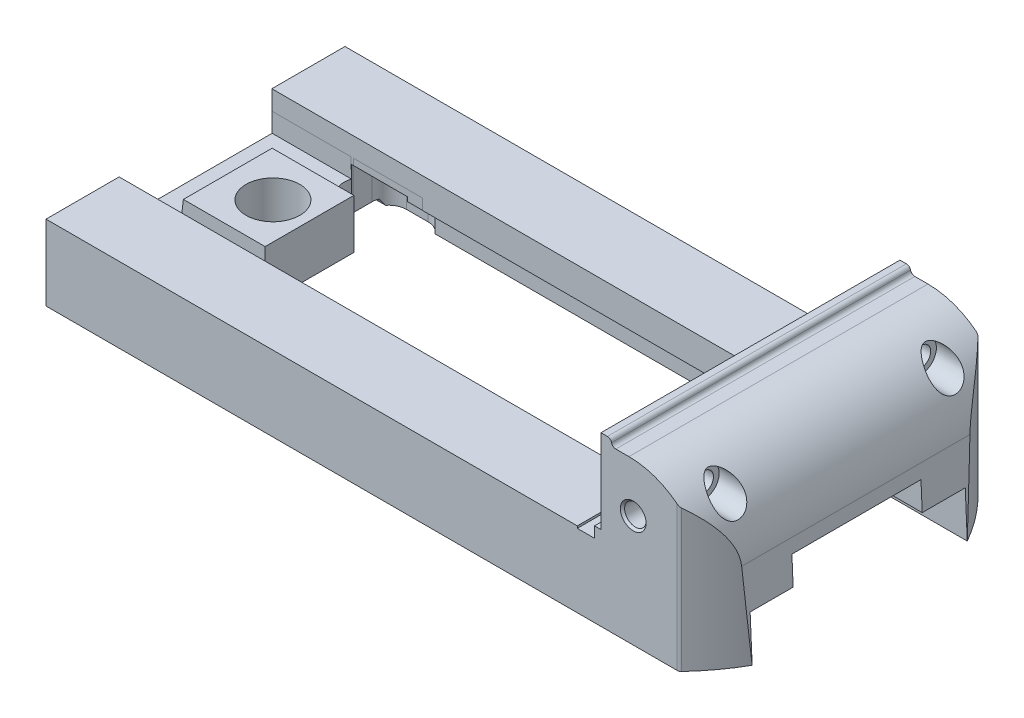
ISO-10303-21;
HEADER;
FILE_DESCRIPTION(('STEP AP214'),'2;1');
FILE_NAME('part.step','',(''),(''),'','','');
FILE_SCHEMA(('AUTOMOTIVE_DESIGN { 1 0 10303 214 1 1 1 1 }'));
ENDSEC;
DATA;
#1=APPLICATION_CONTEXT('core data for automotive mechanical design processes');
#2=APPLICATION_PROTOCOL_DEFINITION('international standard','automotive_design',2000,#1);
#3=PRODUCT_CONTEXT('',#1,'mechanical');
#4=PRODUCT('Part','Part','',(#3));
#5=PRODUCT_RELATED_PRODUCT_CATEGORY('part','',(#4));
#6=PRODUCT_DEFINITION_FORMATION('','',#4);
#7=PRODUCT_DEFINITION_CONTEXT('part definition',#1,'design');
#8=PRODUCT_DEFINITION('design','',#6,#7);
#9=PRODUCT_DEFINITION_SHAPE('','',#8);
#10=(LENGTH_UNIT() NAMED_UNIT(*) SI_UNIT(.MILLI.,.METRE.));
#11=(NAMED_UNIT(*) PLANE_ANGLE_UNIT() SI_UNIT($,.RADIAN.));
#12=(NAMED_UNIT(*) SI_UNIT($,.STERADIAN.) SOLID_ANGLE_UNIT());
#13=UNCERTAINTY_MEASURE_WITH_UNIT(LENGTH_MEASURE(1.E-05),#10,'distance_accuracy_value','');
#14=(GEOMETRIC_REPRESENTATION_CONTEXT(3) GLOBAL_UNCERTAINTY_ASSIGNED_CONTEXT((#13)) GLOBAL_UNIT_ASSIGNED_CONTEXT((#10,
#11,#12)) REPRESENTATION_CONTEXT('',''));
#15=CARTESIAN_POINT('',(0.,0.,0.));
#16=DIRECTION('',(0.,0.,1.));
#17=DIRECTION('',(1.,0.,0.));
#18=AXIS2_PLACEMENT_3D('',#15,#16,#17);
#19=CARTESIAN_POINT('',(247.,34.,-100.));
#20=DIRECTION('',(0.,1.,0.));
#21=DIRECTION('',(0.,0.,1.));
#22=AXIS2_PLACEMENT_3D('',#19,#20,#21);
#23=PLANE('',#22);
#24=DIRECTION('',(1.,0.,0.));
#25=VECTOR('',#24,1.);
#26=CARTESIAN_POINT('',(63.,34.,30.));
#27=LINE('',#26,#25);
#28=CARTESIAN_POINT('',(297.641016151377,33.9999999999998,30.));
#29=VERTEX_POINT('',#28);
#30=CARTESIAN_POINT('',(307.2685,34.,30.));
#31=VERTEX_POINT('',#30);
#32=EDGE_CURVE('E1458',#29,#31,#27,.T.);
#33=ORIENTED_EDGE('',*,*,#32,.F.);
#34=DIRECTION('',(0.,0.,1.));
#35=VECTOR('',#34,1.);
#36=CARTESIAN_POINT('',(297.641016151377,33.9999999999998,-50.));
#37=LINE('',#36,#35);
#38=CARTESIAN_POINT('',(297.641016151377,33.9999999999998,-30.));
#39=VERTEX_POINT('',#38);
#40=EDGE_CURVE('E991',#39,#29,#37,.T.);
#41=ORIENTED_EDGE('',*,*,#40,.F.);
#42=DIRECTION('',(1.,0.,0.));
#43=VECTOR('',#42,1.);
#44=CARTESIAN_POINT('',(63.,34.,-30.));
#45=LINE('',#44,#43);
#46=CARTESIAN_POINT('',(307.2685,34.,-30.));
#47=VERTEX_POINT('',#46);
#48=EDGE_CURVE('E1489',#39,#47,#45,.T.);
#49=ORIENTED_EDGE('',*,*,#48,.T.);
#50=DIRECTION('',(0.,0.,1.));
#51=VECTOR('',#50,1.);
#52=CARTESIAN_POINT('',(307.2685,34.,-100.));
#53=LINE('',#52,#51);
#54=EDGE_CURVE('E1462',#47,#31,#53,.T.);
#55=ORIENTED_EDGE('',*,*,#54,.T.);
#56=EDGE_LOOP('',(#33,#41,#49,#55));
#57=FACE_BOUND('',#56,.T.);
#58=ADVANCED_FACE('F348',(#57),#23,.F.);
#59=CARTESIAN_POINT('',(273.,52.,69.5000000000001));
#60=DIRECTION('',(0.,0.,1.));
#61=DIRECTION('',(1.,0.,0.));
#62=AXIS2_PLACEMENT_3D('',#59,#60,#61);
#63=CYLINDRICAL_SURFACE('',#62,4.99999999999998);
#64=CARTESIAN_POINT('',(273.,52.,68.5));
#65=DIRECTION('',(0.,0.,-1.));
#66=DIRECTION('',(-1.,0.,0.));
#67=AXIS2_PLACEMENT_3D('',#64,#65,#66);
#68=CIRCLE('',#67,4.99999999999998);
#69=CARTESIAN_POINT('',(268.,52.,68.5));
#70=VERTEX_POINT('',#69);
#71=EDGE_CURVE('E361',#70,#70,#68,.F.);
#72=ORIENTED_EDGE('',*,*,#71,.T.);
#73=EDGE_LOOP('',(#72));
#74=FACE_BOUND('',#73,.T.);
#75=CARTESIAN_POINT('',(273.,52.,50.));
#76=DIRECTION('',(0.,0.,-1.));
#77=DIRECTION('',(-1.,0.,0.));
#78=AXIS2_PLACEMENT_3D('',#75,#76,#77);
#79=CIRCLE('',#78,4.99999999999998);
#80=CARTESIAN_POINT('',(268.,52.,50.));
#81=VERTEX_POINT('',#80);
#82=EDGE_CURVE('E981',#81,#81,#79,.F.);
#83=ORIENTED_EDGE('',*,*,#82,.F.);
#84=EDGE_LOOP('',(#83));
#85=FACE_BOUND('',#84,.T.);
#86=ADVANCED_FACE('F1445',(#74,#85),#63,.F.);
#87=CARTESIAN_POINT('',(46.4175963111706,73.,32.6498586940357));
#88=DIRECTION('',(0.,-1.,0.));
#89=DIRECTION('',(0.,0.,-1.));
#90=AXIS2_PLACEMENT_3D('',#87,#88,#89);
#91=CYLINDRICAL_SURFACE('',#90,10.0161854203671);
#92=CARTESIAN_POINT('',(46.4175963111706,23.,32.6498586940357));
#93=DIRECTION('',(0.,1.,0.));
#94=DIRECTION('',(0.,0.,1.));
#95=AXIS2_PLACEMENT_3D('',#92,#93,#94);
#96=CIRCLE('',#95,10.0161854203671);
#97=CARTESIAN_POINT('',(37.0044511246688,23.,36.0728205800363));
#98=VERTEX_POINT('',#97);
#99=CARTESIAN_POINT('',(36.8281273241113,23.,35.5422720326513));
#100=VERTEX_POINT('',#99);
#101=EDGE_CURVE('E1023',#98,#100,#96,.F.);
#102=ORIENTED_EDGE('',*,*,#101,.F.);
#103=DIRECTION('',(0.,-1.,0.));
#104=VECTOR('',#103,1.);
#105=CARTESIAN_POINT('',(37.0044511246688,73.,36.0728205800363));
#106=LINE('',#105,#104);
#107=CARTESIAN_POINT('',(37.0044511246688,2.99999999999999,36.0728205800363));
#108=VERTEX_POINT('',#107);
#109=EDGE_CURVE('E1093',#98,#108,#106,.T.);
#110=ORIENTED_EDGE('',*,*,#109,.T.);
#111=CARTESIAN_POINT('',(46.4175963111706,2.99999999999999,32.6498586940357));
#112=DIRECTION('',(0.,-1.,0.));
#113=DIRECTION('',(0.,0.,-1.));
#114=AXIS2_PLACEMENT_3D('',#111,#112,#113);
#115=CIRCLE('',#114,10.0161854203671);
#116=CARTESIAN_POINT('',(46.4175963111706,2.99999999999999,22.6336732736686));
#117=VERTEX_POINT('',#116);
#118=EDGE_CURVE('E1084',#108,#117,#115,.T.);
#119=ORIENTED_EDGE('',*,*,#118,.T.);
#120=DIRECTION('',(0.,-1.,0.));
#121=VECTOR('',#120,1.);
#122=CARTESIAN_POINT('',(46.4175963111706,73.,22.6336732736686));
#123=LINE('',#122,#121);
#124=CARTESIAN_POINT('',(46.4175963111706,17.0008933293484,22.6336732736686));
#125=VERTEX_POINT('',#124);
#126=EDGE_CURVE('E1092',#125,#117,#123,.T.);
#127=ORIENTED_EDGE('',*,*,#126,.F.);
#128=CARTESIAN_POINT('',(46.4175963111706,17.0008933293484,32.6498586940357));
#129=DIRECTION('',(0.,-1.,0.));
#130=DIRECTION('',(0.,0.,-1.));
#131=AXIS2_PLACEMENT_3D('',#128,#129,#130);
#132=CIRCLE('',#131,10.0161854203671);
#133=CARTESIAN_POINT('',(36.8540316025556,17.0008933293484,35.6268035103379));
#134=VERTEX_POINT('',#133);
#135=EDGE_CURVE('E1102',#134,#125,#132,.T.);
#136=ORIENTED_EDGE('',*,*,#135,.F.);
#137=CARTESIAN_POINT('',(46.4175963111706,228.271416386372,32.6498586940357));
#138=DIRECTION('',(0.,0.0140892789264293,0.99990074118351));
#139=DIRECTION('',(0.,-0.99990074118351,0.0140892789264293));
#140=AXIS2_PLACEMENT_3D('',#137,#138,#139);
#141=ELLIPSE('',#140,710.908306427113,10.0161854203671);
#142=EDGE_CURVE('E1584',#100,#134,#141,.T.);
#143=ORIENTED_EDGE('',*,*,#142,.F.);
#144=EDGE_LOOP('',(#102,#110,#119,#127,#136,#143));
#145=FACE_BOUND('',#144,.T.);
#146=ADVANCED_FACE('F1451',(#145),#91,.F.);
#147=CARTESIAN_POINT('',(51.2986031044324,73.,60.3553073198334));
#148=DIRECTION('',(0.,-1.,0.));
#149=DIRECTION('',(0.,0.,-1.));
#150=AXIS2_PLACEMENT_3D('',#147,#148,#149);
#151=CYLINDRICAL_SURFACE('',#150,28.1773303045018);
#152=CARTESIAN_POINT('',(51.2986031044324,23.,60.3553073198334));
#153=DIRECTION('',(0.,1.,0.));
#154=DIRECTION('',(0.,0.,1.));
#155=AXIS2_PLACEMENT_3D('',#152,#153,#154);
#156=CIRCLE('',#155,28.1773303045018);
#157=CARTESIAN_POINT('',(37.0174203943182,23.,36.0651907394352));
#158=VERTEX_POINT('',#157);
#159=EDGE_CURVE('E1595',#158,#98,#156,.T.);
#160=ORIENTED_EDGE('',*,*,#159,.F.);
#161=DIRECTION('',(0.,-1.,0.));
#162=VECTOR('',#161,1.);
#163=CARTESIAN_POINT('',(37.0174203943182,38.,36.0651907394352));
#164=LINE('',#163,#162);
#165=CARTESIAN_POINT('',(37.0174203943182,2.99999999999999,36.0651907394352));
#166=VERTEX_POINT('',#165);
#167=EDGE_CURVE('E1099',#166,#158,#164,.F.);
#168=ORIENTED_EDGE('',*,*,#167,.F.);
#169=CARTESIAN_POINT('',(51.2986031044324,2.99999999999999,60.3553073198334));
#170=DIRECTION('',(0.,1.,0.));
#171=DIRECTION('',(0.,0.,1.));
#172=AXIS2_PLACEMENT_3D('',#169,#170,#171);
#173=CIRCLE('',#172,28.1773303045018);
#174=EDGE_CURVE('E1089',#166,#108,#173,.T.);
#175=ORIENTED_EDGE('',*,*,#174,.T.);
#176=ORIENTED_EDGE('',*,*,#109,.F.);
#177=EDGE_LOOP('',(#160,#168,#175,#176));
#178=FACE_BOUND('',#177,.T.);
#179=ADVANCED_FACE('F1746',(#178),#151,.T.);
#180=CARTESIAN_POINT('',(46.4175963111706,73.,-32.6498586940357));
#181=DIRECTION('',(0.,-1.,0.));
#182=DIRECTION('',(0.,0.,-1.));
#183=AXIS2_PLACEMENT_3D('',#180,#181,#182);
#184=CYLINDRICAL_SURFACE('',#183,10.0161854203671);
#185=CARTESIAN_POINT('',(46.4175963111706,23.,-32.6498586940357));
#186=DIRECTION('',(0.,1.,0.));
#187=DIRECTION('',(0.,0.,1.));
#188=AXIS2_PLACEMENT_3D('',#185,#186,#187);
#189=CIRCLE('',#188,10.0161854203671);
#190=CARTESIAN_POINT('',(36.8281273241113,23.,-35.5422720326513));
#191=VERTEX_POINT('',#190);
#192=CARTESIAN_POINT('',(36.8647226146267,23.,-35.6609340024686));
#193=VERTEX_POINT('',#192);
#194=EDGE_CURVE('E1592',#191,#193,#189,.F.);
#195=ORIENTED_EDGE('',*,*,#194,.F.);
#196=CARTESIAN_POINT('',(46.4175963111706,228.271416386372,-32.6498586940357));
#197=DIRECTION('',(0.,0.0140892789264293,-0.99990074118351));
#198=DIRECTION('',(0.,-0.99990074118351,-0.0140892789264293));
#199=AXIS2_PLACEMENT_3D('',#196,#197,#198);
#200=ELLIPSE('',#199,710.908306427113,10.0161854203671);
#201=CARTESIAN_POINT('',(36.8540316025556,17.0008933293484,-35.6268035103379));
#202=VERTEX_POINT('',#201);
#203=EDGE_CURVE('E1078',#202,#191,#200,.T.);
#204=ORIENTED_EDGE('',*,*,#203,.F.);
#205=CARTESIAN_POINT('',(46.4175963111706,17.0008933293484,-32.6498586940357));
#206=DIRECTION('',(0.,-1.,0.));
#207=DIRECTION('',(0.,0.,-1.));
#208=AXIS2_PLACEMENT_3D('',#205,#206,#207);
#209=CIRCLE('',#208,10.0161854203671);
#210=CARTESIAN_POINT('',(46.4175963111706,17.0008933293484,-22.6336732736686));
#211=VERTEX_POINT('',#210);
#212=EDGE_CURVE('E1589',#211,#202,#209,.T.);
#213=ORIENTED_EDGE('',*,*,#212,.F.);
#214=DIRECTION('',(0.,-1.,0.));
#215=VECTOR('',#214,1.);
#216=CARTESIAN_POINT('',(46.4175963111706,73.,-22.6336732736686));
#217=LINE('',#216,#215);
#218=CARTESIAN_POINT('',(46.4175963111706,2.99999999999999,-22.6336732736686));
#219=VERTEX_POINT('',#218);
#220=EDGE_CURVE('E1073',#211,#219,#217,.T.);
#221=ORIENTED_EDGE('',*,*,#220,.T.);
#222=CARTESIAN_POINT('',(46.4175963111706,2.99999999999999,-32.6498586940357));
#223=DIRECTION('',(0.,-1.,0.));
#224=DIRECTION('',(0.,0.,1.));
#225=AXIS2_PLACEMENT_3D('',#222,#223,#224);
#226=CIRCLE('',#225,10.0161854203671);
#227=CARTESIAN_POINT('',(36.8647226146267,2.99999999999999,-35.6609340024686));
#228=VERTEX_POINT('',#227);
#229=EDGE_CURVE('E1071',#219,#228,#226,.T.);
#230=ORIENTED_EDGE('',*,*,#229,.T.);
#231=DIRECTION('',(0.,-1.,0.));
#232=VECTOR('',#231,1.);
#233=CARTESIAN_POINT('',(36.8647226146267,38.,-35.6609340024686));
#234=LINE('',#233,#232);
#235=EDGE_CURVE('E1081',#193,#228,#234,.T.);
#236=ORIENTED_EDGE('',*,*,#235,.F.);
#237=EDGE_LOOP('',(#195,#204,#213,#221,#230,#236));
#238=FACE_BOUND('',#237,.T.);
#239=ADVANCED_FACE('F1743',(#238),#184,.F.);
#240=CARTESIAN_POINT('',(70.,26.,-35.5000000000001));
#241=DIRECTION('',(0.,0.0140892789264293,-0.99990074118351));
#242=DIRECTION('',(0.,0.99990074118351,0.0140892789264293));
#243=AXIS2_PLACEMENT_3D('',#240,#241,#242);
#244=PLANE('',#243);
#245=DIRECTION('',(-1.,0.,0.));
#246=VECTOR('',#245,1.);
#247=CARTESIAN_POINT('',(70.,26.,-35.5000000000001));
#248=LINE('',#247,#246);
#249=CARTESIAN_POINT('',(70.,26.,-35.5000000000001));
#250=VERTEX_POINT('',#249);
#251=CARTESIAN_POINT('',(38.0254858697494,26.,-35.5000000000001));
#252=VERTEX_POINT('',#251);
#253=EDGE_CURVE('E1553',#250,#252,#248,.T.);
#254=ORIENTED_EDGE('',*,*,#253,.T.);
#255=DIRECTION('',(0.,-0.99990074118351,-0.0140892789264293));
#256=VECTOR('',#255,1.);
#257=CARTESIAN_POINT('',(38.0254858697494,26.,-35.5000000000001));
#258=LINE('',#257,#256);
#259=CARTESIAN_POINT('',(38.0254858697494,23.,-35.5422720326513));
#260=VERTEX_POINT('',#259);
#261=EDGE_CURVE('E1054',#252,#260,#258,.T.);
#262=ORIENTED_EDGE('',*,*,#261,.T.);
#263=DIRECTION('',(-1.,0.,0.));
#264=VECTOR('',#263,1.);
#265=CARTESIAN_POINT('',(55.,23.,-35.5422720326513));
#266=LINE('',#265,#264);
#267=CARTESIAN_POINT('',(63.,23.,-35.5422720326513));
#268=VERTEX_POINT('',#267);
#269=EDGE_CURVE('E1549',#268,#260,#266,.T.);
#270=ORIENTED_EDGE('',*,*,#269,.F.);
#271=DIRECTION('',(0.,0.99990074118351,0.0140892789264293));
#272=VECTOR('',#271,1.);
#273=CARTESIAN_POINT('',(63.,22.8639611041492,-35.544188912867));
#274=LINE('',#273,#272);
#275=CARTESIAN_POINT('',(63.,21.,-35.5704533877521));
#276=VERTEX_POINT('',#275);
#277=EDGE_CURVE('E1544',#276,#268,#274,.T.);
#278=ORIENTED_EDGE('',*,*,#277,.F.);
#279=DIRECTION('',(-1.,0.,0.));
#280=VECTOR('',#279,1.);
#281=CARTESIAN_POINT('',(63.,21.,-35.5704533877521));
#282=LINE('',#281,#280);
#283=CARTESIAN_POINT('',(70.,21.,-35.5704533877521));
#284=VERTEX_POINT('',#283);
#285=EDGE_CURVE('E1532',#284,#276,#282,.T.);
#286=ORIENTED_EDGE('',*,*,#285,.F.);
#287=DIRECTION('',(0.,-0.99990074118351,-0.0140892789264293));
#288=VECTOR('',#287,1.);
#289=CARTESIAN_POINT('',(70.,26.,-35.5000000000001));
#290=LINE('',#289,#288);
#291=EDGE_CURVE('E1124',#250,#284,#290,.T.);
#292=ORIENTED_EDGE('',*,*,#291,.F.);
#293=EDGE_LOOP('',(#254,#262,#270,#278,#286,#292));
#294=FACE_BOUND('',#293,.T.);
#295=ADVANCED_FACE('F1412',(#294),#244,.F.);
#296=CARTESIAN_POINT('',(70.,26.,35.5000000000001));
#297=DIRECTION('',(0.,0.0140892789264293,0.99990074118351));
#298=DIRECTION('',(0.,-0.99990074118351,0.0140892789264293));
#299=AXIS2_PLACEMENT_3D('',#296,#297,#298);
#300=PLANE('',#299);
#301=DIRECTION('',(1.,0.,0.));
#302=VECTOR('',#301,1.);
#303=CARTESIAN_POINT('',(247.,26.,35.5000000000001));
#304=LINE('',#303,#302);
#305=CARTESIAN_POINT('',(0.,26.,35.5000000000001));
#306=VERTEX_POINT('',#305);
#307=CARTESIAN_POINT('',(36.8154785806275,26.,35.5000000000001));
#308=VERTEX_POINT('',#307);
#309=EDGE_CURVE('E1830',#306,#308,#304,.T.);
#310=ORIENTED_EDGE('',*,*,#309,.T.);
#311=DIRECTION('',(0.000192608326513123,-0.999900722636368,0.0140892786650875));
#312=VECTOR('',#311,1.);
#313=CARTESIAN_POINT('',(36.8154798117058,25.993609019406,35.5000900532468));
#314=LINE('',#313,#312);
#315=CARTESIAN_POINT('',(36.8160564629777,23.,35.5422720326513));
#316=VERTEX_POINT('',#315);
#317=EDGE_CURVE('E1033',#308,#316,#314,.T.);
#318=ORIENTED_EDGE('',*,*,#317,.T.);
#319=DIRECTION('',(-1.,0.,0.));
#320=VECTOR('',#319,1.);
#321=CARTESIAN_POINT('',(70.,23.,35.5422720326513));
#322=LINE('',#321,#320);
#323=EDGE_CURVE('E1028',#100,#316,#322,.T.);
#324=ORIENTED_EDGE('',*,*,#323,.F.);
#325=ORIENTED_EDGE('',*,*,#142,.T.);
#326=DIRECTION('',(-1.,0.,0.));
#327=VECTOR('',#326,1.);
#328=CARTESIAN_POINT('',(70.,17.0008933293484,35.6268035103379));
#329=LINE('',#328,#327);
#330=CARTESIAN_POINT('',(0.,17.0008933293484,35.6268035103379));
#331=VERTEX_POINT('',#330);
#332=EDGE_CURVE('E1839',#134,#331,#329,.T.);
#333=ORIENTED_EDGE('',*,*,#332,.T.);
#334=DIRECTION('',(0.,0.99990074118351,-0.0140892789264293));
#335=VECTOR('',#334,1.);
#336=CARTESIAN_POINT('',(0.,26.,35.5000000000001));
#337=LINE('',#336,#335);
#338=EDGE_CURVE('E1838',#331,#306,#337,.T.);
#339=ORIENTED_EDGE('',*,*,#338,.T.);
#340=EDGE_LOOP('',(#310,#318,#324,#325,#333,#339));
#341=FACE_BOUND('',#340,.T.);
#342=ADVANCED_FACE('F1399',(#341),#300,.F.);
#343=CARTESIAN_POINT('',(63.,21.,-50.));
#344=DIRECTION('',(0.,1.,0.));
#345=DIRECTION('',(0.,0.,1.));
#346=AXIS2_PLACEMENT_3D('',#343,#344,#345);
#347=PLANE('',#346);
#348=CARTESIAN_POINT('',(250.,21.,-34.5));
#349=DIRECTION('',(0.,1.,0.));
#350=DIRECTION('',(0.,0.,1.));
#351=AXIS2_PLACEMENT_3D('',#348,#349,#350);
#352=CIRCLE('',#351,7.00000000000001);
#353=CARTESIAN_POINT('',(243.071796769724,21.,-35.5000000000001));
#354=VERTEX_POINT('',#353);
#355=CARTESIAN_POINT('',(256.819173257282,21.0000000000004,-32.9192166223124));
#356=VERTEX_POINT('',#355);
#357=EDGE_CURVE('E1135',#354,#356,#352,.F.);
#358=ORIENTED_EDGE('',*,*,#357,.F.);
#359=DIRECTION('',(-1.,0.,0.));
#360=VECTOR('',#359,1.);
#361=CARTESIAN_POINT('',(63.,21.,-35.5000000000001));
#362=LINE('',#361,#360);
#363=CARTESIAN_POINT('',(70.,21.,-35.5000000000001));
#364=VERTEX_POINT('',#363);
#365=EDGE_CURVE('E1117',#354,#364,#362,.T.);
#366=ORIENTED_EDGE('',*,*,#365,.T.);
#367=DIRECTION('',(0.,0.,-1.));
#368=VECTOR('',#367,1.);
#369=CARTESIAN_POINT('',(70.,21.,-50.));
#370=LINE('',#369,#368);
#371=EDGE_CURVE('E1537',#364,#284,#370,.T.);
#372=ORIENTED_EDGE('',*,*,#371,.T.);
#373=ORIENTED_EDGE('',*,*,#285,.T.);
#374=DIRECTION('',(0.,0.,1.));
#375=VECTOR('',#374,1.);
#376=CARTESIAN_POINT('',(63.,21.,-50.));
#377=LINE('',#376,#375);
#378=CARTESIAN_POINT('',(63.,21.,-50.));
#379=VERTEX_POINT('',#378);
#380=EDGE_CURVE('E1548',#379,#276,#377,.T.);
#381=ORIENTED_EDGE('',*,*,#380,.F.);
#382=DIRECTION('',(1.,0.,0.));
#383=VECTOR('',#382,1.);
#384=CARTESIAN_POINT('',(63.,21.,-50.));
#385=LINE('',#384,#383);
#386=CARTESIAN_POINT('',(307.85025,21.,-50.));
#387=VERTEX_POINT('',#386);
#388=EDGE_CURVE('E1528',#379,#387,#385,.T.);
#389=ORIENTED_EDGE('',*,*,#388,.T.);
#390=DIRECTION('',(0.,0.,1.));
#391=VECTOR('',#390,1.);
#392=CARTESIAN_POINT('',(307.85025,21.0000000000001,-100.));
#393=LINE('',#392,#391);
#394=CARTESIAN_POINT('',(307.85025,21.,-30.));
#395=VERTEX_POINT('',#394);
#396=EDGE_CURVE('E1525',#387,#395,#393,.T.);
#397=ORIENTED_EDGE('',*,*,#396,.T.);
#398=DIRECTION('',(1.,0.,0.));
#399=VECTOR('',#398,1.);
#400=CARTESIAN_POINT('',(63.,21.,-30.));
#401=LINE('',#400,#399);
#402=CARTESIAN_POINT('',(256.819173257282,21.0000000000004,-30.));
#403=VERTEX_POINT('',#402);
#404=EDGE_CURVE('E1150',#403,#395,#401,.T.);
#405=ORIENTED_EDGE('',*,*,#404,.F.);
#406=DIRECTION('',(0.,0.,1.));
#407=VECTOR('',#406,1.);
#408=CARTESIAN_POINT('',(256.819173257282,21.0000000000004,32.9192166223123));
#409=LINE('',#408,#407);
#410=EDGE_CURVE('E1530',#356,#403,#409,.T.);
#411=ORIENTED_EDGE('',*,*,#410,.F.);
#412=EDGE_LOOP('',(#358,#366,#372,#373,#381,#389,#397,#405,#411));
#413=FACE_BOUND('',#412,.T.);
#414=ADVANCED_FACE('F1424',(#413),#347,.F.);
#415=CARTESIAN_POINT('',(247.,26.,35.5000000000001));
#416=DIRECTION('',(0.,-1.,0.));
#417=DIRECTION('',(0.,0.,-1.));
#418=AXIS2_PLACEMENT_3D('',#415,#416,#417);
#419=PLANE('',#418);
#420=CARTESIAN_POINT('',(36.,26.,0.));
#421=DIRECTION('',(0.,1.,0.));
#422=DIRECTION('',(0.,0.,1.));
#423=AXIS2_PLACEMENT_3D('',#420,#421,#422);
#424=CIRCLE('',#423,12.5);
#425=CARTESIAN_POINT('',(36.,26.,12.5));
#426=VERTEX_POINT('',#425);
#427=EDGE_CURVE('E1007',#426,#426,#424,.T.);
#428=ORIENTED_EDGE('',*,*,#427,.F.);
#429=EDGE_LOOP('',(#428));
#430=FACE_BOUND('',#429,.T.);
#431=DIRECTION('',(-1.,0.,0.));
#432=VECTOR('',#431,1.);
#433=CARTESIAN_POINT('',(70.,26.,-20.6268035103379));
#434=LINE('',#433,#432);
#435=CARTESIAN_POINT('',(53.,26.,-20.6268035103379));
#436=VERTEX_POINT('',#435);
#437=CARTESIAN_POINT('',(15.,26.,-20.6268035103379));
#438=VERTEX_POINT('',#437);
#439=EDGE_CURVE('E1132',#436,#438,#434,.T.);
#440=ORIENTED_EDGE('',*,*,#439,.T.);
#441=DIRECTION('',(0.,0.,1.));
#442=VECTOR('',#441,1.);
#443=CARTESIAN_POINT('',(15.,26.,35.5000000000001));
#444=LINE('',#443,#442);
#445=CARTESIAN_POINT('',(15.0000000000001,26.,20.6268035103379));
#446=VERTEX_POINT('',#445);
#447=EDGE_CURVE('E377',#438,#446,#444,.T.);
#448=ORIENTED_EDGE('',*,*,#447,.T.);
#449=DIRECTION('',(1.,0.,0.));
#450=VECTOR('',#449,1.);
#451=CARTESIAN_POINT('',(247.,26.,20.6268035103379));
#452=LINE('',#451,#450);
#453=CARTESIAN_POINT('',(53.,26.,20.6268035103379));
#454=VERTEX_POINT('',#453);
#455=EDGE_CURVE('E1129',#446,#454,#452,.T.);
#456=ORIENTED_EDGE('',*,*,#455,.T.);
#457=DIRECTION('',(0.,0.,-1.));
#458=VECTOR('',#457,1.);
#459=CARTESIAN_POINT('',(53.,26.,35.5000000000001));
#460=LINE('',#459,#458);
#461=EDGE_CURVE('E1063',#454,#436,#460,.T.);
#462=ORIENTED_EDGE('',*,*,#461,.T.);
#463=EDGE_LOOP('',(#440,#448,#456,#462));
#464=FACE_BOUND('',#463,.T.);
#465=ADVANCED_FACE('F1427',(#430,#464),#419,.F.);
#466=CARTESIAN_POINT('',(55.,23.,46.5686449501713));
#467=DIRECTION('',(0.,1.,0.));
#468=DIRECTION('',(0.,0.,1.));
#469=AXIS2_PLACEMENT_3D('',#466,#467,#468);
#470=PLANE('',#469);
#471=ORIENTED_EDGE('',*,*,#269,.T.);
#472=DIRECTION('',(0.,0.,-1.));
#473=VECTOR('',#472,1.);
#474=CARTESIAN_POINT('',(38.0254858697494,23.,-35.5000000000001));
#475=LINE('',#474,#473);
#476=CARTESIAN_POINT('',(38.0254858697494,23.,-35.5000000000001));
#477=VERTEX_POINT('',#476);
#478=EDGE_CURVE('E1040',#477,#260,#475,.T.);
#479=ORIENTED_EDGE('',*,*,#478,.F.);
#480=DIRECTION('',(1.,0.,0.));
#481=VECTOR('',#480,1.);
#482=CARTESIAN_POINT('',(36.8154785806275,23.,-35.5000000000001));
#483=LINE('',#482,#481);
#484=CARTESIAN_POINT('',(36.8154785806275,23.,-35.5000000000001));
#485=VERTEX_POINT('',#484);
#486=EDGE_CURVE('E1037',#485,#477,#483,.T.);
#487=ORIENTED_EDGE('',*,*,#486,.F.);
#488=DIRECTION('',(-0.0136692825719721,0.,0.999906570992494));
#489=VECTOR('',#488,1.);
#490=CARTESIAN_POINT('',(36.8281273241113,23.,-36.42525424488));
#491=LINE('',#490,#489);
#492=CARTESIAN_POINT('',(36.8160564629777,23.,-35.5422720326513));
#493=VERTEX_POINT('',#492);
#494=EDGE_CURVE('E1035',#493,#485,#491,.T.);
#495=ORIENTED_EDGE('',*,*,#494,.F.);
#496=DIRECTION('',(1.,0.,0.));
#497=VECTOR('',#496,1.);
#498=CARTESIAN_POINT('',(70.,23.,-35.5422720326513));
#499=LINE('',#498,#497);
#500=EDGE_CURVE('E1047',#493,#191,#499,.T.);
#501=ORIENTED_EDGE('',*,*,#500,.T.);
#502=ORIENTED_EDGE('',*,*,#194,.T.);
#503=CARTESIAN_POINT('',(44.8281273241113,23.,-36.4252542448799));
#504=DIRECTION('',(0.,-1.,0.));
#505=DIRECTION('',(0.,0.,-1.));
#506=AXIS2_PLACEMENT_3D('',#503,#504,#505);
#507=CIRCLE('',#506,8.);
#508=CARTESIAN_POINT('',(36.8281273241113,23.,-36.42525424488));
#509=VERTEX_POINT('',#508);
#510=EDGE_CURVE('E1552',#193,#509,#507,.T.);
#511=ORIENTED_EDGE('',*,*,#510,.T.);
#512=DIRECTION('',(0.,0.,-1.));
#513=VECTOR('',#512,1.);
#514=CARTESIAN_POINT('',(36.8281273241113,23.,-45.1987208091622));
#515=LINE('',#514,#513);
#516=CARTESIAN_POINT('',(36.8281273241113,23.,-45.1987208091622));
#517=VERTEX_POINT('',#516);
#518=EDGE_CURVE('E1911',#509,#517,#515,.T.);
#519=ORIENTED_EDGE('',*,*,#518,.T.);
#520=CARTESIAN_POINT('',(44.8281273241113,23.,-45.1987208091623));
#521=DIRECTION('',(0.,-1.,0.));
#522=DIRECTION('',(0.,0.,-1.));
#523=AXIS2_PLACEMENT_3D('',#520,#521,#522);
#524=CIRCLE('',#523,8.);
#525=CARTESIAN_POINT('',(44.8281273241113,23.,-53.1987208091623));
#526=VERTEX_POINT('',#525);
#527=EDGE_CURVE('E1908',#517,#526,#524,.T.);
#528=ORIENTED_EDGE('',*,*,#527,.T.);
#529=DIRECTION('',(1.,0.,0.));
#530=VECTOR('',#529,1.);
#531=CARTESIAN_POINT('',(54.9999999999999,23.,-53.1987208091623));
#532=LINE('',#531,#530);
#533=CARTESIAN_POINT('',(54.9999999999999,23.,-53.1987208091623));
#534=VERTEX_POINT('',#533);
#535=EDGE_CURVE('E1904',#526,#534,#532,.T.);
#536=ORIENTED_EDGE('',*,*,#535,.T.);
#537=CARTESIAN_POINT('',(55.,23.,-45.1987208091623));
#538=DIRECTION('',(0.,-1.,0.));
#539=DIRECTION('',(0.,0.,-1.));
#540=AXIS2_PLACEMENT_3D('',#537,#538,#539);
#541=CIRCLE('',#540,8.);
#542=CARTESIAN_POINT('',(61.3990404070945,23.,-50.));
#543=VERTEX_POINT('',#542);
#544=EDGE_CURVE('E1907',#534,#543,#541,.T.);
#545=ORIENTED_EDGE('',*,*,#544,.T.);
#546=DIRECTION('',(1.,0.,0.));
#547=VECTOR('',#546,1.);
#548=CARTESIAN_POINT('',(63.,23.,-50.));
#549=LINE('',#548,#547);
#550=CARTESIAN_POINT('',(63.,23.,-50.));
#551=VERTEX_POINT('',#550);
#552=EDGE_CURVE('E1919',#543,#551,#549,.T.);
#553=ORIENTED_EDGE('',*,*,#552,.T.);
#554=DIRECTION('',(0.,0.,1.));
#555=VECTOR('',#554,1.);
#556=CARTESIAN_POINT('',(63.,23.,-45.1987208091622));
#557=LINE('',#556,#555);
#558=EDGE_CURVE('E1131',#551,#268,#557,.T.);
#559=ORIENTED_EDGE('',*,*,#558,.T.);
#560=EDGE_LOOP('',(#471,#479,#487,#495,#501,#502,#511,#519,#528,#536,#545,#553,#559));
#561=FACE_BOUND('',#560,.T.);
#562=ADVANCED_FACE('F1337',(#561),#470,.F.);
#563=CARTESIAN_POINT('',(0.,35.,-100.));
#564=DIRECTION('',(0.,1.,0.));
#565=DIRECTION('',(0.,0.,1.));
#566=AXIS2_PLACEMENT_3D('',#563,#564,#565);
#567=PLANE('',#566);
#568=CARTESIAN_POINT('',(250.,35.,34.5));
#569=DIRECTION('',(0.,1.,0.));
#570=DIRECTION('',(0.,0.,1.));
#571=AXIS2_PLACEMENT_3D('',#568,#569,#570);
#572=CIRCLE('',#571,7.00000000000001);
#573=CARTESIAN_POINT('',(247.,35.,40.8245553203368));
#574=VERTEX_POINT('',#573);
#575=CARTESIAN_POINT('',(243.071796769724,35.,35.5000000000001));
#576=VERTEX_POINT('',#575);
#577=EDGE_CURVE('E1851',#574,#576,#572,.F.);
#578=ORIENTED_EDGE('',*,*,#577,.T.);
#579=DIRECTION('',(1.,0.,0.));
#580=VECTOR('',#579,1.);
#581=CARTESIAN_POINT('',(247.,35.,35.5000000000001));
#582=LINE('',#581,#580);
#583=CARTESIAN_POINT('',(0.,35.,35.5000000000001));
#584=VERTEX_POINT('',#583);
#585=EDGE_CURVE('E1970',#584,#576,#582,.T.);
#586=ORIENTED_EDGE('',*,*,#585,.F.);
#587=DIRECTION('',(0.,0.,1.));
#588=VECTOR('',#587,1.);
#589=CARTESIAN_POINT('',(0.,35.,-100.));
#590=LINE('',#589,#588);
#591=CARTESIAN_POINT('',(0.,35.,69.5000000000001));
#592=VERTEX_POINT('',#591);
#593=EDGE_CURVE('E1235',#584,#592,#590,.T.);
#594=ORIENTED_EDGE('',*,*,#593,.T.);
#595=DIRECTION('',(-1.,0.,0.));
#596=VECTOR('',#595,1.);
#597=CARTESIAN_POINT('',(0.,35.,69.5000000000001));
#598=LINE('',#597,#596);
#599=CARTESIAN_POINT('',(247.,35.,69.5000000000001));
#600=VERTEX_POINT('',#599);
#601=EDGE_CURVE('E1259',#600,#592,#598,.T.);
#602=ORIENTED_EDGE('',*,*,#601,.F.);
#603=DIRECTION('',(0.,0.,1.));
#604=VECTOR('',#603,1.);
#605=CARTESIAN_POINT('',(247.,35.,-100.));
#606=LINE('',#605,#604);
#607=EDGE_CURVE('E1231',#574,#600,#606,.T.);
#608=ORIENTED_EDGE('',*,*,#607,.F.);
#609=EDGE_LOOP('',(#578,#586,#594,#602,#608));
#610=FACE_BOUND('',#609,.T.);
#611=ADVANCED_FACE('F1987',(#610),#567,.T.);
#612=CARTESIAN_POINT('',(247.,35.,-100.));
#613=DIRECTION('',(1.,0.,0.));
#614=DIRECTION('',(0.,0.,-1.));
#615=AXIS2_PLACEMENT_3D('',#612,#613,#614);
#616=PLANE('',#615);
#617=DIRECTION('',(0.,0.,1.));
#618=VECTOR('',#617,1.);
#619=CARTESIAN_POINT('',(247.,34.,-100.));
#620=LINE('',#619,#618);
#621=CARTESIAN_POINT('',(247.,34.,40.8245553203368));
#622=VERTEX_POINT('',#621);
#623=CARTESIAN_POINT('',(247.,34.,69.5000000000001));
#624=VERTEX_POINT('',#623);
#625=EDGE_CURVE('E1221',#622,#624,#620,.T.);
#626=ORIENTED_EDGE('',*,*,#625,.F.);
#627=DIRECTION('',(0.,-1.,0.));
#628=VECTOR('',#627,1.);
#629=CARTESIAN_POINT('',(247.,43.,40.8245553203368));
#630=LINE('',#629,#628);
#631=EDGE_CURVE('E1977',#622,#574,#630,.F.);
#632=ORIENTED_EDGE('',*,*,#631,.T.);
#633=ORIENTED_EDGE('',*,*,#607,.T.);
#634=DIRECTION('',(0.,1.,0.));
#635=VECTOR('',#634,1.);
#636=CARTESIAN_POINT('',(247.,35.,69.5000000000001));
#637=LINE('',#636,#635);
#638=EDGE_CURVE('E1256',#624,#600,#637,.T.);
#639=ORIENTED_EDGE('',*,*,#638,.F.);
#640=EDGE_LOOP('',(#626,#632,#633,#639));
#641=FACE_BOUND('',#640,.T.);
#642=ADVANCED_FACE('F1388',(#641),#616,.T.);
#643=CARTESIAN_POINT('',(247.,26.,35.5000000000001));
#644=DIRECTION('',(0.,0.,1.));
#645=DIRECTION('',(1.,0.,0.));
#646=AXIS2_PLACEMENT_3D('',#643,#644,#645);
#647=PLANE('',#646);
#648=CARTESIAN_POINT('',(38.0254858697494,26.,35.5000000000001));
#649=VERTEX_POINT('',#648);
#650=CARTESIAN_POINT('',(70.,26.,35.5000000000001));
#651=VERTEX_POINT('',#650);
#652=EDGE_CURVE('E1832',#649,#651,#304,.T.);
#653=ORIENTED_EDGE('',*,*,#652,.F.);
#654=DIRECTION('',(0.,1.,0.));
#655=VECTOR('',#654,1.);
#656=CARTESIAN_POINT('',(38.0254858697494,23.,35.5000000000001));
#657=LINE('',#656,#655);
#658=CARTESIAN_POINT('',(38.0254858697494,23.,35.5000000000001));
#659=VERTEX_POINT('',#658);
#660=EDGE_CURVE('E1019',#659,#649,#657,.T.);
#661=ORIENTED_EDGE('',*,*,#660,.F.);
#662=DIRECTION('',(-1.,0.,0.));
#663=VECTOR('',#662,1.);
#664=CARTESIAN_POINT('',(36.8154785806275,23.,35.5000000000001));
#665=LINE('',#664,#663);
#666=CARTESIAN_POINT('',(36.8154785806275,23.,35.5000000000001));
#667=VERTEX_POINT('',#666);
#668=EDGE_CURVE('E1013',#659,#667,#665,.T.);
#669=ORIENTED_EDGE('',*,*,#668,.T.);
#670=DIRECTION('',(0.,1.,0.));
#671=VECTOR('',#670,1.);
#672=CARTESIAN_POINT('',(36.8154785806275,23.,35.5000000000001));
#673=LINE('',#672,#671);
#674=EDGE_CURVE('E1020',#667,#308,#673,.T.);
#675=ORIENTED_EDGE('',*,*,#674,.T.);
#676=ORIENTED_EDGE('',*,*,#309,.F.);
#677=DIRECTION('',(0.,1.,0.));
#678=VECTOR('',#677,1.);
#679=CARTESIAN_POINT('',(0.,26.,35.5000000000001));
#680=LINE('',#679,#678);
#681=EDGE_CURVE('E1969',#306,#584,#680,.T.);
#682=ORIENTED_EDGE('',*,*,#681,.T.);
#683=ORIENTED_EDGE('',*,*,#585,.T.);
#684=DIRECTION('',(0.,1.,0.));
#685=VECTOR('',#684,1.);
#686=CARTESIAN_POINT('',(243.071796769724,-44.,35.5000000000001));
#687=LINE('',#686,#685);
#688=CARTESIAN_POINT('',(243.071796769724,21.,35.5000000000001));
#689=VERTEX_POINT('',#688);
#690=EDGE_CURVE('E1158',#689,#576,#687,.T.);
#691=ORIENTED_EDGE('',*,*,#690,.F.);
#692=DIRECTION('',(1.,0.,0.));
#693=VECTOR('',#692,1.);
#694=CARTESIAN_POINT('',(63.,21.,35.5000000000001));
#695=LINE('',#694,#693);
#696=CARTESIAN_POINT('',(70.,21.,35.5000000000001));
#697=VERTEX_POINT('',#696);
#698=EDGE_CURVE('E1569',#697,#689,#695,.T.);
#699=ORIENTED_EDGE('',*,*,#698,.F.);
#700=DIRECTION('',(0.,-1.,0.));
#701=VECTOR('',#700,1.);
#702=CARTESIAN_POINT('',(70.,17.0008933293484,35.5000000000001));
#703=LINE('',#702,#701);
#704=EDGE_CURVE('E1118',#651,#697,#703,.T.);
#705=ORIENTED_EDGE('',*,*,#704,.F.);
#706=EDGE_LOOP('',(#653,#661,#669,#675,#676,#682,#683,#691,#699,#705));
#707=FACE_BOUND('',#706,.T.);
#708=ADVANCED_FACE('F1384',(#707),#647,.F.);
#709=CARTESIAN_POINT('',(0.,35.,-69.5000000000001));
#710=VERTEX_POINT('',#709);
#711=CARTESIAN_POINT('',(0.,35.,-35.5000000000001));
#712=VERTEX_POINT('',#711);
#713=EDGE_CURVE('E1230',#710,#712,#590,.T.);
#714=ORIENTED_EDGE('',*,*,#713,.T.);
#715=DIRECTION('',(-1.,0.,0.));
#716=VECTOR('',#715,1.);
#717=CARTESIAN_POINT('',(247.,35.,-35.5000000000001));
#718=LINE('',#717,#716);
#719=CARTESIAN_POINT('',(243.071796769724,35.,-35.5000000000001));
#720=VERTEX_POINT('',#719);
#721=EDGE_CURVE('E1961',#720,#712,#718,.T.);
#722=ORIENTED_EDGE('',*,*,#721,.F.);
#723=CARTESIAN_POINT('',(250.,35.,-34.5));
#724=DIRECTION('',(0.,1.,0.));
#725=DIRECTION('',(0.,0.,1.));
#726=AXIS2_PLACEMENT_3D('',#723,#724,#725);
#727=CIRCLE('',#726,7.00000000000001);
#728=CARTESIAN_POINT('',(247.,35.,-40.8245553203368));
#729=VERTEX_POINT('',#728);
#730=EDGE_CURVE('E1234',#720,#729,#727,.F.);
#731=ORIENTED_EDGE('',*,*,#730,.T.);
#732=CARTESIAN_POINT('',(247.,35.,-69.5));
#733=VERTEX_POINT('',#732);
#734=EDGE_CURVE('E1226',#733,#729,#606,.T.);
#735=ORIENTED_EDGE('',*,*,#734,.F.);
#736=DIRECTION('',(1.,0.,0.));
#737=VECTOR('',#736,1.);
#738=CARTESIAN_POINT('',(0.,35.,-69.5000000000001));
#739=LINE('',#738,#737);
#740=EDGE_CURVE('E2025',#710,#733,#739,.T.);
#741=ORIENTED_EDGE('',*,*,#740,.F.);
#742=EDGE_LOOP('',(#714,#722,#731,#735,#741));
#743=FACE_BOUND('',#742,.T.);
#744=ADVANCED_FACE('F1387',(#743),#567,.T.);
#745=ORIENTED_EDGE('',*,*,#734,.T.);
#746=DIRECTION('',(0.,-1.,0.));
#747=VECTOR('',#746,1.);
#748=CARTESIAN_POINT('',(247.,43.,-40.8245553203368));
#749=LINE('',#748,#747);
#750=CARTESIAN_POINT('',(247.,34.,-40.8245553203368));
#751=VERTEX_POINT('',#750);
#752=EDGE_CURVE('E1229',#729,#751,#749,.T.);
#753=ORIENTED_EDGE('',*,*,#752,.T.);
#754=CARTESIAN_POINT('',(247.,34.,-69.5));
#755=VERTEX_POINT('',#754);
#756=EDGE_CURVE('E1222',#755,#751,#620,.T.);
#757=ORIENTED_EDGE('',*,*,#756,.F.);
#758=DIRECTION('',(0.,-1.,0.));
#759=VECTOR('',#758,1.);
#760=CARTESIAN_POINT('',(247.,35.,-69.5));
#761=LINE('',#760,#759);
#762=EDGE_CURVE('E2023',#733,#755,#761,.T.);
#763=ORIENTED_EDGE('',*,*,#762,.F.);
#764=EDGE_LOOP('',(#745,#753,#757,#763));
#765=FACE_BOUND('',#764,.T.);
#766=ADVANCED_FACE('F1382',(#765),#616,.T.);
#767=CARTESIAN_POINT('',(247.,26.,-35.5000000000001));
#768=DIRECTION('',(0.,0.,-1.));
#769=DIRECTION('',(-1.,0.,0.));
#770=AXIS2_PLACEMENT_3D('',#767,#768,#769);
#771=PLANE('',#770);
#772=CARTESIAN_POINT('',(36.8154785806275,26.,-35.5000000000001));
#773=VERTEX_POINT('',#772);
#774=CARTESIAN_POINT('',(0.,26.,-35.5000000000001));
#775=VERTEX_POINT('',#774);
#776=EDGE_CURVE('E1556',#773,#775,#248,.T.);
#777=ORIENTED_EDGE('',*,*,#776,.F.);
#778=DIRECTION('',(0.,1.,0.));
#779=VECTOR('',#778,1.);
#780=CARTESIAN_POINT('',(36.8154785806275,23.,-35.5000000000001));
#781=LINE('',#780,#779);
#782=EDGE_CURVE('E1043',#485,#773,#781,.T.);
#783=ORIENTED_EDGE('',*,*,#782,.F.);
#784=ORIENTED_EDGE('',*,*,#486,.T.);
#785=DIRECTION('',(0.,1.,0.));
#786=VECTOR('',#785,1.);
#787=CARTESIAN_POINT('',(38.0254858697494,23.,-35.5000000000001));
#788=LINE('',#787,#786);
#789=EDGE_CURVE('E1044',#477,#252,#788,.T.);
#790=ORIENTED_EDGE('',*,*,#789,.T.);
#791=ORIENTED_EDGE('',*,*,#253,.F.);
#792=DIRECTION('',(0.,1.,0.));
#793=VECTOR('',#792,1.);
#794=CARTESIAN_POINT('',(70.,26.,-35.5000000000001));
#795=LINE('',#794,#793);
#796=EDGE_CURVE('E1121',#364,#250,#795,.T.);
#797=ORIENTED_EDGE('',*,*,#796,.F.);
#798=ORIENTED_EDGE('',*,*,#365,.F.);
#799=DIRECTION('',(0.,-1.,0.));
#800=VECTOR('',#799,1.);
#801=CARTESIAN_POINT('',(243.071796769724,0.,-35.5000000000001));
#802=LINE('',#801,#800);
#803=EDGE_CURVE('E1133',#720,#354,#802,.T.);
#804=ORIENTED_EDGE('',*,*,#803,.F.);
#805=ORIENTED_EDGE('',*,*,#721,.T.);
#806=DIRECTION('',(0.,1.,0.));
#807=VECTOR('',#806,1.);
#808=CARTESIAN_POINT('',(0.,26.,-35.5000000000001));
#809=LINE('',#808,#807);
#810=EDGE_CURVE('E1190',#775,#712,#809,.T.);
#811=ORIENTED_EDGE('',*,*,#810,.F.);
#812=EDGE_LOOP('',(#777,#783,#784,#790,#791,#797,#798,#804,#805,#811));
#813=FACE_BOUND('',#812,.T.);
#814=ADVANCED_FACE('F1378',(#813),#771,.F.);
#815=CARTESIAN_POINT('',(0.,0.,-100.));
#816=DIRECTION('',(0.,-1.,0.));
#817=DIRECTION('',(0.,0.,-1.));
#818=AXIS2_PLACEMENT_3D('',#815,#816,#817);
#819=PLANE('',#818);
#820=CARTESIAN_POINT('',(271.,0.,-59.5));
#821=DIRECTION('',(0.,-1.,0.));
#822=DIRECTION('',(0.,0.,-1.));
#823=AXIS2_PLACEMENT_3D('',#820,#821,#822);
#824=CIRCLE('',#823,3.37500000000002);
#825=CARTESIAN_POINT('',(271.,0.,-62.875));
#826=VERTEX_POINT('',#825);
#827=EDGE_CURVE('E902',#826,#826,#824,.T.);
#828=ORIENTED_EDGE('',*,*,#827,.F.);
#829=EDGE_LOOP('',(#828));
#830=FACE_BOUND('',#829,.T.);
#831=CARTESIAN_POINT('',(221.,0.,-59.5));
#832=DIRECTION('',(0.,-1.,0.));
#833=DIRECTION('',(0.,0.,-1.));
#834=AXIS2_PLACEMENT_3D('',#831,#832,#833);
#835=CIRCLE('',#834,3.37499999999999);
#836=CARTESIAN_POINT('',(221.,0.,-62.875));
#837=VERTEX_POINT('',#836);
#838=EDGE_CURVE('E921',#837,#837,#835,.T.);
#839=ORIENTED_EDGE('',*,*,#838,.F.);
#840=EDGE_LOOP('',(#839));
#841=FACE_BOUND('',#840,.T.);
#842=CARTESIAN_POINT('',(171.,0.,-59.5));
#843=DIRECTION('',(0.,-1.,0.));
#844=DIRECTION('',(0.,0.,-1.));
#845=AXIS2_PLACEMENT_3D('',#842,#843,#844);
#846=CIRCLE('',#845,3.37499999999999);
#847=CARTESIAN_POINT('',(171.,0.,-62.875));
#848=VERTEX_POINT('',#847);
#849=EDGE_CURVE('E933',#848,#848,#846,.T.);
#850=ORIENTED_EDGE('',*,*,#849,.F.);
#851=EDGE_LOOP('',(#850));
#852=FACE_BOUND('',#851,.T.);
#853=DIRECTION('',(-1.,0.,0.));
#854=VECTOR('',#853,1.);
#855=CARTESIAN_POINT('',(63.,0.,-50.));
#856=LINE('',#855,#854);
#857=CARTESIAN_POINT('',(38.4290869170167,0.,-50.));
#858=VERTEX_POINT('',#857);
#859=CARTESIAN_POINT('',(0.,0.,-50.));
#860=VERTEX_POINT('',#859);
#861=EDGE_CURVE('E1225',#858,#860,#856,.T.);
#862=ORIENTED_EDGE('',*,*,#861,.T.);
#863=DIRECTION('',(0.,0.,1.));
#864=VECTOR('',#863,1.);
#865=CARTESIAN_POINT('',(0.,0.,-100.));
#866=LINE('',#865,#864);
#867=CARTESIAN_POINT('',(0.,0.,-69.5000000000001));
#868=VERTEX_POINT('',#867);
#869=EDGE_CURVE('E1186',#868,#860,#866,.T.);
#870=ORIENTED_EDGE('',*,*,#869,.F.);
#871=DIRECTION('',(-1.,0.,0.));
#872=VECTOR('',#871,1.);
#873=CARTESIAN_POINT('',(0.,0.,-69.5000000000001));
#874=LINE('',#873,#872);
#875=CARTESIAN_POINT('',(293.455304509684,0.,-69.5));
#876=VERTEX_POINT('',#875);
#877=EDGE_CURVE('E1182',#876,#868,#874,.T.);
#878=ORIENTED_EDGE('',*,*,#877,.F.);
#879=CARTESIAN_POINT('',(293.455304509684,0.,-67.5));
#880=DIRECTION('',(0.,-1.,0.));
#881=DIRECTION('',(0.,0.,-1.));
#882=AXIS2_PLACEMENT_3D('',#879,#880,#881);
#883=CIRCLE('',#882,2.00000000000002);
#884=CARTESIAN_POINT('',(294.918347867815,0.,-68.8636363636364));
#885=VERTEX_POINT('',#884);
#886=EDGE_CURVE('E1177',#885,#876,#883,.F.);
#887=ORIENTED_EDGE('',*,*,#886,.F.);
#888=CARTESIAN_POINT('',(221.034658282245,0.,0.));
#889=DIRECTION('',(0.,-1.,0.));
#890=DIRECTION('',(0.,0.,-1.));
#891=AXIS2_PLACEMENT_3D('',#888,#889,#890);
#892=CIRCLE('',#891,101.);
#893=CARTESIAN_POINT('',(308.79,0.,-50.));
#894=VERTEX_POINT('',#893);
#895=EDGE_CURVE('E1173',#894,#885,#892,.F.);
#896=ORIENTED_EDGE('',*,*,#895,.F.);
#897=DIRECTION('',(1.,0.,0.));
#898=VECTOR('',#897,1.);
#899=CARTESIAN_POINT('',(63.,0.,-50.));
#900=LINE('',#899,#898);
#901=CARTESIAN_POINT('',(61.3990404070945,0.,-50.));
#902=VERTEX_POINT('',#901);
#903=EDGE_CURVE('E1513',#902,#894,#900,.T.);
#904=ORIENTED_EDGE('',*,*,#903,.F.);
#905=CARTESIAN_POINT('',(55.,0.,-45.1987208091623));
#906=DIRECTION('',(0.,-1.,0.));
#907=DIRECTION('',(0.,0.,-1.));
#908=AXIS2_PLACEMENT_3D('',#905,#906,#907);
#909=CIRCLE('',#908,8.);
#910=CARTESIAN_POINT('',(54.9999999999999,0.,-53.1987208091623));
#911=VERTEX_POINT('',#910);
#912=EDGE_CURVE('E1923',#911,#902,#909,.T.);
#913=ORIENTED_EDGE('',*,*,#912,.F.);
#914=DIRECTION('',(1.,0.,0.));
#915=VECTOR('',#914,1.);
#916=CARTESIAN_POINT('',(54.9999999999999,0.,-53.1987208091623));
#917=LINE('',#916,#915);
#918=CARTESIAN_POINT('',(44.8281273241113,0.,-53.1987208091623));
#919=VERTEX_POINT('',#918);
#920=EDGE_CURVE('E1900',#919,#911,#917,.T.);
#921=ORIENTED_EDGE('',*,*,#920,.F.);
#922=CARTESIAN_POINT('',(44.8281273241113,0.,-45.1987208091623));
#923=DIRECTION('',(0.,-1.,0.));
#924=DIRECTION('',(0.,0.,-1.));
#925=AXIS2_PLACEMENT_3D('',#922,#923,#924);
#926=CIRCLE('',#925,8.);
#927=EDGE_CURVE('E1145',#858,#919,#926,.T.);
#928=ORIENTED_EDGE('',*,*,#927,.F.);
#929=EDGE_LOOP('',(#862,#870,#878,#887,#896,#904,#913,#921,#928));
#930=FACE_BOUND('',#929,.T.);
#931=ADVANCED_FACE('F1381',(#830,#841,#852,#930),#819,.T.);
#932=CARTESIAN_POINT('',(247.,34.,-100.));
#933=DIRECTION('',(0.,1.,0.));
#934=DIRECTION('',(0.,0.,1.));
#935=AXIS2_PLACEMENT_3D('',#932,#933,#934);
#936=PLANE('',#935);
#937=CARTESIAN_POINT('',(250.,34.,-34.5));
#938=DIRECTION('',(0.,1.,0.));
#939=DIRECTION('',(0.,0.,1.));
#940=AXIS2_PLACEMENT_3D('',#937,#938,#939);
#941=CIRCLE('',#940,7.00000000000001);
#942=CARTESIAN_POINT('',(255.,34.,-39.3989794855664));
#943=VERTEX_POINT('',#942);
#944=EDGE_CURVE('E1152',#943,#751,#941,.T.);
#945=ORIENTED_EDGE('',*,*,#944,.F.);
#946=DIRECTION('',(0.,0.,1.));
#947=VECTOR('',#946,1.);
#948=CARTESIAN_POINT('',(255.,34.,-100.));
#949=LINE('',#948,#947);
#950=CARTESIAN_POINT('',(255.,34.,-69.5));
#951=VERTEX_POINT('',#950);
#952=EDGE_CURVE('E1217',#951,#943,#949,.T.);
#953=ORIENTED_EDGE('',*,*,#952,.F.);
#954=DIRECTION('',(1.,0.,0.));
#955=VECTOR('',#954,1.);
#956=CARTESIAN_POINT('',(247.,34.,-69.5));
#957=LINE('',#956,#955);
#958=EDGE_CURVE('E2018',#755,#951,#957,.T.);
#959=ORIENTED_EDGE('',*,*,#958,.F.);
#960=ORIENTED_EDGE('',*,*,#756,.T.);
#961=EDGE_LOOP('',(#945,#953,#959,#960));
#962=FACE_BOUND('',#961,.T.);
#963=ADVANCED_FACE('F1772',(#962),#936,.T.);
#964=CARTESIAN_POINT('',(0.,0.,-100.));
#965=DIRECTION('',(-1.,0.,0.));
#966=DIRECTION('',(0.,0.,1.));
#967=AXIS2_PLACEMENT_3D('',#964,#965,#966);
#968=PLANE('',#967);
#969=DIRECTION('',(0.,0.,1.));
#970=VECTOR('',#969,1.);
#971=CARTESIAN_POINT('',(0.,17.0008933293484,20.6268035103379));
#972=LINE('',#971,#970);
#973=CARTESIAN_POINT('',(0.,17.0008933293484,-35.6268035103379));
#974=VERTEX_POINT('',#973);
#975=EDGE_CURVE('E1840',#974,#331,#972,.T.);
#976=ORIENTED_EDGE('',*,*,#975,.F.);
#977=DIRECTION('',(0.,-0.99990074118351,-0.0140892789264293));
#978=VECTOR('',#977,1.);
#979=CARTESIAN_POINT('',(0.,26.,-35.5000000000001));
#980=LINE('',#979,#978);
#981=EDGE_CURVE('E1555',#775,#974,#980,.T.);
#982=ORIENTED_EDGE('',*,*,#981,.F.);
#983=ORIENTED_EDGE('',*,*,#810,.T.);
#984=ORIENTED_EDGE('',*,*,#713,.F.);
#985=DIRECTION('',(0.,1.,0.));
#986=VECTOR('',#985,1.);
#987=CARTESIAN_POINT('',(0.,0.,-69.5000000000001));
#988=LINE('',#987,#986);
#989=EDGE_CURVE('E1184',#868,#710,#988,.T.);
#990=ORIENTED_EDGE('',*,*,#989,.F.);
#991=ORIENTED_EDGE('',*,*,#869,.T.);
#992=DIRECTION('',(0.,-0.832050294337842,-0.554700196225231));
#993=VECTOR('',#992,1.);
#994=CARTESIAN_POINT('',(0.,2.99999999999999,-48.));
#995=LINE('',#994,#993);
#996=CARTESIAN_POINT('',(0.,2.99999999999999,-48.));
#997=VERTEX_POINT('',#996);
#998=EDGE_CURVE('E1141',#997,#860,#995,.T.);
#999=ORIENTED_EDGE('',*,*,#998,.F.);
#1000=DIRECTION('',(0.,0.,-1.));
#1001=VECTOR('',#1000,1.);
#1002=CARTESIAN_POINT('',(0.,2.99999999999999,-48.));
#1003=LINE('',#1002,#1001);
#1004=CARTESIAN_POINT('',(0.,2.99999999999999,48.));
#1005=VERTEX_POINT('',#1004);
#1006=EDGE_CURVE('E1128',#1005,#997,#1003,.T.);
#1007=ORIENTED_EDGE('',*,*,#1006,.F.);
#1008=DIRECTION('',(0.,0.832050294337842,-0.554700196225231));
#1009=VECTOR('',#1008,1.);
#1010=CARTESIAN_POINT('',(0.,2.99999999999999,48.));
#1011=LINE('',#1010,#1009);
#1012=CARTESIAN_POINT('',(0.,0.,50.));
#1013=VERTEX_POINT('',#1012);
#1014=EDGE_CURVE('E1955',#1013,#1005,#1011,.T.);
#1015=ORIENTED_EDGE('',*,*,#1014,.F.);
#1016=CARTESIAN_POINT('',(0.,0.,69.5000000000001));
#1017=VERTEX_POINT('',#1016);
#1018=EDGE_CURVE('E1189',#1013,#1017,#866,.T.);
#1019=ORIENTED_EDGE('',*,*,#1018,.T.);
#1020=DIRECTION('',(0.,-1.,0.));
#1021=VECTOR('',#1020,1.);
#1022=CARTESIAN_POINT('',(0.,0.,69.5000000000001));
#1023=LINE('',#1022,#1021);
#1024=EDGE_CURVE('E1162',#592,#1017,#1023,.T.);
#1025=ORIENTED_EDGE('',*,*,#1024,.F.);
#1026=ORIENTED_EDGE('',*,*,#593,.F.);
#1027=ORIENTED_EDGE('',*,*,#681,.F.);
#1028=ORIENTED_EDGE('',*,*,#338,.F.);
#1029=EDGE_LOOP('',(#976,#982,#983,#984,#990,#991,#999,#1007,#1015,#1019,#1025,#1026,#1027,#1028));
#1030=FACE_BOUND('',#1029,.T.);
#1031=ADVANCED_FACE('F1768',(#1030),#968,.T.);
#1032=CARTESIAN_POINT('',(250.,34.,34.5));
#1033=DIRECTION('',(0.,1.,0.));
#1034=DIRECTION('',(0.,0.,1.));
#1035=AXIS2_PLACEMENT_3D('',#1032,#1033,#1034);
#1036=CIRCLE('',#1035,7.00000000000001);
#1037=CARTESIAN_POINT('',(255.,34.,39.3989794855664));
#1038=VERTEX_POINT('',#1037);
#1039=EDGE_CURVE('E1156',#622,#1038,#1036,.T.);
#1040=ORIENTED_EDGE('',*,*,#1039,.F.);
#1041=ORIENTED_EDGE('',*,*,#625,.T.);
#1042=DIRECTION('',(-1.,0.,0.));
#1043=VECTOR('',#1042,1.);
#1044=CARTESIAN_POINT('',(247.,34.,69.5000000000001));
#1045=LINE('',#1044,#1043);
#1046=CARTESIAN_POINT('',(255.,34.,69.5000000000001));
#1047=VERTEX_POINT('',#1046);
#1048=EDGE_CURVE('E1253',#1047,#624,#1045,.T.);
#1049=ORIENTED_EDGE('',*,*,#1048,.F.);
#1050=EDGE_CURVE('E1216',#1038,#1047,#949,.T.);
#1051=ORIENTED_EDGE('',*,*,#1050,.F.);
#1052=EDGE_LOOP('',(#1040,#1041,#1049,#1051));
#1053=FACE_BOUND('',#1052,.T.);
#1054=ADVANCED_FACE('F1771',(#1053),#936,.T.);
#1055=CARTESIAN_POINT('',(255.,34.,-100.));
#1056=DIRECTION('',(-1.,0.,0.));
#1057=DIRECTION('',(0.,0.,1.));
#1058=AXIS2_PLACEMENT_3D('',#1055,#1056,#1057);
#1059=PLANE('',#1058);
#1060=DIRECTION('',(0.,-1.,0.));
#1061=VECTOR('',#1060,1.);
#1062=CARTESIAN_POINT('',(255.,34.,69.5000000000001));
#1063=LINE('',#1062,#1061);
#1064=CARTESIAN_POINT('',(255.,39.,69.5000000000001));
#1065=VERTEX_POINT('',#1064);
#1066=EDGE_CURVE('E1250',#1065,#1047,#1063,.T.);
#1067=ORIENTED_EDGE('',*,*,#1066,.F.);
#1068=DIRECTION('',(0.,0.,1.));
#1069=VECTOR('',#1068,1.);
#1070=CARTESIAN_POINT('',(255.,39.,-100.));
#1071=LINE('',#1070,#1069);
#1072=CARTESIAN_POINT('',(255.,39.,-69.5));
#1073=VERTEX_POINT('',#1072);
#1074=EDGE_CURVE('E1213',#1073,#1065,#1071,.T.);
#1075=ORIENTED_EDGE('',*,*,#1074,.F.);
#1076=DIRECTION('',(0.,1.,0.));
#1077=VECTOR('',#1076,1.);
#1078=CARTESIAN_POINT('',(255.,34.,-69.5));
#1079=LINE('',#1078,#1077);
#1080=EDGE_CURVE('E2014',#951,#1073,#1079,.T.);
#1081=ORIENTED_EDGE('',*,*,#1080,.F.);
#1082=ORIENTED_EDGE('',*,*,#952,.T.);
#1083=EDGE_CURVE('E1220',#943,#1038,#949,.T.);
#1084=ORIENTED_EDGE('',*,*,#1083,.T.);
#1085=ORIENTED_EDGE('',*,*,#1050,.T.);
#1086=EDGE_LOOP('',(#1067,#1075,#1081,#1082,#1084,#1085));
#1087=FACE_BOUND('',#1086,.T.);
#1088=ADVANCED_FACE('F2004',(#1087),#1059,.T.);
#1089=CARTESIAN_POINT('',(255.,39.,-100.));
#1090=DIRECTION('',(0.,1.,0.));
#1091=DIRECTION('',(0.,0.,1.));
#1092=AXIS2_PLACEMENT_3D('',#1089,#1090,#1091);
#1093=PLANE('',#1092);
#1094=DIRECTION('',(-1.,0.,0.));
#1095=VECTOR('',#1094,1.);
#1096=CARTESIAN_POINT('',(255.,39.,69.5000000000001));
#1097=LINE('',#1096,#1095);
#1098=CARTESIAN_POINT('',(258.,39.,69.5000000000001));
#1099=VERTEX_POINT('',#1098);
#1100=EDGE_CURVE('E1248',#1099,#1065,#1097,.T.);
#1101=ORIENTED_EDGE('',*,*,#1100,.F.);
#1102=DIRECTION('',(0.,0.,1.));
#1103=VECTOR('',#1102,1.);
#1104=CARTESIAN_POINT('',(258.,39.,-100.));
#1105=LINE('',#1104,#1103);
#1106=CARTESIAN_POINT('',(258.,39.,-69.5));
#1107=VERTEX_POINT('',#1106);
#1108=EDGE_CURVE('E1210',#1107,#1099,#1105,.T.);
#1109=ORIENTED_EDGE('',*,*,#1108,.F.);
#1110=DIRECTION('',(1.,0.,0.));
#1111=VECTOR('',#1110,1.);
#1112=CARTESIAN_POINT('',(255.,39.,-69.5));
#1113=LINE('',#1112,#1111);
#1114=EDGE_CURVE('E2010',#1073,#1107,#1113,.T.);
#1115=ORIENTED_EDGE('',*,*,#1114,.F.);
#1116=ORIENTED_EDGE('',*,*,#1074,.T.);
#1117=EDGE_LOOP('',(#1101,#1109,#1115,#1116));
#1118=FACE_BOUND('',#1117,.T.);
#1119=ADVANCED_FACE('F2008',(#1118),#1093,.T.);
#1120=CARTESIAN_POINT('',(258.,39.,-100.));
#1121=DIRECTION('',(-1.,0.,0.));
#1122=DIRECTION('',(0.,0.,1.));
#1123=AXIS2_PLACEMENT_3D('',#1120,#1121,#1122);
#1124=PLANE('',#1123);
#1125=CARTESIAN_POINT('',(258.,63.,50.5));
#1126=DIRECTION('',(-1.,0.,0.));
#1127=DIRECTION('',(0.,0.,1.));
#1128=AXIS2_PLACEMENT_3D('',#1125,#1126,#1127);
#1129=CIRCLE('',#1128,4.49999999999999);
#1130=CARTESIAN_POINT('',(258.,63.,55.));
#1131=VERTEX_POINT('',#1130);
#1132=EDGE_CURVE('E2385',#1131,#1131,#1129,.T.);
#1133=ORIENTED_EDGE('',*,*,#1132,.F.);
#1134=EDGE_LOOP('',(#1133));
#1135=FACE_BOUND('',#1134,.T.);
#1136=CARTESIAN_POINT('',(258.,63.,-50.5));
#1137=DIRECTION('',(-1.,0.,0.));
#1138=DIRECTION('',(0.,0.,1.));
#1139=AXIS2_PLACEMENT_3D('',#1136,#1137,#1138);
#1140=CIRCLE('',#1139,4.49999999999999);
#1141=CARTESIAN_POINT('',(258.,63.,-46.));
#1142=VERTEX_POINT('',#1141);
#1143=EDGE_CURVE('E909',#1142,#1142,#1140,.T.);
#1144=ORIENTED_EDGE('',*,*,#1143,.F.);
#1145=EDGE_LOOP('',(#1144));
#1146=FACE_BOUND('',#1145,.T.);
#1147=DIRECTION('',(0.,-1.,0.));
#1148=VECTOR('',#1147,1.);
#1149=CARTESIAN_POINT('',(258.,39.,69.5000000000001));
#1150=LINE('',#1149,#1148);
#1151=CARTESIAN_POINT('',(258.,78.,69.5000000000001));
#1152=VERTEX_POINT('',#1151);
#1153=EDGE_CURVE('E1246',#1152,#1099,#1150,.T.);
#1154=ORIENTED_EDGE('',*,*,#1153,.F.);
#1155=DIRECTION('',(0.,0.,1.));
#1156=VECTOR('',#1155,1.);
#1157=CARTESIAN_POINT('',(258.,78.,-100.));
#1158=LINE('',#1157,#1156);
#1159=CARTESIAN_POINT('',(258.,78.,-69.5));
#1160=VERTEX_POINT('',#1159);
#1161=EDGE_CURVE('E1207',#1160,#1152,#1158,.T.);
#1162=ORIENTED_EDGE('',*,*,#1161,.F.);
#1163=DIRECTION('',(0.,1.,0.));
#1164=VECTOR('',#1163,1.);
#1165=CARTESIAN_POINT('',(258.,39.,-69.5));
#1166=LINE('',#1165,#1164);
#1167=EDGE_CURVE('E2013',#1107,#1160,#1166,.T.);
#1168=ORIENTED_EDGE('',*,*,#1167,.F.);
#1169=ORIENTED_EDGE('',*,*,#1108,.T.);
#1170=EDGE_LOOP('',(#1154,#1162,#1168,#1169));
#1171=FACE_BOUND('',#1170,.T.);
#1172=ADVANCED_FACE('F2090',(#1135,#1146,#1171),#1124,.T.);
#1173=CARTESIAN_POINT('',(258.,78.,-100.));
#1174=DIRECTION('',(0.,1.,0.));
#1175=DIRECTION('',(0.,0.,1.));
#1176=AXIS2_PLACEMENT_3D('',#1173,#1174,#1175);
#1177=PLANE('',#1176);
#1178=DIRECTION('',(-1.,0.,0.));
#1179=VECTOR('',#1178,1.);
#1180=CARTESIAN_POINT('',(258.,78.,69.5000000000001));
#1181=LINE('',#1180,#1179);
#1182=CARTESIAN_POINT('',(261.000218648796,78.,69.5000000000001));
#1183=VERTEX_POINT('',#1182);
#1184=EDGE_CURVE('E1244',#1183,#1152,#1181,.T.);
#1185=ORIENTED_EDGE('',*,*,#1184,.F.);
#1186=DIRECTION('',(0.,0.,1.));
#1187=VECTOR('',#1186,1.);
#1188=CARTESIAN_POINT('',(261.000218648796,78.,-100.));
#1189=LINE('',#1188,#1187);
#1190=CARTESIAN_POINT('',(261.000218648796,78.,-69.5));
#1191=VERTEX_POINT('',#1190);
#1192=EDGE_CURVE('E1204',#1191,#1183,#1189,.T.);
#1193=ORIENTED_EDGE('',*,*,#1192,.F.);
#1194=DIRECTION('',(1.,0.,0.));
#1195=VECTOR('',#1194,1.);
#1196=CARTESIAN_POINT('',(258.,78.,-69.5));
#1197=LINE('',#1196,#1195);
#1198=EDGE_CURVE('E2016',#1160,#1191,#1197,.T.);
#1199=ORIENTED_EDGE('',*,*,#1198,.F.);
#1200=ORIENTED_EDGE('',*,*,#1161,.T.);
#1201=EDGE_LOOP('',(#1185,#1193,#1199,#1200));
#1202=FACE_BOUND('',#1201,.T.);
#1203=ADVANCED_FACE('F2087',(#1202),#1177,.T.);
#1204=CARTESIAN_POINT('',(261.000218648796,76.,-100.));
#1205=DIRECTION('',(0.,0.,1.));
#1206=DIRECTION('',(1.,0.,0.));
#1207=AXIS2_PLACEMENT_3D('',#1204,#1205,#1206);
#1208=CYLINDRICAL_SURFACE('',#1207,2.);
#1209=CARTESIAN_POINT('',(261.000218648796,76.,69.5000000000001));
#1210=DIRECTION('',(0.,0.,-1.));
#1211=DIRECTION('',(-1.,0.,0.));
#1212=AXIS2_PLACEMENT_3D('',#1209,#1210,#1211);
#1213=CIRCLE('',#1212,2.);
#1214=CARTESIAN_POINT('',(262.946077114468,76.462206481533,69.5000000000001));
#1215=VERTEX_POINT('',#1214);
#1216=EDGE_CURVE('E1242',#1215,#1183,#1213,.F.);
#1217=ORIENTED_EDGE('',*,*,#1216,.F.);
#1218=DIRECTION('',(0.,0.,1.));
#1219=VECTOR('',#1218,1.);
#1220=CARTESIAN_POINT('',(262.946077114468,76.462206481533,-100.));
#1221=LINE('',#1220,#1219);
#1222=CARTESIAN_POINT('',(262.946077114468,76.462206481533,-69.5));
#1223=VERTEX_POINT('',#1222);
#1224=EDGE_CURVE('E1201',#1223,#1215,#1221,.T.);
#1225=ORIENTED_EDGE('',*,*,#1224,.F.);
#1226=CARTESIAN_POINT('',(261.000218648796,76.,-69.5));
#1227=DIRECTION('',(0.,0.,1.));
#1228=DIRECTION('',(1.,0.,0.));
#1229=AXIS2_PLACEMENT_3D('',#1226,#1227,#1228);
#1230=CIRCLE('',#1229,2.);
#1231=EDGE_CURVE('E2074',#1191,#1223,#1230,.F.);
#1232=ORIENTED_EDGE('',*,*,#1231,.F.);
#1233=ORIENTED_EDGE('',*,*,#1192,.T.);
#1234=EDGE_LOOP('',(#1217,#1225,#1232,#1233));
#1235=FACE_BOUND('',#1234,.T.);
#1236=ADVANCED_FACE('F2085',(#1235),#1208,.T.);
#1237=CARTESIAN_POINT('',(264.902417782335,76.8778159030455,-100.));
#1238=DIRECTION('',(0.,0.,1.));
#1239=DIRECTION('',(1.,0.,0.));
#1240=AXIS2_PLACEMENT_3D('',#1237,#1238,#1239);
#1241=CYLINDRICAL_SURFACE('',#1240,2.00000000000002);
#1242=CARTESIAN_POINT('',(264.902417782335,76.8778159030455,69.5000000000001));
#1243=DIRECTION('',(0.,0.,-1.));
#1244=DIRECTION('',(-1.,0.,0.));
#1245=AXIS2_PLACEMENT_3D('',#1242,#1243,#1244);
#1246=CIRCLE('',#1245,2.00000000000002);
#1247=CARTESIAN_POINT('',(264.902417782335,74.8778159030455,69.5000000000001));
#1248=VERTEX_POINT('',#1247);
#1249=EDGE_CURVE('E1240',#1248,#1215,#1246,.T.);
#1250=ORIENTED_EDGE('',*,*,#1249,.F.);
#1251=DIRECTION('',(0.,0.,1.));
#1252=VECTOR('',#1251,1.);
#1253=CARTESIAN_POINT('',(264.902417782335,74.8778159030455,-100.));
#1254=LINE('',#1253,#1252);
#1255=CARTESIAN_POINT('',(264.902417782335,74.8778159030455,-69.5));
#1256=VERTEX_POINT('',#1255);
#1257=EDGE_CURVE('E1198',#1256,#1248,#1254,.T.);
#1258=ORIENTED_EDGE('',*,*,#1257,.F.);
#1259=CARTESIAN_POINT('',(264.902417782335,76.8778159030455,-69.5));
#1260=DIRECTION('',(0.,0.,1.));
#1261=DIRECTION('',(1.,0.,0.));
#1262=AXIS2_PLACEMENT_3D('',#1259,#1260,#1261);
#1263=CIRCLE('',#1262,2.00000000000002);
#1264=EDGE_CURVE('E2071',#1223,#1256,#1263,.T.);
#1265=ORIENTED_EDGE('',*,*,#1264,.F.);
#1266=ORIENTED_EDGE('',*,*,#1224,.T.);
#1267=EDGE_LOOP('',(#1250,#1258,#1265,#1266));
#1268=FACE_BOUND('',#1267,.T.);
#1269=ADVANCED_FACE('F2417',(#1268),#1241,.F.);
#1270=CARTESIAN_POINT('',(264.902417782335,74.8778159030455,-100.));
#1271=DIRECTION('',(0.,1.,0.));
#1272=DIRECTION('',(0.,0.,1.));
#1273=AXIS2_PLACEMENT_3D('',#1270,#1271,#1272);
#1274=PLANE('',#1273);
#1275=DIRECTION('',(-1.,0.,0.));
#1276=VECTOR('',#1275,1.);
#1277=CARTESIAN_POINT('',(264.902417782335,74.8778159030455,69.5000000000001));
#1278=LINE('',#1277,#1276);
#1279=CARTESIAN_POINT('',(271.014189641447,74.8778159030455,69.5000000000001));
#1280=VERTEX_POINT('',#1279);
#1281=EDGE_CURVE('E1238',#1280,#1248,#1278,.T.);
#1282=ORIENTED_EDGE('',*,*,#1281,.F.);
#1283=DIRECTION('',(0.,0.,1.));
#1284=VECTOR('',#1283,1.);
#1285=CARTESIAN_POINT('',(271.014189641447,74.8778159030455,-100.));
#1286=LINE('',#1285,#1284);
#1287=CARTESIAN_POINT('',(271.014189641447,74.8778159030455,-69.5));
#1288=VERTEX_POINT('',#1287);
#1289=EDGE_CURVE('E1195',#1288,#1280,#1286,.T.);
#1290=ORIENTED_EDGE('',*,*,#1289,.F.);
#1291=DIRECTION('',(1.,0.,0.));
#1292=VECTOR('',#1291,1.);
#1293=CARTESIAN_POINT('',(264.902417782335,74.8778159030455,-69.5));
#1294=LINE('',#1293,#1292);
#1295=EDGE_CURVE('E2051',#1256,#1288,#1294,.T.);
#1296=ORIENTED_EDGE('',*,*,#1295,.F.);
#1297=ORIENTED_EDGE('',*,*,#1257,.T.);
#1298=EDGE_LOOP('',(#1282,#1290,#1296,#1297));
#1299=FACE_BOUND('',#1298,.T.);
#1300=ADVANCED_FACE('F1786',(#1299),#1274,.T.);
#1301=CARTESIAN_POINT('',(271.014189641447,38.8778159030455,-100.));
#1302=DIRECTION('',(0.,0.,1.));
#1303=DIRECTION('',(1.,0.,0.));
#1304=AXIS2_PLACEMENT_3D('',#1301,#1302,#1303);
#1305=CYLINDRICAL_SURFACE('',#1304,36.);
#1306=CARTESIAN_POINT('',(297.737217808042,63.,43.35));
#1307=CARTESIAN_POINT('',(297.483595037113,63.2809684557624,43.3499981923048));
#1308=CARTESIAN_POINT('',(297.225543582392,63.5579117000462,43.3665471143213));
#1309=CARTESIAN_POINT('',(296.702547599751,64.1018272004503,43.4300988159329));
#1310=CARTESIAN_POINT('',(296.437599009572,64.3687933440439,43.4771199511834));
#1311=CARTESIAN_POINT('',(295.90185584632,64.892136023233,43.5996497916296));
#1312=CARTESIAN_POINT('',(295.631042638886,65.1484676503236,43.6752678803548));
#1313=CARTESIAN_POINT('',(295.086530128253,65.6483032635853,43.8532441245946));
#1314=CARTESIAN_POINT('',(294.812831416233,65.8918098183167,43.9555969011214));
#1315=CARTESIAN_POINT('',(294.260164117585,66.3689053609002,44.1877525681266));
#1316=CARTESIAN_POINT('',(293.981180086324,66.602279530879,44.3179599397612));
#1317=CARTESIAN_POINT('',(293.424426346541,67.05422218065,44.6044582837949));
#1318=CARTESIAN_POINT('',(293.146657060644,67.2727858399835,44.7607576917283));
#1319=CARTESIAN_POINT('',(292.596346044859,67.6932616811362,45.0992246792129));
#1320=CARTESIAN_POINT('',(292.323788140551,67.8952355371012,45.2812888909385));
#1321=CARTESIAN_POINT('',(291.786835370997,68.2820080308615,45.6731293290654));
#1322=CARTESIAN_POINT('',(291.522434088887,68.466820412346,45.8828830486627));
#1323=CARTESIAN_POINT('',(291.030834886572,68.8012820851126,46.3125415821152));
#1324=CARTESIAN_POINT('',(290.802450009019,68.9526019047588,46.5297462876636));
#1325=CARTESIAN_POINT('',(290.473271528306,69.1657904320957,46.8772939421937));
#1326=CARTESIAN_POINT('',(290.365646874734,69.2346355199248,46.9969369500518));
#1327=CARTESIAN_POINT('',(290.156233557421,69.3671166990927,47.2439328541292));
#1328=CARTESIAN_POINT('',(290.054442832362,69.43075463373,47.3712829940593));
#1329=CARTESIAN_POINT('',(289.85662524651,69.5531540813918,47.636378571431));
#1330=CARTESIAN_POINT('',(289.760719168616,69.6118193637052,47.7742594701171));
#1331=CARTESIAN_POINT('',(289.578591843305,69.7221720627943,48.0590517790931));
#1332=CARTESIAN_POINT('',(289.4923730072,69.7738577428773,48.2059654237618));
#1333=CARTESIAN_POINT('',(289.332664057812,69.8688161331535,48.5083082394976));
#1334=CARTESIAN_POINT('',(289.259117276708,69.9121264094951,48.6636951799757));
#1335=CARTESIAN_POINT('',(289.127459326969,69.9891527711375,48.9830322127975));
#1336=CARTESIAN_POINT('',(289.069331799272,70.0228790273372,49.146973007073));
#1337=CARTESIAN_POINT('',(288.963504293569,70.0840093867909,49.5107006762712));
#1338=CARTESIAN_POINT('',(288.91922333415,70.109383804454,49.7118654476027));
#1339=CARTESIAN_POINT('',(288.860786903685,70.1428149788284,50.1198751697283));
#1340=CARTESIAN_POINT('',(288.846603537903,70.1508877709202,50.3267146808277));
#1341=CARTESIAN_POINT('',(288.849991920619,70.1489552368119,50.7402926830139));
#1342=CARTESIAN_POINT('',(288.867600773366,70.1389287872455,50.9470307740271));
#1343=CARTESIAN_POINT('',(288.932548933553,70.101744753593,51.3542060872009));
#1344=CARTESIAN_POINT('',(288.979918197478,70.0745699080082,51.5546367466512));
#1345=CARTESIAN_POINT('',(289.119151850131,69.9940278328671,52.0083090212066));
#1346=CARTESIAN_POINT('',(289.220462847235,69.9350252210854,52.2576051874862));
#1347=CARTESIAN_POINT('',(289.454874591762,69.7964120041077,52.7345913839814));
#1348=CARTESIAN_POINT('',(289.588052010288,69.7167516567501,52.9622274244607));
#1349=CARTESIAN_POINT('',(289.850893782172,69.5567665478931,53.3580565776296));
#1350=CARTESIAN_POINT('',(289.977077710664,69.4790086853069,53.5296730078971));
#1351=CARTESIAN_POINT('',(290.240440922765,69.3142314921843,53.8596153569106));
#1352=CARTESIAN_POINT('',(290.377627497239,69.2272060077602,54.0179323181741));
#1353=CARTESIAN_POINT('',(290.660310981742,69.0449879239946,54.32258920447));
#1354=CARTESIAN_POINT('',(290.805824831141,68.9497784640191,54.4689031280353));
#1355=CARTESIAN_POINT('',(291.102768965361,68.7522334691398,54.7501550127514));
#1356=CARTESIAN_POINT('',(291.25419856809,68.6498987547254,54.885094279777));
#1357=CARTESIAN_POINT('',(291.665060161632,68.3674544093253,55.2319636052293));
#1358=CARTESIAN_POINT('',(291.92845159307,68.1814398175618,55.4344384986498));
#1359=CARTESIAN_POINT('',(292.46235405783,67.792959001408,55.8125790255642));
#1360=CARTESIAN_POINT('',(292.732869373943,67.5904827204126,55.9882280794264));
#1361=CARTESIAN_POINT('',(293.277732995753,67.1700966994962,56.3140835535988));
#1362=CARTESIAN_POINT('',(293.552084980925,66.952171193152,56.4642634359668));
#1363=CARTESIAN_POINT('',(294.101633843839,66.5020098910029,56.7392272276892));
#1364=CARTESIAN_POINT('',(294.376830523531,66.2697772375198,56.8640166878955));
#1365=CARTESIAN_POINT('',(294.935178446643,65.7837229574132,57.0914923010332));
#1366=CARTESIAN_POINT('',(295.218287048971,65.5294385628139,57.1932971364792));
#1367=CARTESIAN_POINT('',(295.78104442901,65.0073057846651,57.3679694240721));
#1368=CARTESIAN_POINT('',(296.060692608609,64.7394550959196,57.4408319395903));
#1369=CARTESIAN_POINT('',(296.613870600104,64.1919918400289,57.5554753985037));
#1370=CARTESIAN_POINT('',(296.88741027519,63.9124007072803,57.5973105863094));
#1371=CARTESIAN_POINT('',(297.426603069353,63.3428520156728,57.6474898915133));
#1372=CARTESIAN_POINT('',(297.692259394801,63.0528987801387,57.6558478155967));
#1373=CARTESIAN_POINT('',(298.139673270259,62.548211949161,57.6388292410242));
#1374=CARTESIAN_POINT('',(298.323930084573,62.3353703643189,57.6223161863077));
#1375=CARTESIAN_POINT('',(298.686193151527,61.906902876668,57.5692445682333));
#1376=CARTESIAN_POINT('',(298.864200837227,61.6912776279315,57.532690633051));
#1377=CARTESIAN_POINT('',(299.212774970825,61.2589869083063,57.4383191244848));
#1378=CARTESIAN_POINT('',(299.383348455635,61.0423226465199,57.3805221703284));
#1379=CARTESIAN_POINT('',(299.716102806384,60.6096956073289,57.2424384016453));
#1380=CARTESIAN_POINT('',(299.878285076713,60.3937327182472,57.1621553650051));
#1381=CARTESIAN_POINT('',(300.164574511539,60.003690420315,56.9947026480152));
#1382=CARTESIAN_POINT('',(300.290261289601,59.8291030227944,56.9114073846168));
#1383=CARTESIAN_POINT('',(300.534519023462,59.4835164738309,56.7285665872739));
#1384=CARTESIAN_POINT('',(300.653091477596,59.3125165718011,56.6290244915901));
#1385=CARTESIAN_POINT('',(300.882459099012,58.9757757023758,56.4133824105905));
#1386=CARTESIAN_POINT('',(300.993253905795,58.810034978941,56.297281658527));
#1387=CARTESIAN_POINT('',(301.206381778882,58.4857018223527,56.0484577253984));
#1388=CARTESIAN_POINT('',(301.308714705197,58.3271095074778,55.915734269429));
#1389=CARTESIAN_POINT('',(301.505037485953,58.0178788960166,55.6327610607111));
#1390=CARTESIAN_POINT('',(301.598954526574,57.8673138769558,55.4823803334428));
#1391=CARTESIAN_POINT('',(301.776896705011,57.577675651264,55.1655082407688));
#1392=CARTESIAN_POINT('',(301.86092153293,57.4386028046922,54.9990163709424));
#1393=CARTESIAN_POINT('',(302.018467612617,57.1742206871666,54.6509669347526));
#1394=CARTESIAN_POINT('',(302.091994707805,57.0489037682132,54.4694178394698));
#1395=CARTESIAN_POINT('',(302.228108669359,56.8140833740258,54.0925209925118));
#1396=CARTESIAN_POINT('',(302.290697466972,56.704577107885,53.8971756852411));
#1397=CARTESIAN_POINT('',(302.396710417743,56.5171848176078,53.5221377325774));
#1398=CARTESIAN_POINT('',(302.441586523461,56.4370212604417,53.34398870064));
#1399=CARTESIAN_POINT('',(302.522717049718,56.2910201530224,52.9800243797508));
#1400=CARTESIAN_POINT('',(302.558972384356,56.2251810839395,52.7942099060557));
#1401=CARTESIAN_POINT('',(302.622694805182,56.1087998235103,52.4164815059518));
#1402=CARTESIAN_POINT('',(302.65016601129,56.0582504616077,52.2245704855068));
#1403=CARTESIAN_POINT('',(302.696233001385,55.973150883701,51.8361894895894));
#1404=CARTESIAN_POINT('',(302.714829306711,55.9385997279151,51.6397197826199));
#1405=CARTESIAN_POINT('',(302.741801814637,55.8883818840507,51.2618249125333));
#1406=CARTESIAN_POINT('',(302.750948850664,55.8712924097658,51.0806420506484));
#1407=CARTESIAN_POINT('',(302.761813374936,55.8509866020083,50.7172823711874));
#1408=CARTESIAN_POINT('',(302.763531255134,55.8477695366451,50.5351056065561));
#1409=CARTESIAN_POINT('',(302.759533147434,55.8552474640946,50.1711647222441));
#1410=CARTESIAN_POINT('',(302.753818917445,55.8659391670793,49.9894005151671));
#1411=CARTESIAN_POINT('',(302.734976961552,55.9010955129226,49.627596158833));
#1412=CARTESIAN_POINT('',(302.721849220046,55.9255601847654,49.4475560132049));
#1413=CARTESIAN_POINT('',(302.688639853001,55.9871815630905,49.0949706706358));
#1414=CARTESIAN_POINT('',(302.668739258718,56.024007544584,48.9223504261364));
#1415=CARTESIAN_POINT('',(302.62198116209,56.1100505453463,48.581129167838));
#1416=CARTESIAN_POINT('',(302.595121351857,56.1592716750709,48.4125295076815));
#1417=CARTESIAN_POINT('',(302.534540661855,56.269521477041,48.0805486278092));
#1418=CARTESIAN_POINT('',(302.500821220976,56.3305476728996,47.9171663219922));
#1419=CARTESIAN_POINT('',(302.426629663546,56.46373124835,47.5965844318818));
#1420=CARTESIAN_POINT('',(302.386157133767,56.53588930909,47.4393852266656));
#1421=CARTESIAN_POINT('',(302.297526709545,56.6924477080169,47.1283023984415));
#1422=CARTESIAN_POINT('',(302.249204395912,56.7771053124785,46.9745951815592));
#1423=CARTESIAN_POINT('',(302.145807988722,56.9563401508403,46.6754633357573));
#1424=CARTESIAN_POINT('',(302.090733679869,57.0509177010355,46.5300389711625));
#1425=CARTESIAN_POINT('',(301.974057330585,57.2489834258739,46.2481798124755));
#1426=CARTESIAN_POINT('',(301.91245572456,57.3524710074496,46.1117444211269));
#1427=CARTESIAN_POINT('',(301.782953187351,57.5673566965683,45.8483561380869));
#1428=CARTESIAN_POINT('',(301.715050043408,57.6787575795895,45.7214066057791));
#1429=CARTESIAN_POINT('',(301.567938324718,57.9169715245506,45.4683282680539));
#1430=CARTESIAN_POINT('',(301.488264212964,58.0443143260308,45.3429679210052));
#1431=CARTESIAN_POINT('',(301.322346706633,58.3056216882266,45.1040104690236));
#1432=CARTESIAN_POINT('',(301.236100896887,58.439588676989,44.9904177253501));
#1433=CARTESIAN_POINT('',(300.968085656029,58.8495534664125,44.6675796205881));
#1434=CARTESIAN_POINT('',(300.776977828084,59.1337141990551,44.4761708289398));
#1435=CARTESIAN_POINT('',(300.346331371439,59.753310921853,44.1182791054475));
#1436=CARTESIAN_POINT('',(300.103735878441,60.0905038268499,43.9586085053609));
#1437=CARTESIAN_POINT('',(299.595923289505,60.7699244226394,43.6969243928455));
#1438=CARTESIAN_POINT('',(299.330703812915,61.1121526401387,43.5949169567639));
#1439=CARTESIAN_POINT('',(298.846014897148,61.7142465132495,43.4614540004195));
#1440=CARTESIAN_POINT('',(298.630227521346,61.9747795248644,43.419114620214));
#1441=CARTESIAN_POINT('',(298.189891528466,62.4912927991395,43.3633938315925));
#1442=CARTESIAN_POINT('',(297.965346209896,62.7472747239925,43.3500016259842));
#1443=CARTESIAN_POINT('',(297.737217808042,63.,43.35));
#1444=B_SPLINE_CURVE_WITH_KNOTS('',3,(#1306,#1307,#1308,#1309,#1310,#1311,#1312,#1313,#1314,
#1315,#1316,#1317,#1318,#1319,#1320,#1321,#1322,#1323,#1324,#1325,#1326,#1327,#1328,#1329,#1330,
#1331,#1332,#1333,#1334,#1335,#1336,#1337,#1338,#1339,#1340,#1341,#1342,#1343,#1344,#1345,#1346,
#1347,#1348,#1349,#1350,#1351,#1352,#1353,#1354,#1355,#1356,#1357,#1358,#1359,#1360,#1361,#1362,
#1363,#1364,#1365,#1366,#1367,#1368,#1369,#1370,#1371,#1372,#1373,#1374,#1375,#1376,#1377,#1378,
#1379,#1380,#1381,#1382,#1383,#1384,#1385,#1386,#1387,#1388,#1389,#1390,#1391,#1392,#1393,#1394,
#1395,#1396,#1397,#1398,#1399,#1400,#1401,#1402,#1403,#1404,#1405,#1406,#1407,#1408,#1409,#1410,
#1411,#1412,#1413,#1414,#1415,#1416,#1417,#1418,#1419,#1420,#1421,#1422,#1423,#1424,#1425,#1426,
#1427,#1428,#1429,#1430,#1431,#1432,#1433,#1434,#1435,#1436,#1437,#1438,#1439,#1440,#1441,#1442,
#1443),.UNSPECIFIED.,.T.,.F.,(4,2,2,2,2,2,2,2,2,2,2,2,2,2,2,2,2,2,2,2,2,2,2,2,2,2,2,2,2,2,2,2,2,
2,2,2,2,2,2,2,2,2,2,2,2,2,2,2,2,2,2,2,2,2,2,2,2,2,2,2,2,2,2,2,2,2,2,2,4),(0.,1.13514531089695,
2.27097503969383,3.41119400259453,4.55118373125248,5.70901220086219,6.86721572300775,
8.0208977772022,9.17364779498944,10.2205613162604,10.7453893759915,11.2700308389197,
11.8032116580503,12.3365249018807,12.8673875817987,13.3976847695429,14.0175419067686,
14.636824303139,15.2568299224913,15.8774606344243,16.6993027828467,17.5231425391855,
18.2024923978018,18.8822962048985,19.5635357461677,20.2446969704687,21.3852677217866,
22.526540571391,23.6689953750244,24.8112001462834,25.9916992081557,27.172399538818,
28.3510307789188,29.5291758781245,30.3744753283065,31.2195796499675,32.0638658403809,
32.9080102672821,33.5994166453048,34.2906768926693,34.9819691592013,35.6732728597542,
36.3700737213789,37.0668964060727,37.7633296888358,38.459639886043,39.0601597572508,
39.6606159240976,40.2607900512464,40.8609289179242,41.4069107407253,41.9528637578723,
42.4986876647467,43.0445127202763,43.5767653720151,44.1091947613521,44.641512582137,
45.1738629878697,45.7192953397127,46.26474508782,46.8101585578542,47.3557642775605,
47.9420925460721,48.5286373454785,49.7012648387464,51.0315673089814,52.3620099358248,
53.3834305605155,54.4044701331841),.UNSPECIFIED.);
#1445=CARTESIAN_POINT('',(297.737217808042,63.,43.35));
#1446=VERTEX_POINT('',#1445);
#1447=EDGE_CURVE('E352',#1446,#1446,#1444,.T.);
#1448=ORIENTED_EDGE('',*,*,#1447,.F.);
#1449=EDGE_LOOP('',(#1448));
#1450=FACE_BOUND('',#1449,.T.);
#1451=CARTESIAN_POINT('',(297.737217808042,63.,-57.65));
#1452=CARTESIAN_POINT('',(297.483595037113,63.2809684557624,-57.6500018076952));
#1453=CARTESIAN_POINT('',(297.225543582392,63.5579117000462,-57.6334528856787));
#1454=CARTESIAN_POINT('',(296.702547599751,64.1018272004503,-57.5699011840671));
#1455=CARTESIAN_POINT('',(296.437599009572,64.3687933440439,-57.5228800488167));
#1456=CARTESIAN_POINT('',(295.90185584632,64.892136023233,-57.4003502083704));
#1457=CARTESIAN_POINT('',(295.631042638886,65.1484676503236,-57.3247321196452));
#1458=CARTESIAN_POINT('',(295.086530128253,65.6483032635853,-57.1467558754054));
#1459=CARTESIAN_POINT('',(294.812831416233,65.8918098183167,-57.0444030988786));
#1460=CARTESIAN_POINT('',(294.260164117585,66.3689053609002,-56.8122474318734));
#1461=CARTESIAN_POINT('',(293.981180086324,66.602279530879,-56.6820400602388));
#1462=CARTESIAN_POINT('',(293.424426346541,67.05422218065,-56.3955417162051));
#1463=CARTESIAN_POINT('',(293.146657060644,67.2727858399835,-56.2392423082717));
#1464=CARTESIAN_POINT('',(292.596346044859,67.6932616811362,-55.9007753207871));
#1465=CARTESIAN_POINT('',(292.323788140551,67.8952355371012,-55.7187111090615));
#1466=CARTESIAN_POINT('',(291.786835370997,68.2820080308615,-55.3268706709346));
#1467=CARTESIAN_POINT('',(291.522434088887,68.466820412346,-55.1171169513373));
#1468=CARTESIAN_POINT('',(291.030834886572,68.8012820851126,-54.6874584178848));
#1469=CARTESIAN_POINT('',(290.802450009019,68.9526019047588,-54.4702537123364));
#1470=CARTESIAN_POINT('',(290.473271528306,69.1657904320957,-54.1227060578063));
#1471=CARTESIAN_POINT('',(290.365646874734,69.2346355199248,-54.0030630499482));
#1472=CARTESIAN_POINT('',(290.156233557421,69.3671166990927,-53.7560671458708));
#1473=CARTESIAN_POINT('',(290.054442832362,69.43075463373,-53.6287170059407));
#1474=CARTESIAN_POINT('',(289.85662524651,69.5531540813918,-53.363621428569));
#1475=CARTESIAN_POINT('',(289.760719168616,69.6118193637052,-53.2257405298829));
#1476=CARTESIAN_POINT('',(289.578591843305,69.7221720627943,-52.940948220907));
#1477=CARTESIAN_POINT('',(289.4923730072,69.7738577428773,-52.7940345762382));
#1478=CARTESIAN_POINT('',(289.332664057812,69.8688161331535,-52.4916917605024));
#1479=CARTESIAN_POINT('',(289.259117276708,69.9121264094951,-52.3363048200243));
#1480=CARTESIAN_POINT('',(289.127459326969,69.9891527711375,-52.0169677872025));
#1481=CARTESIAN_POINT('',(289.069331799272,70.0228790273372,-51.853026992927));
#1482=CARTESIAN_POINT('',(288.963504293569,70.0840093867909,-51.4892993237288));
#1483=CARTESIAN_POINT('',(288.91922333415,70.109383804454,-51.2881345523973));
#1484=CARTESIAN_POINT('',(288.860786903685,70.1428149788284,-50.8801248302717));
#1485=CARTESIAN_POINT('',(288.846603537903,70.1508877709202,-50.6732853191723));
#1486=CARTESIAN_POINT('',(288.849991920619,70.1489552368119,-50.2597073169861));
#1487=CARTESIAN_POINT('',(288.867600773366,70.1389287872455,-50.0529692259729));
#1488=CARTESIAN_POINT('',(288.932548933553,70.101744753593,-49.6457939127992));
#1489=CARTESIAN_POINT('',(288.979918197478,70.0745699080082,-49.4453632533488));
#1490=CARTESIAN_POINT('',(289.119151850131,69.9940278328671,-48.9916909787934));
#1491=CARTESIAN_POINT('',(289.220462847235,69.9350252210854,-48.7423948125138));
#1492=CARTESIAN_POINT('',(289.454874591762,69.7964120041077,-48.2654086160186));
#1493=CARTESIAN_POINT('',(289.588052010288,69.7167516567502,-48.0377725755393));
#1494=CARTESIAN_POINT('',(289.850893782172,69.5567665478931,-47.6419434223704));
#1495=CARTESIAN_POINT('',(289.977077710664,69.4790086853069,-47.4703269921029));
#1496=CARTESIAN_POINT('',(290.240440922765,69.3142314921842,-47.1403846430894));
#1497=CARTESIAN_POINT('',(290.377627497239,69.2272060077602,-46.9820676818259));
#1498=CARTESIAN_POINT('',(290.660310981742,69.0449879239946,-46.67741079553));
#1499=CARTESIAN_POINT('',(290.805824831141,68.9497784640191,-46.5310968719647));
#1500=CARTESIAN_POINT('',(291.102768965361,68.7522334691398,-46.2498449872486));
#1501=CARTESIAN_POINT('',(291.25419856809,68.6498987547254,-46.1149057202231));
#1502=CARTESIAN_POINT('',(291.665060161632,68.3674544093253,-45.7680363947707));
#1503=CARTESIAN_POINT('',(291.92845159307,68.1814398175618,-45.5655615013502));
#1504=CARTESIAN_POINT('',(292.46235405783,67.792959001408,-45.1874209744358));
#1505=CARTESIAN_POINT('',(292.732869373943,67.5904827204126,-45.0117719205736));
#1506=CARTESIAN_POINT('',(293.277732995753,67.1700966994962,-44.6859164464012));
#1507=CARTESIAN_POINT('',(293.552084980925,66.952171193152,-44.5357365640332));
#1508=CARTESIAN_POINT('',(294.101633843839,66.5020098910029,-44.2607727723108));
#1509=CARTESIAN_POINT('',(294.376830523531,66.2697772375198,-44.1359833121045));
#1510=CARTESIAN_POINT('',(294.935178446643,65.7837229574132,-43.9085076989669));
#1511=CARTESIAN_POINT('',(295.218287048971,65.5294385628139,-43.8067028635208));
#1512=CARTESIAN_POINT('',(295.78104442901,65.0073057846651,-43.6320305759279));
#1513=CARTESIAN_POINT('',(296.060692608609,64.7394550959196,-43.5591680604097));
#1514=CARTESIAN_POINT('',(296.613870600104,64.1919918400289,-43.4445246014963));
#1515=CARTESIAN_POINT('',(296.88741027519,63.9124007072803,-43.4026894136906));
#1516=CARTESIAN_POINT('',(297.426603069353,63.3428520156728,-43.3525101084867));
#1517=CARTESIAN_POINT('',(297.692259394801,63.0528987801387,-43.3441521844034));
#1518=CARTESIAN_POINT('',(298.139673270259,62.548211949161,-43.3611707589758));
#1519=CARTESIAN_POINT('',(298.323930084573,62.3353703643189,-43.3776838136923));
#1520=CARTESIAN_POINT('',(298.686193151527,61.906902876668,-43.4307554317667));
#1521=CARTESIAN_POINT('',(298.864200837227,61.6912776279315,-43.467309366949));
#1522=CARTESIAN_POINT('',(299.212774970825,61.2589869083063,-43.5616808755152));
#1523=CARTESIAN_POINT('',(299.383348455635,61.0423226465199,-43.6194778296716));
#1524=CARTESIAN_POINT('',(299.716102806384,60.6096956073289,-43.7575615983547));
#1525=CARTESIAN_POINT('',(299.878285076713,60.3937327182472,-43.8378446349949));
#1526=CARTESIAN_POINT('',(300.164574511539,60.003690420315,-44.0052973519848));
#1527=CARTESIAN_POINT('',(300.290261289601,59.8291030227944,-44.0885926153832));
#1528=CARTESIAN_POINT('',(300.534519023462,59.4835164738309,-44.2714334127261));
#1529=CARTESIAN_POINT('',(300.653091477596,59.3125165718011,-44.3709755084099));
#1530=CARTESIAN_POINT('',(300.882459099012,58.9757757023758,-44.5866175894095));
#1531=CARTESIAN_POINT('',(300.993253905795,58.810034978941,-44.702718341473));
#1532=CARTESIAN_POINT('',(301.206381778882,58.4857018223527,-44.9515422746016));
#1533=CARTESIAN_POINT('',(301.308714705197,58.3271095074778,-45.0842657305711));
#1534=CARTESIAN_POINT('',(301.505037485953,58.0178788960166,-45.3672389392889));
#1535=CARTESIAN_POINT('',(301.598954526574,57.8673138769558,-45.5176196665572));
#1536=CARTESIAN_POINT('',(301.776896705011,57.577675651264,-45.8344917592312));
#1537=CARTESIAN_POINT('',(301.86092153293,57.4386028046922,-46.0009836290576));
#1538=CARTESIAN_POINT('',(302.018467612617,57.1742206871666,-46.3490330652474));
#1539=CARTESIAN_POINT('',(302.091994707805,57.0489037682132,-46.5305821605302));
#1540=CARTESIAN_POINT('',(302.228108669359,56.8140833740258,-46.9074790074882));
#1541=CARTESIAN_POINT('',(302.290697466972,56.704577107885,-47.1028243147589));
#1542=CARTESIAN_POINT('',(302.396710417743,56.5171848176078,-47.4778622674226));
#1543=CARTESIAN_POINT('',(302.441586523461,56.4370212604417,-47.65601129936));
#1544=CARTESIAN_POINT('',(302.522717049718,56.2910201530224,-48.0199756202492));
#1545=CARTESIAN_POINT('',(302.558972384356,56.2251810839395,-48.2057900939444));
#1546=CARTESIAN_POINT('',(302.622694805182,56.1087998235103,-48.5835184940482));
#1547=CARTESIAN_POINT('',(302.65016601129,56.0582504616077,-48.7754295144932));
#1548=CARTESIAN_POINT('',(302.696233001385,55.973150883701,-49.1638105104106));
#1549=CARTESIAN_POINT('',(302.714829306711,55.9385997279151,-49.3602802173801));
#1550=CARTESIAN_POINT('',(302.741801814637,55.8883818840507,-49.7381750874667));
#1551=CARTESIAN_POINT('',(302.750948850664,55.8712924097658,-49.9193579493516));
#1552=CARTESIAN_POINT('',(302.761813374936,55.8509866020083,-50.2827176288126));
#1553=CARTESIAN_POINT('',(302.763531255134,55.8477695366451,-50.4648943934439));
#1554=CARTESIAN_POINT('',(302.759533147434,55.8552474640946,-50.8288352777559));
#1555=CARTESIAN_POINT('',(302.753818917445,55.8659391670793,-51.0105994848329));
#1556=CARTESIAN_POINT('',(302.734976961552,55.9010955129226,-51.372403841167));
#1557=CARTESIAN_POINT('',(302.721849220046,55.9255601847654,-51.5524439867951));
#1558=CARTESIAN_POINT('',(302.688639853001,55.9871815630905,-51.9050293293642));
#1559=CARTESIAN_POINT('',(302.668739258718,56.024007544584,-52.0776495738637));
#1560=CARTESIAN_POINT('',(302.62198116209,56.1100505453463,-52.418870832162));
#1561=CARTESIAN_POINT('',(302.595121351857,56.1592716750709,-52.5874704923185));
#1562=CARTESIAN_POINT('',(302.534540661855,56.269521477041,-52.9194513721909));
#1563=CARTESIAN_POINT('',(302.500821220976,56.3305476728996,-53.0828336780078));
#1564=CARTESIAN_POINT('',(302.426629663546,56.46373124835,-53.4034155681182));
#1565=CARTESIAN_POINT('',(302.386157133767,56.53588930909,-53.5606147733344));
#1566=CARTESIAN_POINT('',(302.297526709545,56.6924477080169,-53.8716976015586));
#1567=CARTESIAN_POINT('',(302.249204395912,56.7771053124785,-54.0254048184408));
#1568=CARTESIAN_POINT('',(302.145807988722,56.9563401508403,-54.3245366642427));
#1569=CARTESIAN_POINT('',(302.090733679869,57.0509177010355,-54.4699610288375));
#1570=CARTESIAN_POINT('',(301.974057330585,57.2489834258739,-54.7518201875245));
#1571=CARTESIAN_POINT('',(301.91245572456,57.3524710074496,-54.8882555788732));
#1572=CARTESIAN_POINT('',(301.782953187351,57.5673566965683,-55.1516438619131));
#1573=CARTESIAN_POINT('',(301.715050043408,57.6787575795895,-55.2785933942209));
#1574=CARTESIAN_POINT('',(301.567938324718,57.9169715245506,-55.5316717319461));
#1575=CARTESIAN_POINT('',(301.488264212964,58.0443143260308,-55.6570320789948));
#1576=CARTESIAN_POINT('',(301.322346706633,58.3056216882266,-55.8959895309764));
#1577=CARTESIAN_POINT('',(301.236100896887,58.439588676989,-56.0095822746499));
#1578=CARTESIAN_POINT('',(300.968085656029,58.8495534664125,-56.3324203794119));
#1579=CARTESIAN_POINT('',(300.776977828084,59.1337141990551,-56.5238291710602));
#1580=CARTESIAN_POINT('',(300.346331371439,59.753310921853,-56.8817208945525));
#1581=CARTESIAN_POINT('',(300.103735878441,60.0905038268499,-57.0413914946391));
#1582=CARTESIAN_POINT('',(299.595923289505,60.7699244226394,-57.3030756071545));
#1583=CARTESIAN_POINT('',(299.330703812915,61.1121526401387,-57.4050830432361));
#1584=CARTESIAN_POINT('',(298.846014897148,61.7142465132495,-57.5385459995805));
#1585=CARTESIAN_POINT('',(298.630227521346,61.9747795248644,-57.580885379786));
#1586=CARTESIAN_POINT('',(298.189891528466,62.4912927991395,-57.6366061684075));
#1587=CARTESIAN_POINT('',(297.965346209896,62.7472747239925,-57.6499983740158));
#1588=CARTESIAN_POINT('',(297.737217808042,63.,-57.65));
#1589=B_SPLINE_CURVE_WITH_KNOTS('',3,(#1451,#1452,#1453,#1454,#1455,#1456,#1457,#1458,#1459,
#1460,#1461,#1462,#1463,#1464,#1465,#1466,#1467,#1468,#1469,#1470,#1471,#1472,#1473,#1474,#1475,
#1476,#1477,#1478,#1479,#1480,#1481,#1482,#1483,#1484,#1485,#1486,#1487,#1488,#1489,#1490,#1491,
#1492,#1493,#1494,#1495,#1496,#1497,#1498,#1499,#1500,#1501,#1502,#1503,#1504,#1505,#1506,#1507,
#1508,#1509,#1510,#1511,#1512,#1513,#1514,#1515,#1516,#1517,#1518,#1519,#1520,#1521,#1522,#1523,
#1524,#1525,#1526,#1527,#1528,#1529,#1530,#1531,#1532,#1533,#1534,#1535,#1536,#1537,#1538,#1539,
#1540,#1541,#1542,#1543,#1544,#1545,#1546,#1547,#1548,#1549,#1550,#1551,#1552,#1553,#1554,#1555,
#1556,#1557,#1558,#1559,#1560,#1561,#1562,#1563,#1564,#1565,#1566,#1567,#1568,#1569,#1570,#1571,
#1572,#1573,#1574,#1575,#1576,#1577,#1578,#1579,#1580,#1581,#1582,#1583,#1584,#1585,#1586,#1587,
#1588),.UNSPECIFIED.,.T.,.F.,(4,2,2,2,2,2,2,2,2,2,2,2,2,2,2,2,2,2,2,2,2,2,2,2,2,2,2,2,2,2,2,2,2,
2,2,2,2,2,2,2,2,2,2,2,2,2,2,2,2,2,2,2,2,2,2,2,2,2,2,2,2,2,2,2,2,2,2,2,4),(0.,1.13514531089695,
2.27097503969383,3.41119400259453,4.55118373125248,5.70901220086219,6.86721572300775,
8.02089777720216,9.17364779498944,10.2205613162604,10.7453893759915,11.2700308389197,
11.8032116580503,12.3365249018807,12.8673875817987,13.3976847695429,14.0175419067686,
14.636824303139,15.2568299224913,15.8774606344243,16.6993027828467,17.5231425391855,
18.2024923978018,18.8822962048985,19.5635357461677,20.2446969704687,21.3852677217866,
22.526540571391,23.6689953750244,24.8112001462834,25.9916992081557,27.172399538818,
28.3510307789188,29.5291758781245,30.3744753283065,31.2195796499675,32.0638658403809,
32.9080102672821,33.5994166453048,34.2906768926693,34.9819691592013,35.6732728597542,
36.3700737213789,37.0668964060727,37.7633296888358,38.459639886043,39.0601597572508,
39.6606159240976,40.2607900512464,40.8609289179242,41.4069107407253,41.9528637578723,
42.4986876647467,43.0445127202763,43.5767653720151,44.1091947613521,44.641512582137,
45.1738629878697,45.7192953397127,46.26474508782,46.8101585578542,47.3557642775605,
47.942092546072,48.5286373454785,49.7012648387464,51.0315673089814,52.3620099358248,
53.3834305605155,54.4044701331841),.UNSPECIFIED.);
#1590=CARTESIAN_POINT('',(297.737217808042,63.,-57.65));
#1591=VERTEX_POINT('',#1590);
#1592=EDGE_CURVE('E903',#1591,#1591,#1589,.T.);
#1593=ORIENTED_EDGE('',*,*,#1592,.F.);
#1594=EDGE_LOOP('',(#1593));
#1595=FACE_BOUND('',#1594,.T.);
#1596=CARTESIAN_POINT('',(271.014189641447,38.8778159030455,69.5000000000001));
#1597=DIRECTION('',(0.,0.,-1.));
#1598=DIRECTION('',(-1.,0.,0.));
#1599=AXIS2_PLACEMENT_3D('',#1596,#1597,#1598);
#1600=CIRCLE('',#1599,36.);
#1601=CARTESIAN_POINT('',(293.455304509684,67.0273516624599,69.5000000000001));
#1602=VERTEX_POINT('',#1601);
#1603=EDGE_CURVE('E1236',#1602,#1280,#1600,.F.);
#1604=ORIENTED_EDGE('',*,*,#1603,.F.);
#1605=CARTESIAN_POINT('',(293.455304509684,67.0273516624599,69.5000000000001));
#1606=CARTESIAN_POINT('',(293.322740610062,67.1330325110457,69.5000008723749));
#1607=CARTESIAN_POINT('',(293.189395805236,67.2377934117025,69.4868468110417));
#1608=CARTESIAN_POINT('',(292.924497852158,67.4429420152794,69.4330058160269));
#1609=CARTESIAN_POINT('',(292.792946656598,67.5433251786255,69.3922909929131));
#1610=CARTESIAN_POINT('',(292.559651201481,67.7189401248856,69.2918962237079));
#1611=CARTESIAN_POINT('',(292.456816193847,67.795439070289,69.2369725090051));
#1612=CARTESIAN_POINT('',(292.258958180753,67.9411059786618,69.1070820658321));
#1613=CARTESIAN_POINT('',(292.163922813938,68.0102855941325,69.0321478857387));
#1614=CARTESIAN_POINT('',(292.001512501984,68.1274399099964,68.8772319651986));
#1615=CARTESIAN_POINT('',(291.932215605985,68.1770024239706,68.8004730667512));
#1616=CARTESIAN_POINT('',(291.804490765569,68.2677719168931,68.633934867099));
#1617=CARTESIAN_POINT('',(291.74606082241,68.3089804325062,68.5441579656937));
#1618=CARTESIAN_POINT('',(291.642746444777,68.3814882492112,68.3523949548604));
#1619=CARTESIAN_POINT('',(291.597968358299,68.4127098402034,68.2503212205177));
#1620=CARTESIAN_POINT('',(291.525602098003,68.4630138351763,68.0374438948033));
#1621=CARTESIAN_POINT('',(291.497997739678,68.4821076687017,67.9266486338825));
#1622=CARTESIAN_POINT('',(291.464504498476,68.5052520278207,67.7157558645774));
#1623=CARTESIAN_POINT('',(291.456196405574,68.5109789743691,67.6162209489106));
#1624=CARTESIAN_POINT('',(291.454550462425,68.512114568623,67.4169872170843));
#1625=CARTESIAN_POINT('',(291.461206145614,68.5075276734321,67.3172884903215));
#1626=CARTESIAN_POINT('',(291.488104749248,68.4889461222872,67.1275902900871));
#1627=CARTESIAN_POINT('',(291.507404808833,68.4756042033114,67.0373891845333));
#1628=CARTESIAN_POINT('',(291.557614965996,68.440775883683,66.861954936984));
#1629=CARTESIAN_POINT('',(291.588525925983,68.4192888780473,66.7767221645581));
#1630=CARTESIAN_POINT('',(291.662124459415,68.3678969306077,66.6093636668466));
#1631=CARTESIAN_POINT('',(291.705275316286,68.3376596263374,66.5275455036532));
#1632=CARTESIAN_POINT('',(291.800818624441,68.2703229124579,66.3726266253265));
#1633=CARTESIAN_POINT('',(291.853214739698,68.2332207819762,66.2995293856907));
#1634=CARTESIAN_POINT('',(291.972654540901,68.1480871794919,66.1540004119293));
#1635=CARTESIAN_POINT('',(292.040715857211,68.0992632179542,66.0828712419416));
#1636=CARTESIAN_POINT('',(292.183872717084,67.995719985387,65.9531290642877));
#1637=CARTESIAN_POINT('',(292.258972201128,67.940997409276,65.8945231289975));
#1638=CARTESIAN_POINT('',(292.428248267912,67.8165616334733,65.780295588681));
#1639=CARTESIAN_POINT('',(292.523414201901,67.7459298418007,65.7271438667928));
#1640=CARTESIAN_POINT('',(292.71795657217,67.5999560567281,65.6377985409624));
#1641=CARTESIAN_POINT('',(292.817335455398,67.5246113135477,65.6016149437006));
#1642=CARTESIAN_POINT('',(293.037727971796,67.3556416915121,65.5401166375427));
#1643=CARTESIAN_POINT('',(293.159182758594,67.2613163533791,65.5182954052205));
#1644=CARTESIAN_POINT('',(293.402099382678,67.0701103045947,65.4969874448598));
#1645=CARTESIAN_POINT('',(293.523561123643,66.9732273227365,65.4975212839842));
#1646=CARTESIAN_POINT('',(293.782181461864,66.7641952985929,65.5220008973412));
#1647=CARTESIAN_POINT('',(293.918940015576,66.6519506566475,65.549470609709));
#1648=CARTESIAN_POINT('',(294.185639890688,66.4298389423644,65.6328817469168));
#1649=CARTESIAN_POINT('',(294.315581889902,66.3199716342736,65.6888203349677));
#1650=CARTESIAN_POINT('',(294.540949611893,66.1268394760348,65.816309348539));
#1651=CARTESIAN_POINT('',(294.63824970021,66.0424790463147,65.8828920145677));
#1652=CARTESIAN_POINT('',(294.822832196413,65.8808435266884,66.0356978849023));
#1653=CARTESIAN_POINT('',(294.910129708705,65.8035577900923,66.1218908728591));
#1654=CARTESIAN_POINT('',(295.051125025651,65.6776741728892,66.2907360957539));
#1655=CARTESIAN_POINT('',(295.107818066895,65.6266834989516,66.3690962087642));
#1656=CARTESIAN_POINT('',(295.210954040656,65.533423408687,66.537002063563));
#1657=CARTESIAN_POINT('',(295.257410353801,65.4911426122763,66.626532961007));
#1658=CARTESIAN_POINT('',(295.330321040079,65.4245249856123,66.7989524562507));
#1659=CARTESIAN_POINT('',(295.358856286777,65.3983400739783,66.8802397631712));
#1660=CARTESIAN_POINT('',(295.405535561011,65.3554150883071,67.048145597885));
#1661=CARTESIAN_POINT('',(295.423686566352,65.3386686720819,67.1347605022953));
#1662=CARTESIAN_POINT('',(295.448405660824,65.3158450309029,67.3114787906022));
#1663=CARTESIAN_POINT('',(295.454917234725,65.3098198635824,67.4015970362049));
#1664=CARTESIAN_POINT('',(295.455657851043,65.3091350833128,67.5819266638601));
#1665=CARTESIAN_POINT('',(295.449888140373,65.31447431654,67.6721380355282));
#1666=CARTESIAN_POINT('',(295.427462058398,65.335184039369,67.8426544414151));
#1667=CARTESIAN_POINT('',(295.411694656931,65.3497352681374,67.9231816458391));
#1668=CARTESIAN_POINT('',(295.371103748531,65.387087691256,68.07988832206));
#1669=CARTESIAN_POINT('',(295.346278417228,65.4098905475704,68.1560669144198));
#1670=CARTESIAN_POINT('',(295.286551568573,65.464545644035,68.3085523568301));
#1671=CARTESIAN_POINT('',(295.251013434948,65.4969665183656,68.3844024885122));
#1672=CARTESIAN_POINT('',(295.172412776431,65.5683213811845,68.5287403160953));
#1673=CARTESIAN_POINT('',(295.129345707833,65.6072593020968,68.5972235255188));
#1674=CARTESIAN_POINT('',(295.012375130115,65.7124221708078,68.7611057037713));
#1675=CARTESIAN_POINT('',(294.934293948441,65.7821073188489,68.8513244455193));
#1676=CARTESIAN_POINT('',(294.76753682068,65.9294511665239,69.0138250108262));
#1677=CARTESIAN_POINT('',(294.678832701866,66.0071309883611,69.0860575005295));
#1678=CARTESIAN_POINT('',(294.469216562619,66.1887222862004,69.2297743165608));
#1679=CARTESIAN_POINT('',(294.345995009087,66.2941338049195,69.2959975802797));
#1680=CARTESIAN_POINT('',(294.091754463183,66.5084811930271,69.4010068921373));
#1681=CARTESIAN_POINT('',(293.960747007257,66.6174117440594,69.4398324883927));
#1682=CARTESIAN_POINT('',(293.704920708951,66.8269810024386,69.4882725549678));
#1683=CARTESIAN_POINT('',(293.580460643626,66.9275763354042,69.4999991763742));
#1684=CARTESIAN_POINT('',(293.455304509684,67.0273516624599,69.5000000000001));
#1685=B_SPLINE_CURVE_WITH_KNOTS('',3,(#1605,#1606,#1607,#1608,#1609,#1610,#1611,#1612,#1613,
#1614,#1615,#1616,#1617,#1618,#1619,#1620,#1621,#1622,#1623,#1624,#1625,#1626,#1627,#1628,#1629,
#1630,#1631,#1632,#1633,#1634,#1635,#1636,#1637,#1638,#1639,#1640,#1641,#1642,#1643,#1644,#1645,
#1646,#1647,#1648,#1649,#1650,#1651,#1652,#1653,#1654,#1655,#1656,#1657,#1658,#1659,#1660,#1661,
#1662,#1663,#1664,#1665,#1666,#1667,#1668,#1669,#1670,#1671,#1672,#1673,#1674,#1675,#1676,#1677,
#1678,#1679,#1680,#1681,#1682,#1683,#1684),.UNSPECIFIED.,.T.,.F.,(4,2,2,2,2,2,2,2,2,2,2,2,2,2,2,
2,2,2,2,2,2,2,2,2,2,2,2,2,2,2,2,2,2,2,2,2,2,2,2,4),(0.,0.508120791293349,1.01675653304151,
1.43348491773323,1.84953955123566,2.19219252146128,2.53478240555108,2.87997661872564,
3.22484502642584,3.52338054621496,3.82178707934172,4.10014599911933,4.37852559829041,
4.66930652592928,4.96020295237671,5.28862952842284,5.61724109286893,6.0054633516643,
6.39391427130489,6.85808453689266,7.32268185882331,7.8574515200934,8.39216790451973,
8.82554758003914,9.25826395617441,9.58512294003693,9.91155211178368,10.1805687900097,
10.4494044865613,10.7195420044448,10.9896520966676,11.2385857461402,11.4875695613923,
11.7560428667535,12.0246787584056,12.4369104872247,12.8502607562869,13.3730457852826,
13.8950746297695,14.3748012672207),.UNSPECIFIED.);
#1686=CARTESIAN_POINT('',(294.918347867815,65.7960480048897,68.8636363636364));
#1687=VERTEX_POINT('',#1686);
#1688=EDGE_CURVE('E1167',#1687,#1602,#1685,.T.);
#1689=ORIENTED_EDGE('',*,*,#1688,.F.);
#1690=CARTESIAN_POINT('',(306.978197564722,40.4872052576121,53.0538222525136));
#1691=CARTESIAN_POINT('',(306.964116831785,40.8020761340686,53.0766257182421));
#1692=CARTESIAN_POINT('',(306.945904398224,41.1162570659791,53.1061145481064));
#1693=CARTESIAN_POINT('',(306.901400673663,41.7425010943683,53.1780454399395));
#1694=CARTESIAN_POINT('',(306.875110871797,42.054564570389,53.2204851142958));
#1695=CARTESIAN_POINT('',(306.81468902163,42.6753626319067,53.3178164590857));
#1696=CARTESIAN_POINT('',(306.780571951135,42.9841024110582,53.3726843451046));
#1697=CARTESIAN_POINT('',(306.704709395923,43.5982585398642,53.4943686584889));
#1698=CARTESIAN_POINT('',(306.662963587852,43.9036747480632,53.5611855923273));
#1699=CARTESIAN_POINT('',(306.527927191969,44.805753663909,53.7766635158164));
#1700=CARTESIAN_POINT('',(306.423971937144,45.396995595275,53.9417557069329));
#1701=CARTESIAN_POINT('',(306.189588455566,46.5618826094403,54.3110082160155));
#1702=CARTESIAN_POINT('',(306.059144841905,47.1355172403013,54.5151912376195));
#1703=CARTESIAN_POINT('',(305.719165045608,48.4806085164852,55.0424086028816));
#1704=CARTESIAN_POINT('',(305.498512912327,49.2432032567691,55.3809362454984));
#1705=CARTESIAN_POINT('',(305.016307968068,50.7297037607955,56.1094762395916));
#1706=CARTESIAN_POINT('',(304.754741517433,51.4535965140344,56.499505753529));
#1707=CARTESIAN_POINT('',(304.193280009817,52.8682075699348,57.3227145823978));
#1708=CARTESIAN_POINT('',(303.893129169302,53.5586578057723,57.7561771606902));
#1709=CARTESIAN_POINT('',(303.259512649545,54.9025179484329,58.654714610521));
#1710=CARTESIAN_POINT('',(302.926046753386,55.5559276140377,59.1197896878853));
#1711=CARTESIAN_POINT('',(302.291142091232,56.7133444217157,59.9884926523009));
#1712=CARTESIAN_POINT('',(301.994705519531,57.2231097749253,60.3881574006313));
#1713=CARTESIAN_POINT('',(301.382285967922,58.220023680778,61.2006332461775));
#1714=CARTESIAN_POINT('',(301.066300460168,58.7071692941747,61.6134460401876));
#1715=CARTESIAN_POINT('',(300.415545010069,59.6598569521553,62.4496251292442));
#1716=CARTESIAN_POINT('',(300.080765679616,60.125387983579,62.8729966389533));
#1717=CARTESIAN_POINT('',(299.393268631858,61.0352748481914,63.7277728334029));
#1718=CARTESIAN_POINT('',(299.040551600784,61.4796314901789,64.1591772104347));
#1719=CARTESIAN_POINT('',(298.317649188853,62.3478013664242,65.0281380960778));
#1720=CARTESIAN_POINT('',(297.947461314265,62.7716116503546,65.4656954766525));
#1721=CARTESIAN_POINT('',(297.190080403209,63.5990061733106,66.3452238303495));
#1722=CARTESIAN_POINT('',(296.802885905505,64.0025886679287,66.7871951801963));
#1723=CARTESIAN_POINT('',(295.616560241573,65.1831114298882,68.1171774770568));
#1724=CARTESIAN_POINT('',(294.792377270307,65.9301976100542,69.0096307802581));
#1725=CARTESIAN_POINT('',(293.036649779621,67.379945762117,70.8406846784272));
#1726=CARTESIAN_POINT('',(292.101793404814,68.078498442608,71.77935411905));
#1727=CARTESIAN_POINT('',(290.162818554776,69.3851360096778,73.6485632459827));
#1728=CARTESIAN_POINT('',(289.158690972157,69.9932089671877,74.5791018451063));
#1729=CARTESIAN_POINT('',(287.086446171,71.1123517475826,76.420398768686));
#1730=CARTESIAN_POINT('',(286.018517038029,71.6236898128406,77.3312054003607));
#1731=CARTESIAN_POINT('',(283.819216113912,72.5445901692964,79.1271971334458));
#1732=CARTESIAN_POINT('',(282.687860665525,72.9541785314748,80.0123887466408));
#1733=CARTESIAN_POINT('',(280.70496849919,73.5596215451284,81.4954541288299));
#1734=CARTESIAN_POINT('',(279.868081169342,73.7829704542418,82.1018144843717));
#1735=CARTESIAN_POINT('',(278.167091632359,74.1708277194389,83.2944375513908));
#1736=CARTESIAN_POINT('',(277.302997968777,74.3353543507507,83.8807064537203));
#1737=CARTESIAN_POINT('',(275.54709625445,74.6023713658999,85.0323460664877));
#1738=CARTESIAN_POINT('',(274.655203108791,74.7046464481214,85.5976379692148));
#1739=CARTESIAN_POINT('',(273.301355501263,74.807942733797,86.426112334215));
#1740=CARTESIAN_POINT('',(272.847207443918,74.8340225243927,86.6991390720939));
#1741=CARTESIAN_POINT('',(271.934143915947,74.8689590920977,87.2383149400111));
#1742=CARTESIAN_POINT('',(271.475228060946,74.8778144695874,87.5044635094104));
#1743=CARTESIAN_POINT('',(271.014189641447,74.8778159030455,87.7670008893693));
#1744=B_SPLINE_CURVE_WITH_KNOTS('',3,(#1690,#1691,#1692,#1693,#1694,#1695,#1696,#1697,#1698,
#1699,#1700,#1701,#1702,#1703,#1704,#1705,#1706,#1707,#1708,#1709,#1710,#1711,#1712,#1713,#1714,
#1715,#1716,#1717,#1718,#1719,#1720,#1721,#1722,#1723,#1724,#1725,#1726,#1727,#1728,#1729,#1730,
#1731,#1732,#1733,#1734,#1735,#1736,#1737,#1738,#1739,#1740,#1741,#1742,#1743),.UNSPECIFIED.,
.F.,.F.,(4,2,2,2,2,2,2,2,2,2,2,2,2,2,2,2,2,2,2,2,2,2,2,2,2,2,4),(0.,0.947898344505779,
1.89562204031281,2.84154713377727,3.78751233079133,5.65283067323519,7.51923568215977,
10.1041789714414,12.6899858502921,15.293915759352,17.8978626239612,20.0342018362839,
22.1708178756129,24.3085108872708,26.4461221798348,28.5840395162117,30.7221409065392,
34.9965154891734,39.4853387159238,43.974753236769,48.4515301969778,52.9271589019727,
56.097167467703,59.266190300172,62.4461120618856,64.037433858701,65.6288849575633),.UNSPECIFIED.);
#1745=CARTESIAN_POINT('',(306.978197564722,40.4872052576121,53.0538222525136));
#1746=VERTEX_POINT('',#1745);
#1747=EDGE_CURVE('E1172',#1746,#1687,#1744,.T.);
#1748=ORIENTED_EDGE('',*,*,#1747,.F.);
#1749=DIRECTION('',(0.,0.,1.));
#1750=VECTOR('',#1749,1.);
#1751=CARTESIAN_POINT('',(306.978197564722,40.4872052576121,-100.));
#1752=LINE('',#1751,#1750);
#1753=CARTESIAN_POINT('',(306.978197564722,40.4872052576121,-53.0538222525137));
#1754=VERTEX_POINT('',#1753);
#1755=EDGE_CURVE('E1191',#1754,#1746,#1752,.T.);
#1756=ORIENTED_EDGE('',*,*,#1755,.F.);
#1757=CARTESIAN_POINT('',(271.014189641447,74.8778159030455,-87.7670008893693));
#1758=CARTESIAN_POINT('',(271.686038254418,74.8778196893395,-87.3844436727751));
#1759=CARTESIAN_POINT('',(272.353399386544,74.8590098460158,-86.9941641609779));
#1760=CARTESIAN_POINT('',(273.677391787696,74.7852907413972,-86.1994032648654));
#1761=CARTESIAN_POINT('',(274.334025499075,74.7303898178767,-85.794925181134));
#1762=CARTESIAN_POINT('',(275.63419143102,74.5861180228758,-84.973418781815));
#1763=CARTESIAN_POINT('',(276.277741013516,74.4967964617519,-84.5564092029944));
#1764=CARTESIAN_POINT('',(277.551448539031,74.2851746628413,-83.7104347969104));
#1765=CARTESIAN_POINT('',(278.181605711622,74.1628725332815,-83.2814692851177));
#1766=CARTESIAN_POINT('',(279.422723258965,73.8877791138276,-82.4160290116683));
#1767=CARTESIAN_POINT('',(280.033792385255,73.7352241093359,-81.9796350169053));
#1768=CARTESIAN_POINT('',(281.240787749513,73.4004030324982,-81.0973564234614));
#1769=CARTESIAN_POINT('',(281.836712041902,73.2181331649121,-80.6514706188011));
#1770=CARTESIAN_POINT('',(283.600827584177,72.6285823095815,-79.3011093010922));
#1771=CARTESIAN_POINT('',(284.745369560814,72.1785582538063,-78.3839242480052));
#1772=CARTESIAN_POINT('',(286.843920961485,71.2289613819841,-76.6276923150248));
#1773=CARTESIAN_POINT('',(287.805040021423,70.740284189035,-75.7911481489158));
#1774=CARTESIAN_POINT('',(289.671240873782,69.6846883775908,-74.1053294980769));
#1775=CARTESIAN_POINT('',(290.576331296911,69.1177818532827,-73.2560569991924));
#1776=CARTESIAN_POINT('',(292.331117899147,67.9075863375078,-71.5494001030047));
#1777=CARTESIAN_POINT('',(293.180671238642,67.2641115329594,-70.6920008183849));
#1778=CARTESIAN_POINT('',(294.820395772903,65.9037209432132,-68.9787699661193));
#1779=CARTESIAN_POINT('',(295.610569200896,65.1868079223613,-68.1229383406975));
#1780=CARTESIAN_POINT('',(297.078384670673,63.7304443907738,-66.4791823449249));
#1781=CARTESIAN_POINT('',(297.760023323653,62.9958018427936,-65.6905817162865));
#1782=CARTESIAN_POINT('',(298.740982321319,61.844725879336,-64.5212111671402));
#1783=CARTESIAN_POINT('',(299.061110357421,61.4527675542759,-64.1336020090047));
#1784=CARTESIAN_POINT('',(299.687151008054,60.6521029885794,-63.3642734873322));
#1785=CARTESIAN_POINT('',(299.993064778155,60.2433981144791,-62.982553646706));
#1786=CARTESIAN_POINT('',(300.589896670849,59.4092611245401,-62.226968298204));
#1787=CARTESIAN_POINT('',(300.880831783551,58.9838489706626,-61.8530941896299));
#1788=CARTESIAN_POINT('',(301.447546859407,58.1152712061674,-61.1145154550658));
#1789=CARTESIAN_POINT('',(301.723326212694,57.6721048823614,-60.7498111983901));
#1790=CARTESIAN_POINT('',(302.258880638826,56.7676276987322,-60.0318759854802));
#1791=CARTESIAN_POINT('',(302.518664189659,56.3063266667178,-59.6786389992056));
#1792=CARTESIAN_POINT('',(303.021483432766,55.3647187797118,-58.9859614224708));
#1793=CARTESIAN_POINT('',(303.264521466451,54.8844145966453,-58.6465189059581));
#1794=CARTESIAN_POINT('',(303.764782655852,53.8370899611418,-57.9390957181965));
#1795=CARTESIAN_POINT('',(304.019417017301,53.2671790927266,-57.5735401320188));
#1796=CARTESIAN_POINT('',(304.503749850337,52.1008271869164,-56.8690905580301));
#1797=CARTESIAN_POINT('',(304.733449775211,51.5043876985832,-56.5301950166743));
#1798=CARTESIAN_POINT('',(305.16444581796,50.2872330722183,-55.8867434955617));
#1799=CARTESIAN_POINT('',(305.365872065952,49.666647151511,-55.5820315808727));
#1800=CARTESIAN_POINT('',(305.738665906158,48.398694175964,-55.0122445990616));
#1801=CARTESIAN_POINT('',(305.910038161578,47.7513312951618,-54.7471633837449));
#1802=CARTESIAN_POINT('',(306.186782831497,46.5703459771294,-54.3154394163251));
#1803=CARTESIAN_POINT('',(306.298454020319,46.0414825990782,-54.1398225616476));
#1804=CARTESIAN_POINT('',(306.499203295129,44.9696871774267,-53.8223637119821));
#1805=CARTESIAN_POINT('',(306.588290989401,44.4267612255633,-53.6805073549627));
#1806=CARTESIAN_POINT('',(306.743095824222,43.3229262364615,-53.4329992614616));
#1807=CARTESIAN_POINT('',(306.80854698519,42.7618855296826,-53.3277600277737));
#1808=CARTESIAN_POINT('',(306.887093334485,41.9135559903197,-53.2011448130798));
#1809=CARTESIAN_POINT('',(306.910014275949,41.6294192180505,-53.1641297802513));
#1810=CARTESIAN_POINT('',(306.949160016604,41.0594557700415,-53.1008446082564));
#1811=CARTESIAN_POINT('',(306.965383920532,40.7736288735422,-53.0745759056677));
#1812=CARTESIAN_POINT('',(306.978197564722,40.4872052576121,-53.0538222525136));
#1813=B_SPLINE_CURVE_WITH_KNOTS('',3,(#1757,#1758,#1759,#1760,#1761,#1762,#1763,#1764,#1765,
#1766,#1767,#1768,#1769,#1770,#1771,#1772,#1773,#1774,#1775,#1776,#1777,#1778,#1779,#1780,#1781,
#1782,#1783,#1784,#1785,#1786,#1787,#1788,#1789,#1790,#1791,#1792,#1793,#1794,#1795,#1796,#1797,
#1798,#1799,#1800,#1801,#1802,#1803,#1804,#1805,#1806,#1807,#1808,#1809,#1810,#1811,#1812),
.UNSPECIFIED.,.F.,.F.,(4,2,2,2,2,2,2,2,2,2,2,2,2,2,2,2,2,2,2,2,2,2,2,2,2,2,2,4),(0.,
2.31899676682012,4.63745798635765,6.95261009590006,9.26789503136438,11.5657625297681,
13.8639237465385,18.460216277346,22.5509176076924,26.6409872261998,30.7411930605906,
34.8412446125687,38.6638476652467,40.5758927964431,42.4877822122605,44.3974529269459,
46.3072004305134,48.2159268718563,50.1243858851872,52.2932294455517,54.4619465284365,
56.6203295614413,58.7783774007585,60.4819305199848,62.1847576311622,63.9061896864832,
64.7682991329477,65.6305237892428),.UNSPECIFIED.);
#1814=CARTESIAN_POINT('',(294.918347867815,65.7960480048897,-68.8636363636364));
#1815=VERTEX_POINT('',#1814);
#1816=EDGE_CURVE('E2030',#1815,#1754,#1813,.T.);
#1817=ORIENTED_EDGE('',*,*,#1816,.F.);
#1818=CARTESIAN_POINT('',(293.455304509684,67.0273516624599,-65.5));
#1819=CARTESIAN_POINT('',(293.322740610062,67.1330325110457,-65.4999991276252));
#1820=CARTESIAN_POINT('',(293.189395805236,67.2377934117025,-65.5131531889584));
#1821=CARTESIAN_POINT('',(292.924497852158,67.4429420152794,-65.5669941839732));
#1822=CARTESIAN_POINT('',(292.792946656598,67.5433251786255,-65.607709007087));
#1823=CARTESIAN_POINT('',(292.559651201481,67.7189401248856,-65.7081037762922));
#1824=CARTESIAN_POINT('',(292.456816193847,67.795439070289,-65.7630274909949));
#1825=CARTESIAN_POINT('',(292.258958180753,67.9411059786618,-65.892917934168));
#1826=CARTESIAN_POINT('',(292.163922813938,68.0102855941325,-65.9678521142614));
#1827=CARTESIAN_POINT('',(292.001512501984,68.1274399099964,-66.1227680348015));
#1828=CARTESIAN_POINT('',(291.932215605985,68.1770024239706,-66.1995269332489));
#1829=CARTESIAN_POINT('',(291.804490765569,68.2677719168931,-66.3660651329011));
#1830=CARTESIAN_POINT('',(291.74606082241,68.3089804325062,-66.4558420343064));
#1831=CARTESIAN_POINT('',(291.642746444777,68.3814882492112,-66.6476050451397));
#1832=CARTESIAN_POINT('',(291.597968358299,68.4127098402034,-66.7496787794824));
#1833=CARTESIAN_POINT('',(291.525602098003,68.4630138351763,-66.9625561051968));
#1834=CARTESIAN_POINT('',(291.497997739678,68.4821076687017,-67.0733513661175));
#1835=CARTESIAN_POINT('',(291.464504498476,68.5052520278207,-67.2842441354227));
#1836=CARTESIAN_POINT('',(291.456196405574,68.5109789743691,-67.3837790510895));
#1837=CARTESIAN_POINT('',(291.454550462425,68.512114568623,-67.5830127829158));
#1838=CARTESIAN_POINT('',(291.461206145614,68.5075276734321,-67.6827115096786));
#1839=CARTESIAN_POINT('',(291.488104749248,68.4889461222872,-67.872409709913));
#1840=CARTESIAN_POINT('',(291.507404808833,68.4756042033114,-67.9626108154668));
#1841=CARTESIAN_POINT('',(291.557614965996,68.440775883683,-68.1380450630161));
#1842=CARTESIAN_POINT('',(291.588525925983,68.4192888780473,-68.223277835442));
#1843=CARTESIAN_POINT('',(291.662124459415,68.3678969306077,-68.3906363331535));
#1844=CARTESIAN_POINT('',(291.705275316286,68.3376596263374,-68.4724544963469));
#1845=CARTESIAN_POINT('',(291.800818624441,68.2703229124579,-68.6273733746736));
#1846=CARTESIAN_POINT('',(291.853214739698,68.2332207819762,-68.7004706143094));
#1847=CARTESIAN_POINT('',(291.972654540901,68.1480871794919,-68.8459995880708));
#1848=CARTESIAN_POINT('',(292.040715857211,68.0992632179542,-68.9171287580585));
#1849=CARTESIAN_POINT('',(292.183872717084,67.995719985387,-69.0468709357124));
#1850=CARTESIAN_POINT('',(292.258972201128,67.940997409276,-69.1054768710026));
#1851=CARTESIAN_POINT('',(292.428248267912,67.8165616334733,-69.2197044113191));
#1852=CARTESIAN_POINT('',(292.523414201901,67.7459298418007,-69.2728561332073));
#1853=CARTESIAN_POINT('',(292.71795657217,67.5999560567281,-69.3622014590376));
#1854=CARTESIAN_POINT('',(292.817335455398,67.5246113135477,-69.3983850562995));
#1855=CARTESIAN_POINT('',(293.037727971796,67.3556416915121,-69.4598833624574));
#1856=CARTESIAN_POINT('',(293.159182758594,67.2613163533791,-69.4817045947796));
#1857=CARTESIAN_POINT('',(293.402099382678,67.0701103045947,-69.5030125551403));
#1858=CARTESIAN_POINT('',(293.523561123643,66.9732273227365,-69.5024787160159));
#1859=CARTESIAN_POINT('',(293.782181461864,66.7641952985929,-69.4779991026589));
#1860=CARTESIAN_POINT('',(293.918940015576,66.6519506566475,-69.4505293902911));
#1861=CARTESIAN_POINT('',(294.185639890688,66.4298389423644,-69.3671182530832));
#1862=CARTESIAN_POINT('',(294.315581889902,66.3199716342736,-69.3111796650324));
#1863=CARTESIAN_POINT('',(294.540949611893,66.1268394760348,-69.1836906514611));
#1864=CARTESIAN_POINT('',(294.63824970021,66.0424790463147,-69.1171079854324));
#1865=CARTESIAN_POINT('',(294.822832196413,65.8808435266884,-68.9643021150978));
#1866=CARTESIAN_POINT('',(294.910129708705,65.8035577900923,-68.878109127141));
#1867=CARTESIAN_POINT('',(295.051125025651,65.6776741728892,-68.7092639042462));
#1868=CARTESIAN_POINT('',(295.107818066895,65.6266834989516,-68.6309037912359));
#1869=CARTESIAN_POINT('',(295.210954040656,65.533423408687,-68.462997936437));
#1870=CARTESIAN_POINT('',(295.257410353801,65.4911426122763,-68.3734670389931));
#1871=CARTESIAN_POINT('',(295.330321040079,65.4245249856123,-68.2010475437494));
#1872=CARTESIAN_POINT('',(295.358856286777,65.3983400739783,-68.1197602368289));
#1873=CARTESIAN_POINT('',(295.405535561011,65.3554150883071,-67.9518544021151));
#1874=CARTESIAN_POINT('',(295.423686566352,65.3386686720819,-67.8652394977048));
#1875=CARTESIAN_POINT('',(295.448405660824,65.3158450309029,-67.6885212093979));
#1876=CARTESIAN_POINT('',(295.454917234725,65.3098198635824,-67.5984029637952));
#1877=CARTESIAN_POINT('',(295.455657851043,65.3091350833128,-67.4180733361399));
#1878=CARTESIAN_POINT('',(295.449888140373,65.31447431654,-67.3278619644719));
#1879=CARTESIAN_POINT('',(295.427462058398,65.335184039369,-67.157345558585));
#1880=CARTESIAN_POINT('',(295.411694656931,65.3497352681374,-67.076818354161));
#1881=CARTESIAN_POINT('',(295.371103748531,65.387087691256,-66.9201116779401));
#1882=CARTESIAN_POINT('',(295.346278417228,65.4098905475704,-66.8439330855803));
#1883=CARTESIAN_POINT('',(295.286551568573,65.464545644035,-66.69144764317));
#1884=CARTESIAN_POINT('',(295.251013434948,65.4969665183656,-66.6155975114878));
#1885=CARTESIAN_POINT('',(295.172412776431,65.5683213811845,-66.4712596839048));
#1886=CARTESIAN_POINT('',(295.129345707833,65.6072593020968,-66.4027764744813));
#1887=CARTESIAN_POINT('',(295.012375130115,65.7124221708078,-66.2388942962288));
#1888=CARTESIAN_POINT('',(294.934293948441,65.782107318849,-66.1486755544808));
#1889=CARTESIAN_POINT('',(294.76753682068,65.9294511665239,-65.9861749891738));
#1890=CARTESIAN_POINT('',(294.678832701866,66.0071309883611,-65.9139424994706));
#1891=CARTESIAN_POINT('',(294.469216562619,66.1887222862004,-65.7702256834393));
#1892=CARTESIAN_POINT('',(294.345995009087,66.2941338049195,-65.7040024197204));
#1893=CARTESIAN_POINT('',(294.091754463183,66.5084811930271,-65.5989931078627));
#1894=CARTESIAN_POINT('',(293.960747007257,66.6174117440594,-65.5601675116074));
#1895=CARTESIAN_POINT('',(293.704920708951,66.8269810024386,-65.5117274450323));
#1896=CARTESIAN_POINT('',(293.580460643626,66.9275763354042,-65.5000008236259));
#1897=CARTESIAN_POINT('',(293.455304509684,67.0273516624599,-65.5));
#1898=B_SPLINE_CURVE_WITH_KNOTS('',3,(#1818,#1819,#1820,#1821,#1822,#1823,#1824,#1825,#1826,
#1827,#1828,#1829,#1830,#1831,#1832,#1833,#1834,#1835,#1836,#1837,#1838,#1839,#1840,#1841,#1842,
#1843,#1844,#1845,#1846,#1847,#1848,#1849,#1850,#1851,#1852,#1853,#1854,#1855,#1856,#1857,#1858,
#1859,#1860,#1861,#1862,#1863,#1864,#1865,#1866,#1867,#1868,#1869,#1870,#1871,#1872,#1873,#1874,
#1875,#1876,#1877,#1878,#1879,#1880,#1881,#1882,#1883,#1884,#1885,#1886,#1887,#1888,#1889,#1890,
#1891,#1892,#1893,#1894,#1895,#1896,#1897),.UNSPECIFIED.,.T.,.F.,(4,2,2,2,2,2,2,2,2,2,2,2,2,2,2,
2,2,2,2,2,2,2,2,2,2,2,2,2,2,2,2,2,2,2,2,2,2,2,2,4),(0.,0.508120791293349,1.01675653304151,
1.43348491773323,1.84953955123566,2.19219252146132,2.53478240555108,2.87997661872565,
3.22484502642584,3.52338054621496,3.82178707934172,4.10014599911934,4.37852559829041,
4.66930652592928,4.96020295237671,5.28862952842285,5.61724109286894,6.00546335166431,
6.39391427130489,6.85808453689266,7.32268185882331,7.85745152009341,8.39216790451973,
8.82554758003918,9.25826395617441,9.58512294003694,9.91155211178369,10.1805687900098,
10.4494044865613,10.7195420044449,10.9896520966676,11.2385857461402,11.4875695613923,
11.7560428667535,12.0246787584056,12.4369104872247,12.8502607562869,13.3730457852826,
13.8950746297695,14.3748012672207),.UNSPECIFIED.);
#1899=CARTESIAN_POINT('',(293.455304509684,67.0273516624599,-69.5));
#1900=VERTEX_POINT('',#1899);
#1901=EDGE_CURVE('E1181',#1900,#1815,#1898,.T.);
#1902=ORIENTED_EDGE('',*,*,#1901,.F.);
#1903=CARTESIAN_POINT('',(271.014189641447,38.8778159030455,-69.5));
#1904=DIRECTION('',(0.,0.,1.));
#1905=DIRECTION('',(1.,0.,0.));
#1906=AXIS2_PLACEMENT_3D('',#1903,#1904,#1905);
#1907=CIRCLE('',#1906,36.);
#1908=EDGE_CURVE('E1185',#1288,#1900,#1907,.F.);
#1909=ORIENTED_EDGE('',*,*,#1908,.F.);
#1910=ORIENTED_EDGE('',*,*,#1289,.T.);
#1911=EDGE_LOOP('',(#1604,#1689,#1748,#1756,#1817,#1902,#1909,#1910));
#1912=FACE_BOUND('',#1911,.T.);
#1913=ADVANCED_FACE('F1273',(#1450,#1595,#1912),#1305,.T.);
#1914=CARTESIAN_POINT('',(308.79,0.,-100.));
#1915=DIRECTION('',(0.99900022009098,0.0447052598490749,0.));
#1916=DIRECTION('',(-0.0447052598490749,0.99900022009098,0.));
#1917=AXIS2_PLACEMENT_3D('',#1914,#1915,#1916);
#1918=PLANE('',#1917);
#1919=DIRECTION('',(0.0447052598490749,-0.99900022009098,0.));
#1920=VECTOR('',#1919,1.);
#1921=CARTESIAN_POINT('',(308.79,0.,50.));
#1922=LINE('',#1921,#1920);
#1923=CARTESIAN_POINT('',(307.85025,21.,50.));
#1924=VERTEX_POINT('',#1923);
#1925=CARTESIAN_POINT('',(308.79,0.,50.));
#1926=VERTEX_POINT('',#1925);
#1927=EDGE_CURVE('E1515',#1924,#1926,#1922,.T.);
#1928=ORIENTED_EDGE('',*,*,#1927,.F.);
#1929=DIRECTION('',(0.,0.,1.));
#1930=VECTOR('',#1929,1.);
#1931=CARTESIAN_POINT('',(307.85025,21.,-100.));
#1932=LINE('',#1931,#1930);
#1933=CARTESIAN_POINT('',(307.85025,21.,30.));
#1934=VERTEX_POINT('',#1933);
#1935=EDGE_CURVE('E1520',#1934,#1924,#1932,.T.);
#1936=ORIENTED_EDGE('',*,*,#1935,.F.);
#1937=DIRECTION('',(0.0447052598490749,-0.99900022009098,0.));
#1938=VECTOR('',#1937,1.);
#1939=CARTESIAN_POINT('',(308.79,0.,30.));
#1940=LINE('',#1939,#1938);
#1941=EDGE_CURVE('E1151',#31,#1934,#1940,.T.);
#1942=ORIENTED_EDGE('',*,*,#1941,.F.);
#1943=ORIENTED_EDGE('',*,*,#54,.F.);
#1944=DIRECTION('',(-0.0447052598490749,0.99900022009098,0.));
#1945=VECTOR('',#1944,1.);
#1946=CARTESIAN_POINT('',(308.79,0.,-30.));
#1947=LINE('',#1946,#1945);
#1948=EDGE_CURVE('E1519',#395,#47,#1947,.T.);
#1949=ORIENTED_EDGE('',*,*,#1948,.F.);
#1950=ORIENTED_EDGE('',*,*,#396,.F.);
#1951=DIRECTION('',(-0.0447052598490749,0.99900022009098,0.));
#1952=VECTOR('',#1951,1.);
#1953=CARTESIAN_POINT('',(308.79,0.,-50.));
#1954=LINE('',#1953,#1952);
#1955=EDGE_CURVE('E1511',#894,#387,#1954,.T.);
#1956=ORIENTED_EDGE('',*,*,#1955,.F.);
#1957=CARTESIAN_POINT('',(221.034658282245,1961.01322274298,0.));
#1958=DIRECTION('',(0.99900022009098,0.0447052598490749,0.));
#1959=DIRECTION('',(-0.0447052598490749,0.99900022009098,0.));
#1960=AXIS2_PLACEMENT_3D('',#1957,#1958,#1959);
#1961=ELLIPSE('',#1960,2259.24198496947,101.);
#1962=EDGE_CURVE('E1176',#1754,#894,#1961,.F.);
#1963=ORIENTED_EDGE('',*,*,#1962,.F.);
#1964=ORIENTED_EDGE('',*,*,#1755,.T.);
#1965=CARTESIAN_POINT('',(221.034658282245,1961.01322274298,0.));
#1966=DIRECTION('',(0.99900022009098,0.0447052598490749,0.));
#1967=DIRECTION('',(-0.0447052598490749,0.99900022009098,0.));
#1968=AXIS2_PLACEMENT_3D('',#1965,#1966,#1967);
#1969=ELLIPSE('',#1968,2259.24198496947,101.);
#1970=EDGE_CURVE('E1171',#1926,#1746,#1969,.F.);
#1971=ORIENTED_EDGE('',*,*,#1970,.F.);
#1972=EDGE_LOOP('',(#1928,#1936,#1942,#1943,#1949,#1950,#1956,#1963,#1964,#1971));
#1973=FACE_BOUND('',#1972,.T.);
#1974=ADVANCED_FACE('F1777',(#1973),#1918,.T.);
#1975=CARTESIAN_POINT('',(271.,0.,59.5));
#1976=DIRECTION('',(0.,-1.,0.));
#1977=DIRECTION('',(0.,0.,-1.));
#1978=AXIS2_PLACEMENT_3D('',#1975,#1976,#1977);
#1979=CIRCLE('',#1978,3.37500000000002);
#1980=CARTESIAN_POINT('',(271.,0.,56.125));
#1981=VERTEX_POINT('',#1980);
#1982=EDGE_CURVE('E915',#1981,#1981,#1979,.T.);
#1983=ORIENTED_EDGE('',*,*,#1982,.F.);
#1984=EDGE_LOOP('',(#1983));
#1985=FACE_BOUND('',#1984,.T.);
#1986=CARTESIAN_POINT('',(221.,0.,59.5));
#1987=DIRECTION('',(0.,-1.,0.));
#1988=DIRECTION('',(0.,0.,-1.));
#1989=AXIS2_PLACEMENT_3D('',#1986,#1987,#1988);
#1990=CIRCLE('',#1989,3.37499999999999);
#1991=CARTESIAN_POINT('',(221.,0.,56.125));
#1992=VERTEX_POINT('',#1991);
#1993=EDGE_CURVE('E927',#1992,#1992,#1990,.T.);
#1994=ORIENTED_EDGE('',*,*,#1993,.F.);
#1995=EDGE_LOOP('',(#1994));
#1996=FACE_BOUND('',#1995,.T.);
#1997=CARTESIAN_POINT('',(171.,0.,59.5));
#1998=DIRECTION('',(0.,-1.,0.));
#1999=DIRECTION('',(0.,0.,-1.));
#2000=AXIS2_PLACEMENT_3D('',#1997,#1998,#1999);
#2001=CIRCLE('',#2000,3.37499999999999);
#2002=CARTESIAN_POINT('',(171.,0.,56.125));
#2003=VERTEX_POINT('',#2002);
#2004=EDGE_CURVE('E1004',#2003,#2003,#2001,.T.);
#2005=ORIENTED_EDGE('',*,*,#2004,.F.);
#2006=EDGE_LOOP('',(#2005));
#2007=FACE_BOUND('',#2006,.T.);
#2008=DIRECTION('',(-1.,0.,0.));
#2009=VECTOR('',#2008,1.);
#2010=CARTESIAN_POINT('',(63.,0.,50.));
#2011=LINE('',#2010,#2009);
#2012=CARTESIAN_POINT('',(37.601385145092,0.,50.));
#2013=VERTEX_POINT('',#2012);
#2014=EDGE_CURVE('E1953',#2013,#1013,#2011,.T.);
#2015=ORIENTED_EDGE('',*,*,#2014,.F.);
#2016=CARTESIAN_POINT('',(44.8281273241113,0.,46.5686449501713));
#2017=DIRECTION('',(0.,-1.,0.));
#2018=DIRECTION('',(0.,0.,1.));
#2019=AXIS2_PLACEMENT_3D('',#2016,#2017,#2018);
#2020=CIRCLE('',#2019,8.);
#2021=CARTESIAN_POINT('',(44.8281273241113,0.,54.5686449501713));
#2022=VERTEX_POINT('',#2021);
#2023=EDGE_CURVE('E1882',#2022,#2013,#2020,.T.);
#2024=ORIENTED_EDGE('',*,*,#2023,.F.);
#2025=DIRECTION('',(-1.,0.,0.));
#2026=VECTOR('',#2025,1.);
#2027=CARTESIAN_POINT('',(54.9999999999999,0.,54.5686449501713));
#2028=LINE('',#2027,#2026);
#2029=CARTESIAN_POINT('',(54.9999999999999,0.,54.5686449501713));
#2030=VERTEX_POINT('',#2029);
#2031=EDGE_CURVE('E1885',#2030,#2022,#2028,.T.);
#2032=ORIENTED_EDGE('',*,*,#2031,.F.);
#2033=CARTESIAN_POINT('',(55.,0.,46.5686449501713));
#2034=DIRECTION('',(0.,-1.,0.));
#2035=DIRECTION('',(0.,0.,1.));
#2036=AXIS2_PLACEMENT_3D('',#2033,#2034,#2035);
#2037=CIRCLE('',#2036,8.);
#2038=CARTESIAN_POINT('',(62.2267421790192,0.,50.));
#2039=VERTEX_POINT('',#2038);
#2040=EDGE_CURVE('E1806',#2039,#2030,#2037,.T.);
#2041=ORIENTED_EDGE('',*,*,#2040,.F.);
#2042=DIRECTION('',(1.,0.,0.));
#2043=VECTOR('',#2042,1.);
#2044=CARTESIAN_POINT('',(63.,0.,50.));
#2045=LINE('',#2044,#2043);
#2046=EDGE_CURVE('E1194',#2039,#1926,#2045,.T.);
#2047=ORIENTED_EDGE('',*,*,#2046,.T.);
#2048=CARTESIAN_POINT('',(221.034658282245,0.,0.));
#2049=DIRECTION('',(0.,-1.,0.));
#2050=DIRECTION('',(0.,0.,-1.));
#2051=AXIS2_PLACEMENT_3D('',#2048,#2049,#2050);
#2052=CIRCLE('',#2051,101.);
#2053=CARTESIAN_POINT('',(294.918347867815,0.,68.8636363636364));
#2054=VERTEX_POINT('',#2053);
#2055=EDGE_CURVE('E1168',#2054,#1926,#2052,.F.);
#2056=ORIENTED_EDGE('',*,*,#2055,.F.);
#2057=CARTESIAN_POINT('',(293.455304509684,0.,67.5));
#2058=DIRECTION('',(0.,-1.,0.));
#2059=DIRECTION('',(0.,0.,-1.));
#2060=AXIS2_PLACEMENT_3D('',#2057,#2058,#2059);
#2061=CIRCLE('',#2060,2.00000000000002);
#2062=CARTESIAN_POINT('',(293.455304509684,0.,69.5000000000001));
#2063=VERTEX_POINT('',#2062);
#2064=EDGE_CURVE('E1163',#2063,#2054,#2061,.F.);
#2065=ORIENTED_EDGE('',*,*,#2064,.F.);
#2066=DIRECTION('',(1.,0.,0.));
#2067=VECTOR('',#2066,1.);
#2068=CARTESIAN_POINT('',(0.,0.,69.5000000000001));
#2069=LINE('',#2068,#2067);
#2070=EDGE_CURVE('E1159',#1017,#2063,#2069,.T.);
#2071=ORIENTED_EDGE('',*,*,#2070,.F.);
#2072=ORIENTED_EDGE('',*,*,#1018,.F.);
#2073=EDGE_LOOP('',(#2015,#2024,#2032,#2041,#2047,#2056,#2065,#2071,#2072));
#2074=FACE_BOUND('',#2073,.T.);
#2075=ADVANCED_FACE('F1774',(#1985,#1996,#2007,#2074),#819,.T.);
#2076=CARTESIAN_POINT('',(0.,-40.,-69.5000000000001));
#2077=DIRECTION('',(0.,0.,1.));
#2078=DIRECTION('',(1.,0.,0.));
#2079=AXIS2_PLACEMENT_3D('',#2076,#2077,#2078);
#2080=PLANE('',#2079);
#2081=CARTESIAN_POINT('',(273.,52.,-69.5));
#2082=DIRECTION('',(0.,0.,1.));
#2083=DIRECTION('',(1.,0.,0.));
#2084=AXIS2_PLACEMENT_3D('',#2081,#2082,#2083);
#2085=CIRCLE('',#2084,6.00000000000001);
#2086=CARTESIAN_POINT('',(279.,52.,-69.5));
#2087=VERTEX_POINT('',#2086);
#2088=EDGE_CURVE('E1606',#2087,#2087,#2085,.T.);
#2089=ORIENTED_EDGE('',*,*,#2088,.T.);
#2090=EDGE_LOOP('',(#2089));
#2091=FACE_BOUND('',#2090,.T.);
#2092=ORIENTED_EDGE('',*,*,#1908,.T.);
#2093=DIRECTION('',(0.,1.,0.));
#2094=VECTOR('',#2093,1.);
#2095=CARTESIAN_POINT('',(293.455304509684,-40.,-69.5));
#2096=LINE('',#2095,#2094);
#2097=EDGE_CURVE('E1180',#876,#1900,#2096,.T.);
#2098=ORIENTED_EDGE('',*,*,#2097,.F.);
#2099=ORIENTED_EDGE('',*,*,#877,.T.);
#2100=ORIENTED_EDGE('',*,*,#989,.T.);
#2101=ORIENTED_EDGE('',*,*,#740,.T.);
#2102=ORIENTED_EDGE('',*,*,#762,.T.);
#2103=ORIENTED_EDGE('',*,*,#958,.T.);
#2104=ORIENTED_EDGE('',*,*,#1080,.T.);
#2105=ORIENTED_EDGE('',*,*,#1114,.T.);
#2106=ORIENTED_EDGE('',*,*,#1167,.T.);
#2107=ORIENTED_EDGE('',*,*,#1198,.T.);
#2108=ORIENTED_EDGE('',*,*,#1231,.T.);
#2109=ORIENTED_EDGE('',*,*,#1264,.T.);
#2110=ORIENTED_EDGE('',*,*,#1295,.T.);
#2111=EDGE_LOOP('',(#2092,#2098,#2099,#2100,#2101,#2102,#2103,#2104,#2105,#2106,#2107,#2108,
#2109,#2110));
#2112=FACE_BOUND('',#2111,.T.);
#2113=ADVANCED_FACE('F1776',(#2091,#2112),#2080,.F.);
#2114=CARTESIAN_POINT('',(293.455304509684,-40.,-67.5));
#2115=DIRECTION('',(0.,1.,0.));
#2116=DIRECTION('',(0.,0.,1.));
#2117=AXIS2_PLACEMENT_3D('',#2114,#2115,#2116);
#2118=CYLINDRICAL_SURFACE('',#2117,2.00000000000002);
#2119=ORIENTED_EDGE('',*,*,#1901,.T.);
#2120=DIRECTION('',(0.,1.,0.));
#2121=VECTOR('',#2120,1.);
#2122=CARTESIAN_POINT('',(294.918347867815,-40.,-68.8636363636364));
#2123=LINE('',#2122,#2121);
#2124=EDGE_CURVE('E1175',#885,#1815,#2123,.T.);
#2125=ORIENTED_EDGE('',*,*,#2124,.F.);
#2126=ORIENTED_EDGE('',*,*,#886,.T.);
#2127=ORIENTED_EDGE('',*,*,#2097,.T.);
#2128=EDGE_LOOP('',(#2119,#2125,#2126,#2127));
#2129=FACE_BOUND('',#2128,.T.);
#2130=ADVANCED_FACE('F2053',(#2129),#2118,.T.);
#2131=CARTESIAN_POINT('',(221.034658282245,-40.,0.));
#2132=DIRECTION('',(0.,1.,0.));
#2133=DIRECTION('',(0.,0.,1.));
#2134=AXIS2_PLACEMENT_3D('',#2131,#2132,#2133);
#2135=CYLINDRICAL_SURFACE('',#2134,101.);
#2136=ORIENTED_EDGE('',*,*,#1816,.T.);
#2137=ORIENTED_EDGE('',*,*,#1962,.T.);
#2138=ORIENTED_EDGE('',*,*,#895,.T.);
#2139=ORIENTED_EDGE('',*,*,#2124,.T.);
#2140=EDGE_LOOP('',(#2136,#2137,#2138,#2139));
#2141=FACE_BOUND('',#2140,.T.);
#2142=ADVANCED_FACE('F1288',(#2141),#2135,.T.);
#2143=CARTESIAN_POINT('',(0.,-40.,69.5000000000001));
#2144=DIRECTION('',(0.,0.,-1.));
#2145=DIRECTION('',(-1.,0.,0.));
#2146=AXIS2_PLACEMENT_3D('',#2143,#2144,#2145);
#2147=PLANE('',#2146);
#2148=CARTESIAN_POINT('',(273.,52.,69.5000000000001));
#2149=DIRECTION('',(0.,0.,-1.));
#2150=DIRECTION('',(-1.,0.,0.));
#2151=AXIS2_PLACEMENT_3D('',#2148,#2149,#2150);
#2152=CIRCLE('',#2151,6.00000000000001);
#2153=CARTESIAN_POINT('',(267.,52.,69.5000000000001));
#2154=VERTEX_POINT('',#2153);
#2155=EDGE_CURVE('E11',#2154,#2154,#2152,.T.);
#2156=ORIENTED_EDGE('',*,*,#2155,.T.);
#2157=EDGE_LOOP('',(#2156));
#2158=FACE_BOUND('',#2157,.T.);
#2159=ORIENTED_EDGE('',*,*,#1603,.T.);
#2160=ORIENTED_EDGE('',*,*,#1281,.T.);
#2161=ORIENTED_EDGE('',*,*,#1249,.T.);
#2162=ORIENTED_EDGE('',*,*,#1216,.T.);
#2163=ORIENTED_EDGE('',*,*,#1184,.T.);
#2164=ORIENTED_EDGE('',*,*,#1153,.T.);
#2165=ORIENTED_EDGE('',*,*,#1100,.T.);
#2166=ORIENTED_EDGE('',*,*,#1066,.T.);
#2167=ORIENTED_EDGE('',*,*,#1048,.T.);
#2168=ORIENTED_EDGE('',*,*,#638,.T.);
#2169=ORIENTED_EDGE('',*,*,#601,.T.);
#2170=ORIENTED_EDGE('',*,*,#1024,.T.);
#2171=ORIENTED_EDGE('',*,*,#2070,.T.);
#2172=DIRECTION('',(0.,1.,0.));
#2173=VECTOR('',#2172,1.);
#2174=CARTESIAN_POINT('',(293.455304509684,-40.,69.5000000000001));
#2175=LINE('',#2174,#2173);
#2176=EDGE_CURVE('E1161',#2063,#1602,#2175,.T.);
#2177=ORIENTED_EDGE('',*,*,#2176,.T.);
#2178=EDGE_LOOP('',(#2159,#2160,#2161,#2162,#2163,#2164,#2165,#2166,#2167,#2168,#2169,#2170,
#2171,#2177));
#2179=FACE_BOUND('',#2178,.T.);
#2180=ADVANCED_FACE('F1282',(#2158,#2179),#2147,.F.);
#2181=CARTESIAN_POINT('',(293.455304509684,-40.,67.5));
#2182=DIRECTION('',(0.,1.,0.));
#2183=DIRECTION('',(0.,0.,1.));
#2184=AXIS2_PLACEMENT_3D('',#2181,#2182,#2183);
#2185=CYLINDRICAL_SURFACE('',#2184,2.00000000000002);
#2186=ORIENTED_EDGE('',*,*,#1688,.T.);
#2187=ORIENTED_EDGE('',*,*,#2176,.F.);
#2188=ORIENTED_EDGE('',*,*,#2064,.T.);
#2189=DIRECTION('',(0.,1.,0.));
#2190=VECTOR('',#2189,1.);
#2191=CARTESIAN_POINT('',(294.918347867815,-40.,68.8636363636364));
#2192=LINE('',#2191,#2190);
#2193=EDGE_CURVE('E1166',#2054,#1687,#2192,.T.);
#2194=ORIENTED_EDGE('',*,*,#2193,.T.);
#2195=EDGE_LOOP('',(#2186,#2187,#2188,#2194));
#2196=FACE_BOUND('',#2195,.T.);
#2197=ADVANCED_FACE('F1277',(#2196),#2185,.T.);
#2198=CARTESIAN_POINT('',(221.034658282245,-40.,0.));
#2199=DIRECTION('',(0.,1.,0.));
#2200=DIRECTION('',(0.,0.,1.));
#2201=AXIS2_PLACEMENT_3D('',#2198,#2199,#2200);
#2202=CYLINDRICAL_SURFACE('',#2201,101.);
#2203=ORIENTED_EDGE('',*,*,#1747,.T.);
#2204=ORIENTED_EDGE('',*,*,#2193,.F.);
#2205=ORIENTED_EDGE('',*,*,#2055,.T.);
#2206=ORIENTED_EDGE('',*,*,#1970,.T.);
#2207=EDGE_LOOP('',(#2203,#2204,#2205,#2206));
#2208=FACE_BOUND('',#2207,.T.);
#2209=ADVANCED_FACE('F1281',(#2208),#2202,.T.);
#2210=CARTESIAN_POINT('',(256.819173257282,34.,-30.));
#2211=VERTEX_POINT('',#2210);
#2212=CARTESIAN_POINT('',(263.,34.,-30.));
#2213=VERTEX_POINT('',#2212);
#2214=EDGE_CURVE('E1483',#2211,#2213,#45,.T.);
#2215=ORIENTED_EDGE('',*,*,#2214,.T.);
#2216=DIRECTION('',(0.,0.,1.));
#2217=VECTOR('',#2216,1.);
#2218=CARTESIAN_POINT('',(263.,33.9999999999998,-50.));
#2219=LINE('',#2218,#2217);
#2220=CARTESIAN_POINT('',(263.,33.9999999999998,30.));
#2221=VERTEX_POINT('',#2220);
#2222=EDGE_CURVE('E994',#2213,#2221,#2219,.T.);
#2223=ORIENTED_EDGE('',*,*,#2222,.T.);
#2224=CARTESIAN_POINT('',(256.819173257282,34.0000000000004,30.));
#2225=VERTEX_POINT('',#2224);
#2226=EDGE_CURVE('E1465',#2225,#2221,#27,.T.);
#2227=ORIENTED_EDGE('',*,*,#2226,.F.);
#2228=DIRECTION('',(0.,0.,1.));
#2229=VECTOR('',#2228,1.);
#2230=CARTESIAN_POINT('',(256.819173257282,34.0000000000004,32.9192166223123));
#2231=LINE('',#2230,#2229);
#2232=CARTESIAN_POINT('',(256.819173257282,34.0000000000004,32.9192166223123));
#2233=VERTEX_POINT('',#2232);
#2234=EDGE_CURVE('E1490',#2225,#2233,#2231,.T.);
#2235=ORIENTED_EDGE('',*,*,#2234,.T.);
#2236=CARTESIAN_POINT('',(250.,34.,34.5));
#2237=DIRECTION('',(0.,1.,0.));
#2238=DIRECTION('',(0.,0.,1.));
#2239=AXIS2_PLACEMENT_3D('',#2236,#2237,#2238);
#2240=CIRCLE('',#2239,7.00000000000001);
#2241=EDGE_CURVE('E1499',#2233,#1038,#2240,.F.);
#2242=ORIENTED_EDGE('',*,*,#2241,.T.);
#2243=ORIENTED_EDGE('',*,*,#1083,.F.);
#2244=CARTESIAN_POINT('',(250.,34.,-34.5));
#2245=DIRECTION('',(0.,1.,0.));
#2246=DIRECTION('',(0.,0.,1.));
#2247=AXIS2_PLACEMENT_3D('',#2244,#2245,#2246);
#2248=CIRCLE('',#2247,7.00000000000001);
#2249=CARTESIAN_POINT('',(256.819173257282,34.0000000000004,-32.9192166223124));
#2250=VERTEX_POINT('',#2249);
#2251=EDGE_CURVE('E1494',#943,#2250,#2248,.F.);
#2252=ORIENTED_EDGE('',*,*,#2251,.T.);
#2253=EDGE_CURVE('E1485',#2250,#2211,#2231,.T.);
#2254=ORIENTED_EDGE('',*,*,#2253,.T.);
#2255=EDGE_LOOP('',(#2215,#2223,#2227,#2235,#2242,#2243,#2252,#2254));
#2256=FACE_BOUND('',#2255,.T.);
#2257=ADVANCED_FACE('F1290',(#2256),#23,.F.);
#2258=CARTESIAN_POINT('',(250.,0.,34.5));
#2259=DIRECTION('',(0.,-1.,0.));
#2260=DIRECTION('',(0.,0.,-1.));
#2261=AXIS2_PLACEMENT_3D('',#2258,#2259,#2260);
#2262=CYLINDRICAL_SURFACE('',#2261,7.00000000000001);
#2263=CARTESIAN_POINT('',(250.,21.,34.5));
#2264=DIRECTION('',(0.,1.,0.));
#2265=DIRECTION('',(0.,0.,1.));
#2266=AXIS2_PLACEMENT_3D('',#2263,#2264,#2265);
#2267=CIRCLE('',#2266,7.00000000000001);
#2268=CARTESIAN_POINT('',(256.819173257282,21.0000000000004,32.9192166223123));
#2269=VERTEX_POINT('',#2268);
#2270=EDGE_CURVE('E1502',#2269,#689,#2267,.F.);
#2271=ORIENTED_EDGE('',*,*,#2270,.T.);
#2272=ORIENTED_EDGE('',*,*,#690,.T.);
#2273=ORIENTED_EDGE('',*,*,#577,.F.);
#2274=ORIENTED_EDGE('',*,*,#631,.F.);
#2275=ORIENTED_EDGE('',*,*,#1039,.T.);
#2276=ORIENTED_EDGE('',*,*,#2241,.F.);
#2277=DIRECTION('',(0.,-1.,0.));
#2278=VECTOR('',#2277,1.);
#2279=CARTESIAN_POINT('',(256.819173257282,34.0000000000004,32.9192166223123));
#2280=LINE('',#2279,#2278);
#2281=EDGE_CURVE('E1136',#2233,#2269,#2280,.T.);
#2282=ORIENTED_EDGE('',*,*,#2281,.T.);
#2283=EDGE_LOOP('',(#2271,#2272,#2273,#2274,#2275,#2276,#2282));
#2284=FACE_BOUND('',#2283,.T.);
#2285=ADVANCED_FACE('F350',(#2284),#2262,.F.);
#2286=CARTESIAN_POINT('',(250.,0.,-34.5));
#2287=DIRECTION('',(0.,-1.,0.));
#2288=DIRECTION('',(0.,0.,-1.));
#2289=AXIS2_PLACEMENT_3D('',#2286,#2287,#2288);
#2290=CYLINDRICAL_SURFACE('',#2289,7.00000000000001);
#2291=ORIENTED_EDGE('',*,*,#803,.T.);
#2292=ORIENTED_EDGE('',*,*,#357,.T.);
#2293=DIRECTION('',(0.,-1.,0.));
#2294=VECTOR('',#2293,1.);
#2295=CARTESIAN_POINT('',(256.819173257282,0.,-32.9192166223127));
#2296=LINE('',#2295,#2294);
#2297=EDGE_CURVE('E1155',#356,#2250,#2296,.F.);
#2298=ORIENTED_EDGE('',*,*,#2297,.T.);
#2299=ORIENTED_EDGE('',*,*,#2251,.F.);
#2300=ORIENTED_EDGE('',*,*,#944,.T.);
#2301=ORIENTED_EDGE('',*,*,#752,.F.);
#2302=ORIENTED_EDGE('',*,*,#730,.F.);
#2303=EDGE_LOOP('',(#2291,#2292,#2298,#2299,#2300,#2301,#2302));
#2304=FACE_BOUND('',#2303,.T.);
#2305=ADVANCED_FACE('F1429',(#2304),#2290,.F.);
#2306=CARTESIAN_POINT('',(63.,21.,30.));
#2307=DIRECTION('',(0.,1.,0.));
#2308=DIRECTION('',(0.,0.,1.));
#2309=AXIS2_PLACEMENT_3D('',#2306,#2307,#2308);
#2310=PLANE('',#2309);
#2311=DIRECTION('',(0.,0.,-1.));
#2312=VECTOR('',#2311,1.);
#2313=CARTESIAN_POINT('',(70.,21.,30.));
#2314=LINE('',#2313,#2312);
#2315=CARTESIAN_POINT('',(70.,21.,35.5704533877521));
#2316=VERTEX_POINT('',#2315);
#2317=EDGE_CURVE('E1154',#2316,#697,#2314,.T.);
#2318=ORIENTED_EDGE('',*,*,#2317,.T.);
#2319=ORIENTED_EDGE('',*,*,#698,.T.);
#2320=ORIENTED_EDGE('',*,*,#2270,.F.);
#2321=CARTESIAN_POINT('',(256.819173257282,21.0000000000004,30.));
#2322=VERTEX_POINT('',#2321);
#2323=EDGE_CURVE('E1824',#2322,#2269,#409,.T.);
#2324=ORIENTED_EDGE('',*,*,#2323,.F.);
#2325=DIRECTION('',(1.,0.,0.));
#2326=VECTOR('',#2325,1.);
#2327=CARTESIAN_POINT('',(63.,21.,30.));
#2328=LINE('',#2327,#2326);
#2329=EDGE_CURVE('E1523',#2322,#1934,#2328,.T.);
#2330=ORIENTED_EDGE('',*,*,#2329,.T.);
#2331=ORIENTED_EDGE('',*,*,#1935,.T.);
#2332=DIRECTION('',(1.,0.,0.));
#2333=VECTOR('',#2332,1.);
#2334=CARTESIAN_POINT('',(63.,21.,50.));
#2335=LINE('',#2334,#2333);
#2336=CARTESIAN_POINT('',(63.,21.,50.));
#2337=VERTEX_POINT('',#2336);
#2338=EDGE_CURVE('E1514',#2337,#1924,#2335,.T.);
#2339=ORIENTED_EDGE('',*,*,#2338,.F.);
#2340=DIRECTION('',(0.,0.,1.));
#2341=VECTOR('',#2340,1.);
#2342=CARTESIAN_POINT('',(63.,21.,30.));
#2343=LINE('',#2342,#2341);
#2344=CARTESIAN_POINT('',(63.,21.,35.5704533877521));
#2345=VERTEX_POINT('',#2344);
#2346=EDGE_CURVE('E1811',#2345,#2337,#2343,.T.);
#2347=ORIENTED_EDGE('',*,*,#2346,.F.);
#2348=DIRECTION('',(1.,0.,0.));
#2349=VECTOR('',#2348,1.);
#2350=CARTESIAN_POINT('',(63.,21.,35.5704533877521));
#2351=LINE('',#2350,#2349);
#2352=EDGE_CURVE('E1522',#2345,#2316,#2351,.T.);
#2353=ORIENTED_EDGE('',*,*,#2352,.T.);
#2354=EDGE_LOOP('',(#2318,#2319,#2320,#2324,#2330,#2331,#2339,#2347,#2353));
#2355=FACE_BOUND('',#2354,.T.);
#2356=ADVANCED_FACE('F1432',(#2355),#2310,.F.);
#2357=CARTESIAN_POINT('',(63.,34.,30.));
#2358=DIRECTION('',(0.,0.,1.));
#2359=DIRECTION('',(1.,0.,0.));
#2360=AXIS2_PLACEMENT_3D('',#2357,#2358,#2359);
#2361=PLANE('',#2360);
#2362=ORIENTED_EDGE('',*,*,#2329,.F.);
#2363=DIRECTION('',(0.,1.,0.));
#2364=VECTOR('',#2363,1.);
#2365=CARTESIAN_POINT('',(256.819173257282,34.0000000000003,30.));
#2366=LINE('',#2365,#2364);
#2367=EDGE_CURVE('E1466',#2322,#2225,#2366,.T.);
#2368=ORIENTED_EDGE('',*,*,#2367,.T.);
#2369=ORIENTED_EDGE('',*,*,#2226,.T.);
#2370=DIRECTION('',(1.,0.,0.));
#2371=VECTOR('',#2370,1.);
#2372=CARTESIAN_POINT('',(63.,33.9999999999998,30.));
#2373=LINE('',#2372,#2371);
#2374=EDGE_CURVE('E997',#2221,#29,#2373,.T.);
#2375=ORIENTED_EDGE('',*,*,#2374,.T.);
#2376=ORIENTED_EDGE('',*,*,#32,.T.);
#2377=ORIENTED_EDGE('',*,*,#1941,.T.);
#2378=EDGE_LOOP('',(#2362,#2368,#2369,#2375,#2376,#2377));
#2379=FACE_BOUND('',#2378,.T.);
#2380=ADVANCED_FACE('F1422',(#2379),#2361,.F.);
#2381=CARTESIAN_POINT('',(63.,21.,-30.));
#2382=DIRECTION('',(0.,0.,-1.));
#2383=DIRECTION('',(-1.,0.,0.));
#2384=AXIS2_PLACEMENT_3D('',#2381,#2382,#2383);
#2385=PLANE('',#2384);
#2386=ORIENTED_EDGE('',*,*,#2214,.F.);
#2387=DIRECTION('',(0.,-1.,0.));
#2388=VECTOR('',#2387,1.);
#2389=CARTESIAN_POINT('',(256.819173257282,21.0000000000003,-30.));
#2390=LINE('',#2389,#2388);
#2391=EDGE_CURVE('E1147',#2211,#403,#2390,.T.);
#2392=ORIENTED_EDGE('',*,*,#2391,.T.);
#2393=ORIENTED_EDGE('',*,*,#404,.T.);
#2394=ORIENTED_EDGE('',*,*,#1948,.T.);
#2395=ORIENTED_EDGE('',*,*,#48,.F.);
#2396=EDGE_CURVE('E1487',#2213,#39,#45,.T.);
#2397=ORIENTED_EDGE('',*,*,#2396,.F.);
#2398=EDGE_LOOP('',(#2386,#2392,#2393,#2394,#2395,#2397));
#2399=FACE_BOUND('',#2398,.T.);
#2400=ADVANCED_FACE('F1302',(#2399),#2385,.F.);
#2401=CARTESIAN_POINT('',(63.,21.,50.));
#2402=DIRECTION('',(0.,0.,1.));
#2403=DIRECTION('',(1.,0.,0.));
#2404=AXIS2_PLACEMENT_3D('',#2401,#2402,#2403);
#2405=PLANE('',#2404);
#2406=ORIENTED_EDGE('',*,*,#1927,.T.);
#2407=ORIENTED_EDGE('',*,*,#2046,.F.);
#2408=DIRECTION('',(0.,-1.,0.));
#2409=VECTOR('',#2408,1.);
#2410=CARTESIAN_POINT('',(62.2267421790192,23.,50.));
#2411=LINE('',#2410,#2409);
#2412=CARTESIAN_POINT('',(62.2267421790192,23.,50.));
#2413=VERTEX_POINT('',#2412);
#2414=EDGE_CURVE('E1868',#2413,#2039,#2411,.T.);
#2415=ORIENTED_EDGE('',*,*,#2414,.F.);
#2416=DIRECTION('',(-1.,0.,0.));
#2417=VECTOR('',#2416,1.);
#2418=CARTESIAN_POINT('',(63.,23.,50.));
#2419=LINE('',#2418,#2417);
#2420=CARTESIAN_POINT('',(63.,23.,50.));
#2421=VERTEX_POINT('',#2420);
#2422=EDGE_CURVE('E1862',#2421,#2413,#2419,.T.);
#2423=ORIENTED_EDGE('',*,*,#2422,.F.);
#2424=DIRECTION('',(0.,-1.,0.));
#2425=VECTOR('',#2424,1.);
#2426=CARTESIAN_POINT('',(63.,23.,50.));
#2427=LINE('',#2426,#2425);
#2428=EDGE_CURVE('E1518',#2421,#2337,#2427,.T.);
#2429=ORIENTED_EDGE('',*,*,#2428,.T.);
#2430=ORIENTED_EDGE('',*,*,#2338,.T.);
#2431=EDGE_LOOP('',(#2406,#2407,#2415,#2423,#2429,#2430));
#2432=FACE_BOUND('',#2431,.T.);
#2433=ADVANCED_FACE('F1298',(#2432),#2405,.F.);
#2434=CARTESIAN_POINT('',(63.,21.,-50.));
#2435=DIRECTION('',(0.,0.,-1.));
#2436=DIRECTION('',(-1.,0.,0.));
#2437=AXIS2_PLACEMENT_3D('',#2434,#2435,#2436);
#2438=PLANE('',#2437);
#2439=ORIENTED_EDGE('',*,*,#1955,.T.);
#2440=ORIENTED_EDGE('',*,*,#388,.F.);
#2441=DIRECTION('',(0.,-1.,0.));
#2442=VECTOR('',#2441,1.);
#2443=CARTESIAN_POINT('',(63.,23.,-50.));
#2444=LINE('',#2443,#2442);
#2445=EDGE_CURVE('E1547',#551,#379,#2444,.T.);
#2446=ORIENTED_EDGE('',*,*,#2445,.F.);
#2447=ORIENTED_EDGE('',*,*,#552,.F.);
#2448=DIRECTION('',(0.,-1.,0.));
#2449=VECTOR('',#2448,1.);
#2450=CARTESIAN_POINT('',(61.3990404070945,23.,-50.));
#2451=LINE('',#2450,#2449);
#2452=EDGE_CURVE('E1903',#902,#543,#2451,.F.);
#2453=ORIENTED_EDGE('',*,*,#2452,.F.);
#2454=ORIENTED_EDGE('',*,*,#903,.T.);
#2455=EDGE_LOOP('',(#2439,#2440,#2446,#2447,#2453,#2454));
#2456=FACE_BOUND('',#2455,.T.);
#2457=ADVANCED_FACE('F1294',(#2456),#2438,.F.);
#2458=CARTESIAN_POINT('',(256.819173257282,34.0000000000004,32.9192166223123));
#2459=DIRECTION('',(1.,0.,0.));
#2460=DIRECTION('',(0.,1.,0.));
#2461=AXIS2_PLACEMENT_3D('',#2458,#2459,#2460);
#2462=PLANE('',#2461);
#2463=ORIENTED_EDGE('',*,*,#410,.T.);
#2464=ORIENTED_EDGE('',*,*,#2391,.F.);
#2465=ORIENTED_EDGE('',*,*,#2253,.F.);
#2466=ORIENTED_EDGE('',*,*,#2297,.F.);
#2467=EDGE_LOOP('',(#2463,#2464,#2465,#2466));
#2468=FACE_BOUND('',#2467,.T.);
#2469=ADVANCED_FACE('F1297',(#2468),#2462,.F.);
#2470=ORIENTED_EDGE('',*,*,#2323,.T.);
#2471=ORIENTED_EDGE('',*,*,#2281,.F.);
#2472=ORIENTED_EDGE('',*,*,#2234,.F.);
#2473=ORIENTED_EDGE('',*,*,#2367,.F.);
#2474=EDGE_LOOP('',(#2470,#2471,#2472,#2473));
#2475=FACE_BOUND('',#2474,.T.);
#2476=ADVANCED_FACE('F1306',(#2475),#2462,.F.);
#2477=CARTESIAN_POINT('',(63.,23.,46.5686449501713));
#2478=DIRECTION('',(1.,0.,0.));
#2479=DIRECTION('',(0.,0.,-1.));
#2480=AXIS2_PLACEMENT_3D('',#2477,#2478,#2479);
#2481=PLANE('',#2480);
#2482=DIRECTION('',(0.,0.,1.));
#2483=VECTOR('',#2482,1.);
#2484=CARTESIAN_POINT('',(63.,23.,46.5686449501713));
#2485=LINE('',#2484,#2483);
#2486=CARTESIAN_POINT('',(63.,23.,35.5422720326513));
#2487=VERTEX_POINT('',#2486);
#2488=EDGE_CURVE('E1858',#2487,#2421,#2485,.T.);
#2489=ORIENTED_EDGE('',*,*,#2488,.F.);
#2490=DIRECTION('',(0.,-0.99990074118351,0.0140892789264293));
#2491=VECTOR('',#2490,1.);
#2492=CARTESIAN_POINT('',(63.,22.844661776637,35.5444608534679));
#2493=LINE('',#2492,#2491);
#2494=EDGE_CURVE('E1814',#2487,#2345,#2493,.T.);
#2495=ORIENTED_EDGE('',*,*,#2494,.T.);
#2496=ORIENTED_EDGE('',*,*,#2346,.T.);
#2497=ORIENTED_EDGE('',*,*,#2428,.F.);
#2498=EDGE_LOOP('',(#2489,#2495,#2496,#2497));
#2499=FACE_BOUND('',#2498,.T.);
#2500=ADVANCED_FACE('F1308',(#2499),#2481,.F.);
#2501=CARTESIAN_POINT('',(44.8281273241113,23.,37.795178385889));
#2502=DIRECTION('',(0.,-1.,0.));
#2503=DIRECTION('',(0.,0.,-1.));
#2504=AXIS2_PLACEMENT_3D('',#2501,#2502,#2503);
#2505=CYLINDRICAL_SURFACE('',#2504,8.);
#2506=CARTESIAN_POINT('',(44.8281273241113,2.99999999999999,37.795178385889));
#2507=DIRECTION('',(0.,1.,0.));
#2508=DIRECTION('',(0.,0.,1.));
#2509=AXIS2_PLACEMENT_3D('',#2506,#2507,#2508);
#2510=CIRCLE('',#2509,8.);
#2511=CARTESIAN_POINT('',(36.8281273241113,2.99999999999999,37.795178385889));
#2512=VERTEX_POINT('',#2511);
#2513=EDGE_CURVE('E1939',#2512,#166,#2510,.F.);
#2514=ORIENTED_EDGE('',*,*,#2513,.T.);
#2515=ORIENTED_EDGE('',*,*,#167,.T.);
#2516=CARTESIAN_POINT('',(44.8281273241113,23.,37.795178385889));
#2517=DIRECTION('',(0.,-1.,0.));
#2518=DIRECTION('',(0.,0.,1.));
#2519=AXIS2_PLACEMENT_3D('',#2516,#2517,#2518);
#2520=CIRCLE('',#2519,8.);
#2521=CARTESIAN_POINT('',(36.8281273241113,23.,37.795178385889));
#2522=VERTEX_POINT('',#2521);
#2523=EDGE_CURVE('E1859',#2522,#158,#2520,.T.);
#2524=ORIENTED_EDGE('',*,*,#2523,.F.);
#2525=DIRECTION('',(0.,-1.,0.));
#2526=VECTOR('',#2525,1.);
#2527=CARTESIAN_POINT('',(36.8281273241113,23.,37.795178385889));
#2528=LINE('',#2527,#2526);
#2529=EDGE_CURVE('E1813',#2522,#2512,#2528,.T.);
#2530=ORIENTED_EDGE('',*,*,#2529,.T.);
#2531=EDGE_LOOP('',(#2514,#2515,#2524,#2530));
#2532=FACE_BOUND('',#2531,.T.);
#2533=ADVANCED_FACE('F1311',(#2532),#2505,.F.);
#2534=CARTESIAN_POINT('',(36.8281273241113,23.,46.5686449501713));
#2535=DIRECTION('',(-1.,0.,0.));
#2536=DIRECTION('',(0.,0.,1.));
#2537=AXIS2_PLACEMENT_3D('',#2534,#2535,#2536);
#2538=PLANE('',#2537);
#2539=DIRECTION('',(0.,-1.,0.));
#2540=VECTOR('',#2539,1.);
#2541=CARTESIAN_POINT('',(36.8281273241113,23.,46.5686449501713));
#2542=LINE('',#2541,#2540);
#2543=CARTESIAN_POINT('',(36.8281273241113,23.,46.5686449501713));
#2544=VERTEX_POINT('',#2543);
#2545=CARTESIAN_POINT('',(36.8281273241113,2.99999999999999,46.5686449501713));
#2546=VERTEX_POINT('',#2545);
#2547=EDGE_CURVE('E1942',#2544,#2546,#2542,.T.);
#2548=ORIENTED_EDGE('',*,*,#2547,.T.);
#2549=DIRECTION('',(0.,0.,-1.));
#2550=VECTOR('',#2549,1.);
#2551=CARTESIAN_POINT('',(36.8281273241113,2.99999999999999,46.5686449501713));
#2552=LINE('',#2551,#2550);
#2553=EDGE_CURVE('E1938',#2546,#2512,#2552,.T.);
#2554=ORIENTED_EDGE('',*,*,#2553,.T.);
#2555=ORIENTED_EDGE('',*,*,#2529,.F.);
#2556=DIRECTION('',(0.,0.,-1.));
#2557=VECTOR('',#2556,1.);
#2558=CARTESIAN_POINT('',(36.8281273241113,23.,46.5686449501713));
#2559=LINE('',#2558,#2557);
#2560=EDGE_CURVE('E1816',#2544,#2522,#2559,.T.);
#2561=ORIENTED_EDGE('',*,*,#2560,.F.);
#2562=EDGE_LOOP('',(#2548,#2554,#2555,#2561));
#2563=FACE_BOUND('',#2562,.T.);
#2564=ADVANCED_FACE('F1325',(#2563),#2538,.F.);
#2565=CARTESIAN_POINT('',(44.8281273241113,23.,46.5686449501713));
#2566=DIRECTION('',(0.,-1.,0.));
#2567=DIRECTION('',(0.,0.,-1.));
#2568=AXIS2_PLACEMENT_3D('',#2565,#2566,#2567);
#2569=CYLINDRICAL_SURFACE('',#2568,8.);
#2570=CARTESIAN_POINT('',(44.8281273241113,5.14703257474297,46.5686449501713));
#2571=DIRECTION('',(0.,0.554700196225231,0.832050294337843));
#2572=DIRECTION('',(0.,-0.832050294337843,0.554700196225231));
#2573=AXIS2_PLACEMENT_3D('',#2570,#2571,#2572);
#2574=ELLIPSE('',#2573,14.4222051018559,8.);
#2575=CARTESIAN_POINT('',(36.9572174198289,2.99999999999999,48.));
#2576=VERTEX_POINT('',#2575);
#2577=EDGE_CURVE('E1934',#2013,#2576,#2574,.F.);
#2578=ORIENTED_EDGE('',*,*,#2577,.T.);
#2579=CARTESIAN_POINT('',(44.8281273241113,2.99999999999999,46.5686449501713));
#2580=DIRECTION('',(0.,1.,0.));
#2581=DIRECTION('',(0.,0.,1.));
#2582=AXIS2_PLACEMENT_3D('',#2579,#2580,#2581);
#2583=CIRCLE('',#2582,8.);
#2584=EDGE_CURVE('E1937',#2576,#2546,#2583,.F.);
#2585=ORIENTED_EDGE('',*,*,#2584,.T.);
#2586=ORIENTED_EDGE('',*,*,#2547,.F.);
#2587=CARTESIAN_POINT('',(44.8281273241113,23.,46.5686449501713));
#2588=DIRECTION('',(0.,-1.,0.));
#2589=DIRECTION('',(0.,0.,1.));
#2590=AXIS2_PLACEMENT_3D('',#2587,#2588,#2589);
#2591=CIRCLE('',#2590,8.);
#2592=CARTESIAN_POINT('',(44.8281273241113,23.,54.5686449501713));
#2593=VERTEX_POINT('',#2592);
#2594=EDGE_CURVE('E1874',#2593,#2544,#2591,.T.);
#2595=ORIENTED_EDGE('',*,*,#2594,.F.);
#2596=DIRECTION('',(0.,-1.,0.));
#2597=VECTOR('',#2596,1.);
#2598=CARTESIAN_POINT('',(44.8281273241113,23.,54.5686449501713));
#2599=LINE('',#2598,#2597);
#2600=EDGE_CURVE('E1886',#2593,#2022,#2599,.T.);
#2601=ORIENTED_EDGE('',*,*,#2600,.T.);
#2602=ORIENTED_EDGE('',*,*,#2023,.T.);
#2603=EDGE_LOOP('',(#2578,#2585,#2586,#2595,#2601,#2602));
#2604=FACE_BOUND('',#2603,.T.);
#2605=ADVANCED_FACE('F1321',(#2604),#2569,.F.);
#2606=CARTESIAN_POINT('',(54.9999999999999,23.,54.5686449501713));
#2607=DIRECTION('',(0.,0.,1.));
#2608=DIRECTION('',(1.,0.,0.));
#2609=AXIS2_PLACEMENT_3D('',#2606,#2607,#2608);
#2610=PLANE('',#2609);
#2611=ORIENTED_EDGE('',*,*,#2031,.T.);
#2612=ORIENTED_EDGE('',*,*,#2600,.F.);
#2613=DIRECTION('',(-1.,0.,0.));
#2614=VECTOR('',#2613,1.);
#2615=CARTESIAN_POINT('',(54.9999999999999,23.,54.5686449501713));
#2616=LINE('',#2615,#2614);
#2617=CARTESIAN_POINT('',(54.9999999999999,23.,54.5686449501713));
#2618=VERTEX_POINT('',#2617);
#2619=EDGE_CURVE('E1877',#2618,#2593,#2616,.T.);
#2620=ORIENTED_EDGE('',*,*,#2619,.F.);
#2621=DIRECTION('',(0.,-1.,0.));
#2622=VECTOR('',#2621,1.);
#2623=CARTESIAN_POINT('',(54.9999999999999,23.,54.5686449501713));
#2624=LINE('',#2623,#2622);
#2625=EDGE_CURVE('E1888',#2618,#2030,#2624,.T.);
#2626=ORIENTED_EDGE('',*,*,#2625,.T.);
#2627=EDGE_LOOP('',(#2611,#2612,#2620,#2626));
#2628=FACE_BOUND('',#2627,.T.);
#2629=ADVANCED_FACE('F1317',(#2628),#2610,.F.);
#2630=CARTESIAN_POINT('',(55.,23.,46.5686449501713));
#2631=DIRECTION('',(0.,-1.,0.));
#2632=DIRECTION('',(0.,0.,-1.));
#2633=AXIS2_PLACEMENT_3D('',#2630,#2631,#2632);
#2634=CYLINDRICAL_SURFACE('',#2633,8.);
#2635=CARTESIAN_POINT('',(55.,23.,46.5686449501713));
#2636=DIRECTION('',(0.,-1.,0.));
#2637=DIRECTION('',(0.,0.,1.));
#2638=AXIS2_PLACEMENT_3D('',#2635,#2636,#2637);
#2639=CIRCLE('',#2638,8.);
#2640=EDGE_CURVE('E1880',#2413,#2618,#2639,.T.);
#2641=ORIENTED_EDGE('',*,*,#2640,.F.);
#2642=ORIENTED_EDGE('',*,*,#2414,.T.);
#2643=ORIENTED_EDGE('',*,*,#2040,.T.);
#2644=ORIENTED_EDGE('',*,*,#2625,.F.);
#2645=EDGE_LOOP('',(#2641,#2642,#2643,#2644));
#2646=FACE_BOUND('',#2645,.T.);
#2647=ADVANCED_FACE('F1313',(#2646),#2634,.F.);
#2648=ORIENTED_EDGE('',*,*,#2523,.T.);
#2649=ORIENTED_EDGE('',*,*,#159,.T.);
#2650=ORIENTED_EDGE('',*,*,#101,.T.);
#2651=ORIENTED_EDGE('',*,*,#323,.T.);
#2652=DIRECTION('',(0.0136692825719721,0.,0.999906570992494));
#2653=VECTOR('',#2652,1.);
#2654=CARTESIAN_POINT('',(36.8281273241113,23.,36.42525424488));
#2655=LINE('',#2654,#2653);
#2656=EDGE_CURVE('E1016',#667,#316,#2655,.T.);
#2657=ORIENTED_EDGE('',*,*,#2656,.F.);
#2658=ORIENTED_EDGE('',*,*,#668,.F.);
#2659=DIRECTION('',(0.,0.,-1.));
#2660=VECTOR('',#2659,1.);
#2661=CARTESIAN_POINT('',(38.0254858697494,23.,35.5000000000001));
#2662=LINE('',#2661,#2660);
#2663=CARTESIAN_POINT('',(38.0254858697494,23.,35.5422720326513));
#2664=VERTEX_POINT('',#2663);
#2665=EDGE_CURVE('E1011',#2664,#659,#2662,.T.);
#2666=ORIENTED_EDGE('',*,*,#2665,.F.);
#2667=DIRECTION('',(1.,0.,0.));
#2668=VECTOR('',#2667,1.);
#2669=CARTESIAN_POINT('',(55.,23.,35.5422720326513));
#2670=LINE('',#2669,#2668);
#2671=EDGE_CURVE('E1856',#2664,#2487,#2670,.T.);
#2672=ORIENTED_EDGE('',*,*,#2671,.T.);
#2673=ORIENTED_EDGE('',*,*,#2488,.T.);
#2674=ORIENTED_EDGE('',*,*,#2422,.T.);
#2675=ORIENTED_EDGE('',*,*,#2640,.T.);
#2676=ORIENTED_EDGE('',*,*,#2619,.T.);
#2677=ORIENTED_EDGE('',*,*,#2594,.T.);
#2678=ORIENTED_EDGE('',*,*,#2560,.T.);
#2679=EDGE_LOOP('',(#2648,#2649,#2650,#2651,#2657,#2658,#2666,#2672,#2673,#2674,#2675,#2676,
#2677,#2678));
#2680=FACE_BOUND('',#2679,.T.);
#2681=ADVANCED_FACE('F1316',(#2680),#470,.F.);
#2682=CARTESIAN_POINT('',(63.,23.,-45.1987208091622));
#2683=DIRECTION('',(1.,0.,0.));
#2684=DIRECTION('',(0.,0.,-1.));
#2685=AXIS2_PLACEMENT_3D('',#2682,#2683,#2684);
#2686=PLANE('',#2685);
#2687=ORIENTED_EDGE('',*,*,#380,.T.);
#2688=ORIENTED_EDGE('',*,*,#277,.T.);
#2689=ORIENTED_EDGE('',*,*,#558,.F.);
#2690=ORIENTED_EDGE('',*,*,#2445,.T.);
#2691=EDGE_LOOP('',(#2687,#2688,#2689,#2690));
#2692=FACE_BOUND('',#2691,.T.);
#2693=ADVANCED_FACE('F1335',(#2692),#2686,.F.);
#2694=CARTESIAN_POINT('',(55.,23.,-45.1987208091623));
#2695=DIRECTION('',(0.,-1.,0.));
#2696=DIRECTION('',(0.,0.,-1.));
#2697=AXIS2_PLACEMENT_3D('',#2694,#2695,#2696);
#2698=CYLINDRICAL_SURFACE('',#2697,8.);
#2699=ORIENTED_EDGE('',*,*,#912,.T.);
#2700=ORIENTED_EDGE('',*,*,#2452,.T.);
#2701=ORIENTED_EDGE('',*,*,#544,.F.);
#2702=DIRECTION('',(0.,-1.,0.));
#2703=VECTOR('',#2702,1.);
#2704=CARTESIAN_POINT('',(54.9999999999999,23.,-53.1987208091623));
#2705=LINE('',#2704,#2703);
#2706=EDGE_CURVE('E1901',#534,#911,#2705,.T.);
#2707=ORIENTED_EDGE('',*,*,#2706,.T.);
#2708=EDGE_LOOP('',(#2699,#2700,#2701,#2707));
#2709=FACE_BOUND('',#2708,.T.);
#2710=ADVANCED_FACE('F1338',(#2709),#2698,.F.);
#2711=CARTESIAN_POINT('',(54.9999999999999,23.,-53.1987208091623));
#2712=DIRECTION('',(0.,0.,-1.));
#2713=DIRECTION('',(-1.,0.,0.));
#2714=AXIS2_PLACEMENT_3D('',#2711,#2712,#2713);
#2715=PLANE('',#2714);
#2716=ORIENTED_EDGE('',*,*,#920,.T.);
#2717=ORIENTED_EDGE('',*,*,#2706,.F.);
#2718=ORIENTED_EDGE('',*,*,#535,.F.);
#2719=DIRECTION('',(0.,-1.,0.));
#2720=VECTOR('',#2719,1.);
#2721=CARTESIAN_POINT('',(44.8281273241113,23.,-53.1987208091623));
#2722=LINE('',#2721,#2720);
#2723=EDGE_CURVE('E1897',#526,#919,#2722,.T.);
#2724=ORIENTED_EDGE('',*,*,#2723,.T.);
#2725=EDGE_LOOP('',(#2716,#2717,#2718,#2724));
#2726=FACE_BOUND('',#2725,.T.);
#2727=ADVANCED_FACE('F1341',(#2726),#2715,.F.);
#2728=CARTESIAN_POINT('',(44.8281273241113,23.,-45.1987208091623));
#2729=DIRECTION('',(0.,-1.,0.));
#2730=DIRECTION('',(0.,0.,-1.));
#2731=AXIS2_PLACEMENT_3D('',#2728,#2729,#2730);
#2732=CYLINDRICAL_SURFACE('',#2731,8.);
#2733=CARTESIAN_POINT('',(44.8281273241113,2.99999999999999,-45.1987208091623));
#2734=DIRECTION('',(0.,1.,0.));
#2735=DIRECTION('',(0.,0.,1.));
#2736=AXIS2_PLACEMENT_3D('',#2733,#2734,#2735);
#2737=CIRCLE('',#2736,8.);
#2738=CARTESIAN_POINT('',(36.8281273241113,2.99999999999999,-45.1987208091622));
#2739=VERTEX_POINT('',#2738);
#2740=CARTESIAN_POINT('',(37.3346077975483,2.99999999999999,-48.));
#2741=VERTEX_POINT('',#2740);
#2742=EDGE_CURVE('E1146',#2739,#2741,#2737,.F.);
#2743=ORIENTED_EDGE('',*,*,#2742,.T.);
#2744=CARTESIAN_POINT('',(44.8281273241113,7.20191878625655,-45.1987208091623));
#2745=DIRECTION('',(0.,0.554700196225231,-0.832050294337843));
#2746=DIRECTION('',(0.,-0.832050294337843,-0.554700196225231));
#2747=AXIS2_PLACEMENT_3D('',#2744,#2745,#2746);
#2748=ELLIPSE('',#2747,14.4222051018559,8.);
#2749=EDGE_CURVE('E1142',#2741,#858,#2748,.F.);
#2750=ORIENTED_EDGE('',*,*,#2749,.T.);
#2751=ORIENTED_EDGE('',*,*,#927,.T.);
#2752=ORIENTED_EDGE('',*,*,#2723,.F.);
#2753=ORIENTED_EDGE('',*,*,#527,.F.);
#2754=DIRECTION('',(0.,-1.,0.));
#2755=VECTOR('',#2754,1.);
#2756=CARTESIAN_POINT('',(36.8281273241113,23.,-45.1987208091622));
#2757=LINE('',#2756,#2755);
#2758=EDGE_CURVE('E1894',#517,#2739,#2757,.T.);
#2759=ORIENTED_EDGE('',*,*,#2758,.T.);
#2760=EDGE_LOOP('',(#2743,#2750,#2751,#2752,#2753,#2759));
#2761=FACE_BOUND('',#2760,.T.);
#2762=ADVANCED_FACE('F1354',(#2761),#2732,.F.);
#2763=CARTESIAN_POINT('',(36.8281273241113,23.,-45.1987208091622));
#2764=DIRECTION('',(-1.,0.,0.));
#2765=DIRECTION('',(0.,0.,1.));
#2766=AXIS2_PLACEMENT_3D('',#2763,#2764,#2765);
#2767=PLANE('',#2766);
#2768=DIRECTION('',(0.,-1.,0.));
#2769=VECTOR('',#2768,1.);
#2770=CARTESIAN_POINT('',(36.8281273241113,23.,-36.42525424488));
#2771=LINE('',#2770,#2769);
#2772=CARTESIAN_POINT('',(36.8281273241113,2.99999999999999,-36.42525424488));
#2773=VERTEX_POINT('',#2772);
#2774=EDGE_CURVE('E1890',#509,#2773,#2771,.T.);
#2775=ORIENTED_EDGE('',*,*,#2774,.T.);
#2776=DIRECTION('',(0.,0.,-1.));
#2777=VECTOR('',#2776,1.);
#2778=CARTESIAN_POINT('',(36.8281273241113,2.99999999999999,-45.1987208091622));
#2779=LINE('',#2778,#2777);
#2780=EDGE_CURVE('E1893',#2773,#2739,#2779,.T.);
#2781=ORIENTED_EDGE('',*,*,#2780,.T.);
#2782=ORIENTED_EDGE('',*,*,#2758,.F.);
#2783=ORIENTED_EDGE('',*,*,#518,.F.);
#2784=EDGE_LOOP('',(#2775,#2781,#2782,#2783));
#2785=FACE_BOUND('',#2784,.T.);
#2786=ADVANCED_FACE('F1350',(#2785),#2767,.F.);
#2787=CARTESIAN_POINT('',(44.8281273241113,23.,-36.4252542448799));
#2788=DIRECTION('',(0.,-1.,0.));
#2789=DIRECTION('',(0.,0.,-1.));
#2790=AXIS2_PLACEMENT_3D('',#2787,#2788,#2789);
#2791=CYLINDRICAL_SURFACE('',#2790,8.);
#2792=ORIENTED_EDGE('',*,*,#510,.F.);
#2793=ORIENTED_EDGE('',*,*,#235,.T.);
#2794=CARTESIAN_POINT('',(44.8281273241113,2.99999999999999,-36.4252542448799));
#2795=DIRECTION('',(0.,1.,0.));
#2796=DIRECTION('',(0.,0.,1.));
#2797=AXIS2_PLACEMENT_3D('',#2794,#2795,#2796);
#2798=CIRCLE('',#2797,8.);
#2799=EDGE_CURVE('E1951',#228,#2773,#2798,.F.);
#2800=ORIENTED_EDGE('',*,*,#2799,.T.);
#2801=ORIENTED_EDGE('',*,*,#2774,.F.);
#2802=EDGE_LOOP('',(#2792,#2793,#2800,#2801));
#2803=FACE_BOUND('',#2802,.T.);
#2804=ADVANCED_FACE('F1346',(#2803),#2791,.F.);
#2805=CARTESIAN_POINT('',(63.,2.99999999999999,48.));
#2806=DIRECTION('',(0.,0.554700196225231,0.832050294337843));
#2807=DIRECTION('',(0.,-0.832050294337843,0.554700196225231));
#2808=AXIS2_PLACEMENT_3D('',#2805,#2806,#2807);
#2809=PLANE('',#2808);
#2810=ORIENTED_EDGE('',*,*,#2014,.T.);
#2811=ORIENTED_EDGE('',*,*,#1014,.T.);
#2812=DIRECTION('',(-1.,0.,0.));
#2813=VECTOR('',#2812,1.);
#2814=CARTESIAN_POINT('',(63.,2.99999999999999,48.));
#2815=LINE('',#2814,#2813);
#2816=EDGE_CURVE('E1140',#2576,#1005,#2815,.T.);
#2817=ORIENTED_EDGE('',*,*,#2816,.F.);
#2818=ORIENTED_EDGE('',*,*,#2577,.F.);
#2819=EDGE_LOOP('',(#2810,#2811,#2817,#2818));
#2820=FACE_BOUND('',#2819,.T.);
#2821=ADVANCED_FACE('F1349',(#2820),#2809,.F.);
#2822=CARTESIAN_POINT('',(63.,2.99999999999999,-48.));
#2823=DIRECTION('',(0.,0.554700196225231,-0.832050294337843));
#2824=DIRECTION('',(0.,0.832050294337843,0.554700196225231));
#2825=AXIS2_PLACEMENT_3D('',#2822,#2823,#2824);
#2826=PLANE('',#2825);
#2827=DIRECTION('',(-1.,0.,0.));
#2828=VECTOR('',#2827,1.);
#2829=CARTESIAN_POINT('',(63.,2.99999999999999,-48.));
#2830=LINE('',#2829,#2828);
#2831=EDGE_CURVE('E1957',#2741,#997,#2830,.T.);
#2832=ORIENTED_EDGE('',*,*,#2831,.T.);
#2833=ORIENTED_EDGE('',*,*,#998,.T.);
#2834=ORIENTED_EDGE('',*,*,#861,.F.);
#2835=ORIENTED_EDGE('',*,*,#2749,.F.);
#2836=EDGE_LOOP('',(#2832,#2833,#2834,#2835));
#2837=FACE_BOUND('',#2836,.T.);
#2838=ADVANCED_FACE('F1364',(#2837),#2826,.F.);
#2839=CARTESIAN_POINT('',(63.,2.99999999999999,-48.));
#2840=DIRECTION('',(0.,1.,0.));
#2841=DIRECTION('',(0.,0.,1.));
#2842=AXIS2_PLACEMENT_3D('',#2839,#2840,#2841);
#2843=PLANE('',#2842);
#2844=CARTESIAN_POINT('',(36.,2.99999999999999,0.));
#2845=DIRECTION('',(0.,1.,0.));
#2846=DIRECTION('',(0.,0.,1.));
#2847=AXIS2_PLACEMENT_3D('',#2844,#2845,#2846);
#2848=CIRCLE('',#2847,12.5);
#2849=CARTESIAN_POINT('',(36.,2.99999999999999,12.5));
#2850=VERTEX_POINT('',#2849);
#2851=EDGE_CURVE('E1010',#2850,#2850,#2848,.T.);
#2852=ORIENTED_EDGE('',*,*,#2851,.T.);
#2853=EDGE_LOOP('',(#2852));
#2854=FACE_BOUND('',#2853,.T.);
#2855=ORIENTED_EDGE('',*,*,#2799,.F.);
#2856=ORIENTED_EDGE('',*,*,#229,.F.);
#2857=DIRECTION('',(-1.,0.,0.));
#2858=VECTOR('',#2857,1.);
#2859=CARTESIAN_POINT('',(46.4175963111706,2.99999999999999,-22.6336732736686));
#2860=LINE('',#2859,#2858);
#2861=CARTESIAN_POINT('',(50.5837888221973,2.99999999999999,-22.6336732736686));
#2862=VERTEX_POINT('',#2861);
#2863=EDGE_CURVE('E1068',#2862,#219,#2860,.T.);
#2864=ORIENTED_EDGE('',*,*,#2863,.F.);
#2865=DIRECTION('',(-0.769259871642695,0.,-0.638936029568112));
#2866=VECTOR('',#2865,1.);
#2867=CARTESIAN_POINT('',(53.,2.99999999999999,-20.6268035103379));
#2868=LINE('',#2867,#2866);
#2869=CARTESIAN_POINT('',(53.,2.99999999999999,-20.6268035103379));
#2870=VERTEX_POINT('',#2869);
#2871=EDGE_CURVE('E1105',#2870,#2862,#2868,.T.);
#2872=ORIENTED_EDGE('',*,*,#2871,.F.);
#2873=DIRECTION('',(0.,0.,1.));
#2874=VECTOR('',#2873,1.);
#2875=CARTESIAN_POINT('',(53.,2.99999999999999,-48.));
#2876=LINE('',#2875,#2874);
#2877=CARTESIAN_POINT('',(53.,2.99999999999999,20.6268035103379));
#2878=VERTEX_POINT('',#2877);
#2879=EDGE_CURVE('E1137',#2870,#2878,#2876,.T.);
#2880=ORIENTED_EDGE('',*,*,#2879,.T.);
#2881=DIRECTION('',(0.769259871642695,0.,-0.638936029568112));
#2882=VECTOR('',#2881,1.);
#2883=CARTESIAN_POINT('',(53.,2.99999999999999,20.6268035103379));
#2884=LINE('',#2883,#2882);
#2885=CARTESIAN_POINT('',(50.5837888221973,2.99999999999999,22.6336732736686));
#2886=VERTEX_POINT('',#2885);
#2887=EDGE_CURVE('E1110',#2886,#2878,#2884,.T.);
#2888=ORIENTED_EDGE('',*,*,#2887,.F.);
#2889=DIRECTION('',(1.,0.,0.));
#2890=VECTOR('',#2889,1.);
#2891=CARTESIAN_POINT('',(46.4175963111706,2.99999999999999,22.6336732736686));
#2892=LINE('',#2891,#2890);
#2893=EDGE_CURVE('E1087',#117,#2886,#2892,.T.);
#2894=ORIENTED_EDGE('',*,*,#2893,.F.);
#2895=ORIENTED_EDGE('',*,*,#118,.F.);
#2896=ORIENTED_EDGE('',*,*,#174,.F.);
#2897=ORIENTED_EDGE('',*,*,#2513,.F.);
#2898=ORIENTED_EDGE('',*,*,#2553,.F.);
#2899=ORIENTED_EDGE('',*,*,#2584,.F.);
#2900=ORIENTED_EDGE('',*,*,#2816,.T.);
#2901=ORIENTED_EDGE('',*,*,#1006,.T.);
#2902=ORIENTED_EDGE('',*,*,#2831,.F.);
#2903=ORIENTED_EDGE('',*,*,#2742,.F.);
#2904=ORIENTED_EDGE('',*,*,#2780,.F.);
#2905=EDGE_LOOP('',(#2855,#2856,#2864,#2872,#2880,#2888,#2894,#2895,#2896,#2897,#2898,#2899,
#2900,#2901,#2902,#2903,#2904));
#2906=FACE_BOUND('',#2905,.T.);
#2907=ADVANCED_FACE('F1366',(#2854,#2906),#2843,.F.);
#2908=CARTESIAN_POINT('',(53.,23.,34.0197828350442));
#2909=DIRECTION('',(-1.,0.,0.));
#2910=DIRECTION('',(0.,0.,1.));
#2911=AXIS2_PLACEMENT_3D('',#2908,#2909,#2910);
#2912=PLANE('',#2911);
#2913=ORIENTED_EDGE('',*,*,#2879,.F.);
#2914=DIRECTION('',(0.,-1.,0.));
#2915=VECTOR('',#2914,1.);
#2916=CARTESIAN_POINT('',(53.,73.,-20.6268035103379));
#2917=LINE('',#2916,#2915);
#2918=CARTESIAN_POINT('',(53.,17.0008933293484,-20.6268035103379));
#2919=VERTEX_POINT('',#2918);
#2920=EDGE_CURVE('E1108',#2919,#2870,#2917,.T.);
#2921=ORIENTED_EDGE('',*,*,#2920,.F.);
#2922=DIRECTION('',(0.,1.,0.));
#2923=VECTOR('',#2922,1.);
#2924=CARTESIAN_POINT('',(53.,23.,-20.6268035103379));
#2925=LINE('',#2924,#2923);
#2926=EDGE_CURVE('E1125',#2919,#436,#2925,.T.);
#2927=ORIENTED_EDGE('',*,*,#2926,.T.);
#2928=ORIENTED_EDGE('',*,*,#461,.F.);
#2929=DIRECTION('',(0.,-1.,0.));
#2930=VECTOR('',#2929,1.);
#2931=CARTESIAN_POINT('',(53.,23.,20.6268035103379));
#2932=LINE('',#2931,#2930);
#2933=CARTESIAN_POINT('',(53.,17.0008933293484,20.6268035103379));
#2934=VERTEX_POINT('',#2933);
#2935=EDGE_CURVE('E1127',#454,#2934,#2932,.T.);
#2936=ORIENTED_EDGE('',*,*,#2935,.T.);
#2937=DIRECTION('',(0.,-1.,0.));
#2938=VECTOR('',#2937,1.);
#2939=CARTESIAN_POINT('',(53.,73.,20.6268035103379));
#2940=LINE('',#2939,#2938);
#2941=EDGE_CURVE('E1112',#2934,#2878,#2940,.T.);
#2942=ORIENTED_EDGE('',*,*,#2941,.T.);
#2943=EDGE_LOOP('',(#2913,#2921,#2927,#2928,#2936,#2942));
#2944=FACE_BOUND('',#2943,.T.);
#2945=ADVANCED_FACE('F1369',(#2944),#2912,.F.);
#2946=CARTESIAN_POINT('',(70.,17.0008933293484,20.6268035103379));
#2947=DIRECTION('',(0.,-1.,0.));
#2948=DIRECTION('',(0.,0.,-1.));
#2949=AXIS2_PLACEMENT_3D('',#2946,#2947,#2948);
#2950=PLANE('',#2949);
#2951=ORIENTED_EDGE('',*,*,#975,.T.);
#2952=ORIENTED_EDGE('',*,*,#332,.F.);
#2953=ORIENTED_EDGE('',*,*,#135,.T.);
#2954=DIRECTION('',(1.,0.,0.));
#2955=VECTOR('',#2954,1.);
#2956=CARTESIAN_POINT('',(70.,17.0008933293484,22.6336732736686));
#2957=LINE('',#2956,#2955);
#2958=CARTESIAN_POINT('',(50.5837888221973,17.0008933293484,22.6336732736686));
#2959=VERTEX_POINT('',#2958);
#2960=EDGE_CURVE('E1095',#125,#2959,#2957,.T.);
#2961=ORIENTED_EDGE('',*,*,#2960,.T.);
#2962=DIRECTION('',(0.769259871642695,0.,-0.638936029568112));
#2963=VECTOR('',#2962,1.);
#2964=CARTESIAN_POINT('',(63.0599327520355,17.0008933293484,12.2711700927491));
#2965=LINE('',#2964,#2963);
#2966=EDGE_CURVE('E1115',#2959,#2934,#2965,.T.);
#2967=ORIENTED_EDGE('',*,*,#2966,.T.);
#2968=DIRECTION('',(-1.,0.,0.));
#2969=VECTOR('',#2968,1.);
#2970=CARTESIAN_POINT('',(70.,17.0008933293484,20.6268035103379));
#2971=LINE('',#2970,#2969);
#2972=CARTESIAN_POINT('',(14.,17.0008933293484,20.6268035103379));
#2973=VERTEX_POINT('',#2972);
#2974=EDGE_CURVE('E1836',#2934,#2973,#2971,.T.);
#2975=ORIENTED_EDGE('',*,*,#2974,.T.);
#2976=DIRECTION('',(0.,0.,-1.));
#2977=VECTOR('',#2976,1.);
#2978=CARTESIAN_POINT('',(14.,17.0008933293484,-20.6268035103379));
#2979=LINE('',#2978,#2977);
#2980=CARTESIAN_POINT('',(14.,17.0008933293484,-20.6268035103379));
#2981=VERTEX_POINT('',#2980);
#2982=EDGE_CURVE('E1057',#2973,#2981,#2979,.T.);
#2983=ORIENTED_EDGE('',*,*,#2982,.T.);
#2984=DIRECTION('',(-1.,0.,0.));
#2985=VECTOR('',#2984,1.);
#2986=CARTESIAN_POINT('',(70.,17.0008933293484,-20.6268035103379));
#2987=LINE('',#2986,#2985);
#2988=EDGE_CURVE('E1561',#2919,#2981,#2987,.T.);
#2989=ORIENTED_EDGE('',*,*,#2988,.F.);
#2990=DIRECTION('',(-0.769259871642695,0.,-0.638936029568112));
#2991=VECTOR('',#2990,1.);
#2992=CARTESIAN_POINT('',(63.0599327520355,17.0008933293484,-12.2711700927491));
#2993=LINE('',#2992,#2991);
#2994=CARTESIAN_POINT('',(50.5837888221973,17.0008933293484,-22.6336732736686));
#2995=VERTEX_POINT('',#2994);
#2996=EDGE_CURVE('E1560',#2919,#2995,#2993,.T.);
#2997=ORIENTED_EDGE('',*,*,#2996,.T.);
#2998=DIRECTION('',(-1.,0.,0.));
#2999=VECTOR('',#2998,1.);
#3000=CARTESIAN_POINT('',(70.,17.0008933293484,-22.6336732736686));
#3001=LINE('',#3000,#2999);
#3002=EDGE_CURVE('E1075',#2995,#211,#3001,.T.);
#3003=ORIENTED_EDGE('',*,*,#3002,.T.);
#3004=ORIENTED_EDGE('',*,*,#212,.T.);
#3005=DIRECTION('',(-1.,0.,0.));
#3006=VECTOR('',#3005,1.);
#3007=CARTESIAN_POINT('',(70.,17.0008933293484,-35.6268035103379));
#3008=LINE('',#3007,#3006);
#3009=EDGE_CURVE('E1557',#202,#974,#3008,.T.);
#3010=ORIENTED_EDGE('',*,*,#3009,.T.);
#3011=EDGE_LOOP('',(#2951,#2952,#2953,#2961,#2967,#2975,#2983,#2989,#2997,#3003,#3004,#3010));
#3012=FACE_BOUND('',#3011,.T.);
#3013=ADVANCED_FACE('F1376',(#3012),#2950,.F.);
#3014=CARTESIAN_POINT('',(70.,26.,20.6268035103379));
#3015=DIRECTION('',(0.,0.,-1.));
#3016=DIRECTION('',(-1.,0.,0.));
#3017=AXIS2_PLACEMENT_3D('',#3014,#3015,#3016);
#3018=PLANE('',#3017);
#3019=ORIENTED_EDGE('',*,*,#455,.F.);
#3020=DIRECTION('',(0.12186934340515,0.992546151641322,0.));
#3021=VECTOR('',#3020,1.);
#3022=CARTESIAN_POINT('',(14.,17.8556535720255,20.6268035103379));
#3023=LINE('',#3022,#3021);
#3024=CARTESIAN_POINT('',(13.9999999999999,17.8556535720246,20.6268035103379));
#3025=VERTEX_POINT('',#3024);
#3026=EDGE_CURVE('E1604',#446,#3025,#3023,.F.);
#3027=ORIENTED_EDGE('',*,*,#3026,.T.);
#3028=DIRECTION('',(0.,1.,0.));
#3029=VECTOR('',#3028,1.);
#3030=CARTESIAN_POINT('',(14.,-26.5635427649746,20.6268035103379));
#3031=LINE('',#3030,#3029);
#3032=EDGE_CURVE('E1056',#2973,#3025,#3031,.T.);
#3033=ORIENTED_EDGE('',*,*,#3032,.F.);
#3034=ORIENTED_EDGE('',*,*,#2974,.F.);
#3035=ORIENTED_EDGE('',*,*,#2935,.F.);
#3036=EDGE_LOOP('',(#3019,#3027,#3033,#3034,#3035));
#3037=FACE_BOUND('',#3036,.T.);
#3038=ADVANCED_FACE('F1392',(#3037),#3018,.F.);
#3039=ORIENTED_EDGE('',*,*,#2671,.F.);
#3040=DIRECTION('',(0.,0.99990074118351,-0.0140892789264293));
#3041=VECTOR('',#3040,1.);
#3042=CARTESIAN_POINT('',(38.0254858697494,26.,35.5000000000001));
#3043=LINE('',#3042,#3041);
#3044=EDGE_CURVE('E1031',#2664,#649,#3043,.T.);
#3045=ORIENTED_EDGE('',*,*,#3044,.T.);
#3046=ORIENTED_EDGE('',*,*,#652,.T.);
#3047=DIRECTION('',(0.,0.99990074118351,-0.0140892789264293));
#3048=VECTOR('',#3047,1.);
#3049=CARTESIAN_POINT('',(70.,26.,35.5000000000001));
#3050=LINE('',#3049,#3048);
#3051=EDGE_CURVE('E1122',#2316,#651,#3050,.T.);
#3052=ORIENTED_EDGE('',*,*,#3051,.F.);
#3053=ORIENTED_EDGE('',*,*,#2352,.F.);
#3054=ORIENTED_EDGE('',*,*,#2494,.F.);
#3055=EDGE_LOOP('',(#3039,#3045,#3046,#3052,#3053,#3054));
#3056=FACE_BOUND('',#3055,.T.);
#3057=ADVANCED_FACE('F1394',(#3056),#300,.F.);
#3058=CARTESIAN_POINT('',(70.,17.0008933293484,20.6268035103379));
#3059=DIRECTION('',(1.,0.,0.));
#3060=DIRECTION('',(0.,0.,-1.));
#3061=AXIS2_PLACEMENT_3D('',#3058,#3059,#3060);
#3062=PLANE('',#3061);
#3063=ORIENTED_EDGE('',*,*,#3051,.T.);
#3064=ORIENTED_EDGE('',*,*,#704,.T.);
#3065=ORIENTED_EDGE('',*,*,#2317,.F.);
#3066=EDGE_LOOP('',(#3063,#3064,#3065));
#3067=FACE_BOUND('',#3066,.T.);
#3068=ADVANCED_FACE('F1397',(#3067),#3062,.F.);
#3069=CARTESIAN_POINT('',(70.,26.,-20.6268035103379));
#3070=DIRECTION('',(1.,0.,0.));
#3071=DIRECTION('',(0.,0.,-1.));
#3072=AXIS2_PLACEMENT_3D('',#3069,#3070,#3071);
#3073=PLANE('',#3072);
#3074=ORIENTED_EDGE('',*,*,#371,.F.);
#3075=ORIENTED_EDGE('',*,*,#796,.T.);
#3076=ORIENTED_EDGE('',*,*,#291,.T.);
#3077=EDGE_LOOP('',(#3074,#3075,#3076));
#3078=FACE_BOUND('',#3077,.T.);
#3079=ADVANCED_FACE('F1405',(#3078),#3073,.F.);
#3080=ORIENTED_EDGE('',*,*,#500,.F.);
#3081=DIRECTION('',(-0.000192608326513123,0.999900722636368,0.0140892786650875));
#3082=VECTOR('',#3081,1.);
#3083=CARTESIAN_POINT('',(36.8154798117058,25.993609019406,-35.5000900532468));
#3084=LINE('',#3083,#3082);
#3085=EDGE_CURVE('E1052',#493,#773,#3084,.T.);
#3086=ORIENTED_EDGE('',*,*,#3085,.T.);
#3087=ORIENTED_EDGE('',*,*,#776,.T.);
#3088=ORIENTED_EDGE('',*,*,#981,.T.);
#3089=ORIENTED_EDGE('',*,*,#3009,.F.);
#3090=ORIENTED_EDGE('',*,*,#203,.T.);
#3091=EDGE_LOOP('',(#3080,#3086,#3087,#3088,#3089,#3090));
#3092=FACE_BOUND('',#3091,.T.);
#3093=ADVANCED_FACE('F1407',(#3092),#244,.F.);
#3094=CARTESIAN_POINT('',(70.,26.,-20.6268035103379));
#3095=DIRECTION('',(0.,0.,1.));
#3096=DIRECTION('',(1.,0.,0.));
#3097=AXIS2_PLACEMENT_3D('',#3094,#3095,#3096);
#3098=PLANE('',#3097);
#3099=DIRECTION('',(0.,1.,0.));
#3100=VECTOR('',#3099,1.);
#3101=CARTESIAN_POINT('',(14.,-26.5635427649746,-20.6268035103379));
#3102=LINE('',#3101,#3100);
#3103=CARTESIAN_POINT('',(13.9999999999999,17.8556535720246,-20.6268035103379));
#3104=VERTEX_POINT('',#3103);
#3105=EDGE_CURVE('E1060',#2981,#3104,#3102,.T.);
#3106=ORIENTED_EDGE('',*,*,#3105,.T.);
#3107=DIRECTION('',(-0.12186934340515,-0.992546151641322,0.));
#3108=VECTOR('',#3107,1.);
#3109=CARTESIAN_POINT('',(14.,17.8556535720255,-20.6268035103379));
#3110=LINE('',#3109,#3108);
#3111=EDGE_CURVE('E1601',#3104,#438,#3110,.F.);
#3112=ORIENTED_EDGE('',*,*,#3111,.T.);
#3113=ORIENTED_EDGE('',*,*,#439,.F.);
#3114=ORIENTED_EDGE('',*,*,#2926,.F.);
#3115=ORIENTED_EDGE('',*,*,#2988,.T.);
#3116=EDGE_LOOP('',(#3106,#3112,#3113,#3114,#3115));
#3117=FACE_BOUND('',#3116,.T.);
#3118=ADVANCED_FACE('F1410',(#3117),#3098,.F.);
#3119=CARTESIAN_POINT('',(53.,73.,20.6268035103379));
#3120=DIRECTION('',(-0.638936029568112,0.,-0.769259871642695));
#3121=DIRECTION('',(-0.769259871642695,0.,0.638936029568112));
#3122=AXIS2_PLACEMENT_3D('',#3119,#3120,#3121);
#3123=PLANE('',#3122);
#3124=ORIENTED_EDGE('',*,*,#2966,.F.);
#3125=DIRECTION('',(0.,-1.,0.));
#3126=VECTOR('',#3125,1.);
#3127=CARTESIAN_POINT('',(50.5837888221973,73.,22.6336732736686));
#3128=LINE('',#3127,#3126);
#3129=EDGE_CURVE('E1581',#2959,#2886,#3128,.T.);
#3130=ORIENTED_EDGE('',*,*,#3129,.T.);
#3131=ORIENTED_EDGE('',*,*,#2887,.T.);
#3132=ORIENTED_EDGE('',*,*,#2941,.F.);
#3133=EDGE_LOOP('',(#3124,#3130,#3131,#3132));
#3134=FACE_BOUND('',#3133,.T.);
#3135=ADVANCED_FACE('F1415',(#3134),#3123,.F.);
#3136=CARTESIAN_POINT('',(53.,73.,-20.6268035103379));
#3137=DIRECTION('',(-0.638936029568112,0.,0.769259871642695));
#3138=DIRECTION('',(0.769259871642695,0.,0.638936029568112));
#3139=AXIS2_PLACEMENT_3D('',#3136,#3137,#3138);
#3140=PLANE('',#3139);
#3141=ORIENTED_EDGE('',*,*,#2871,.T.);
#3142=DIRECTION('',(0.,1.,0.));
#3143=VECTOR('',#3142,1.);
#3144=CARTESIAN_POINT('',(50.5837888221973,73.,-22.6336732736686));
#3145=LINE('',#3144,#3143);
#3146=EDGE_CURVE('E1586',#2862,#2995,#3145,.T.);
#3147=ORIENTED_EDGE('',*,*,#3146,.T.);
#3148=ORIENTED_EDGE('',*,*,#2996,.F.);
#3149=ORIENTED_EDGE('',*,*,#2920,.T.);
#3150=EDGE_LOOP('',(#3141,#3147,#3148,#3149));
#3151=FACE_BOUND('',#3150,.T.);
#3152=ADVANCED_FACE('F1757',(#3151),#3140,.F.);
#3153=CARTESIAN_POINT('',(46.4175963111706,73.,22.6336732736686));
#3154=DIRECTION('',(0.,0.,-1.));
#3155=DIRECTION('',(-1.,0.,0.));
#3156=AXIS2_PLACEMENT_3D('',#3153,#3154,#3155);
#3157=PLANE('',#3156);
#3158=ORIENTED_EDGE('',*,*,#126,.T.);
#3159=ORIENTED_EDGE('',*,*,#2893,.T.);
#3160=ORIENTED_EDGE('',*,*,#3129,.F.);
#3161=ORIENTED_EDGE('',*,*,#2960,.F.);
#3162=EDGE_LOOP('',(#3158,#3159,#3160,#3161));
#3163=FACE_BOUND('',#3162,.T.);
#3164=ADVANCED_FACE('F1750',(#3163),#3157,.F.);
#3165=CARTESIAN_POINT('',(46.4175963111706,73.,-22.6336732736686));
#3166=DIRECTION('',(0.,0.,1.));
#3167=DIRECTION('',(1.,0.,0.));
#3168=AXIS2_PLACEMENT_3D('',#3165,#3166,#3167);
#3169=PLANE('',#3168);
#3170=ORIENTED_EDGE('',*,*,#3146,.F.);
#3171=ORIENTED_EDGE('',*,*,#2863,.T.);
#3172=ORIENTED_EDGE('',*,*,#220,.F.);
#3173=ORIENTED_EDGE('',*,*,#3002,.F.);
#3174=EDGE_LOOP('',(#3170,#3171,#3172,#3173));
#3175=FACE_BOUND('',#3174,.T.);
#3176=ADVANCED_FACE('F1741',(#3175),#3169,.F.);
#3177=CARTESIAN_POINT('',(14.,-26.5635427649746,-20.6268035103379));
#3178=DIRECTION('',(1.,0.,0.));
#3179=DIRECTION('',(0.,0.,-1.));
#3180=AXIS2_PLACEMENT_3D('',#3177,#3178,#3179);
#3181=PLANE('',#3180);
#3182=ORIENTED_EDGE('',*,*,#3032,.T.);
#3183=DIRECTION('',(0.,0.,-1.));
#3184=VECTOR('',#3183,1.);
#3185=CARTESIAN_POINT('',(14.,17.8556535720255,-20.6268035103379));
#3186=LINE('',#3185,#3184);
#3187=EDGE_CURVE('E1598',#3025,#3104,#3186,.T.);
#3188=ORIENTED_EDGE('',*,*,#3187,.T.);
#3189=ORIENTED_EDGE('',*,*,#3105,.F.);
#3190=ORIENTED_EDGE('',*,*,#2982,.F.);
#3191=EDGE_LOOP('',(#3182,#3188,#3189,#3190));
#3192=FACE_BOUND('',#3191,.T.);
#3193=ADVANCED_FACE('F1734',(#3192),#3181,.F.);
#3194=CARTESIAN_POINT('',(38.0254858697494,23.,-35.5000000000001));
#3195=DIRECTION('',(1.,0.,0.));
#3196=DIRECTION('',(0.,0.,-1.));
#3197=AXIS2_PLACEMENT_3D('',#3194,#3195,#3196);
#3198=PLANE('',#3197);
#3199=ORIENTED_EDGE('',*,*,#261,.F.);
#3200=ORIENTED_EDGE('',*,*,#789,.F.);
#3201=ORIENTED_EDGE('',*,*,#478,.T.);
#3202=EDGE_LOOP('',(#3199,#3200,#3201));
#3203=FACE_BOUND('',#3202,.T.);
#3204=ADVANCED_FACE('F1731',(#3203),#3198,.T.);
#3205=CARTESIAN_POINT('',(36.8281273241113,23.,-36.42525424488));
#3206=DIRECTION('',(-0.999906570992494,0.,-0.0136692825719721));
#3207=DIRECTION('',(-0.0136692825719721,0.,0.999906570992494));
#3208=AXIS2_PLACEMENT_3D('',#3205,#3206,#3207);
#3209=PLANE('',#3208);
#3210=ORIENTED_EDGE('',*,*,#3085,.F.);
#3211=ORIENTED_EDGE('',*,*,#494,.T.);
#3212=ORIENTED_EDGE('',*,*,#782,.T.);
#3213=EDGE_LOOP('',(#3210,#3211,#3212));
#3214=FACE_BOUND('',#3213,.T.);
#3215=ADVANCED_FACE('F1726',(#3214),#3209,.T.);
#3216=CARTESIAN_POINT('',(36.8281273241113,23.,36.42525424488));
#3217=DIRECTION('',(-0.999906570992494,0.,0.0136692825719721));
#3218=DIRECTION('',(0.0136692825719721,0.,0.999906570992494));
#3219=AXIS2_PLACEMENT_3D('',#3216,#3217,#3218);
#3220=PLANE('',#3219);
#3221=ORIENTED_EDGE('',*,*,#317,.F.);
#3222=ORIENTED_EDGE('',*,*,#674,.F.);
#3223=ORIENTED_EDGE('',*,*,#2656,.T.);
#3224=EDGE_LOOP('',(#3221,#3222,#3223));
#3225=FACE_BOUND('',#3224,.T.);
#3226=ADVANCED_FACE('F1723',(#3225),#3220,.T.);
#3227=CARTESIAN_POINT('',(38.0254858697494,23.,35.5000000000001));
#3228=DIRECTION('',(1.,0.,0.));
#3229=DIRECTION('',(0.,0.,-1.));
#3230=AXIS2_PLACEMENT_3D('',#3227,#3228,#3229);
#3231=PLANE('',#3230);
#3232=ORIENTED_EDGE('',*,*,#3044,.F.);
#3233=ORIENTED_EDGE('',*,*,#2665,.T.);
#3234=ORIENTED_EDGE('',*,*,#660,.T.);
#3235=EDGE_LOOP('',(#3232,#3233,#3234));
#3236=FACE_BOUND('',#3235,.T.);
#3237=ADVANCED_FACE('F1721',(#3236),#3231,.T.);
#3238=CARTESIAN_POINT('',(14.,17.8556535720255,-20.6268035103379));
#3239=DIRECTION('',(0.992546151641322,-0.12186934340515,0.));
#3240=DIRECTION('',(0.12186934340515,0.992546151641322,0.));
#3241=AXIS2_PLACEMENT_3D('',#3238,#3239,#3240);
#3242=PLANE('',#3241);
#3243=ORIENTED_EDGE('',*,*,#3026,.F.);
#3244=ORIENTED_EDGE('',*,*,#447,.F.);
#3245=ORIENTED_EDGE('',*,*,#3111,.F.);
#3246=ORIENTED_EDGE('',*,*,#3187,.F.);
#3247=EDGE_LOOP('',(#3243,#3244,#3245,#3246));
#3248=FACE_BOUND('',#3247,.T.);
#3249=ADVANCED_FACE('F1717',(#3248),#3242,.F.);
#3250=CARTESIAN_POINT('',(36.,26.,0.));
#3251=DIRECTION('',(0.,1.,0.));
#3252=DIRECTION('',(0.,0.,1.));
#3253=AXIS2_PLACEMENT_3D('',#3250,#3251,#3252);
#3254=CYLINDRICAL_SURFACE('',#3253,12.5);
#3255=ORIENTED_EDGE('',*,*,#427,.T.);
#3256=EDGE_LOOP('',(#3255));
#3257=FACE_BOUND('',#3256,.T.);
#3258=ORIENTED_EDGE('',*,*,#2851,.F.);
#3259=EDGE_LOOP('',(#3258));
#3260=FACE_BOUND('',#3259,.T.);
#3261=ADVANCED_FACE('F1713',(#3257,#3260),#3254,.F.);
#3262=CARTESIAN_POINT('',(171.,0.,59.5));
#3263=DIRECTION('',(0.,-1.,0.));
#3264=DIRECTION('',(0.,0.,-1.));
#3265=AXIS2_PLACEMENT_3D('',#3262,#3263,#3264);
#3266=CYLINDRICAL_SURFACE('',#3265,3.37499999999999);
#3267=CARTESIAN_POINT('',(171.,28.,59.5));
#3268=DIRECTION('',(0.,-1.,0.));
#3269=DIRECTION('',(0.,0.,-1.));
#3270=AXIS2_PLACEMENT_3D('',#3267,#3268,#3269);
#3271=CIRCLE('',#3270,3.37499999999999);
#3272=CARTESIAN_POINT('',(171.,28.,56.125));
#3273=VERTEX_POINT('',#3272);
#3274=EDGE_CURVE('E1000',#3273,#3273,#3271,.T.);
#3275=ORIENTED_EDGE('',*,*,#3274,.F.);
#3276=EDGE_LOOP('',(#3275));
#3277=FACE_BOUND('',#3276,.T.);
#3278=ORIENTED_EDGE('',*,*,#2004,.T.);
#3279=EDGE_LOOP('',(#3278));
#3280=FACE_BOUND('',#3279,.T.);
#3281=ADVANCED_FACE('F1709',(#3277,#3280),#3266,.F.);
#3282=CARTESIAN_POINT('',(171.,28.,59.5));
#3283=DIRECTION('',(0.,-1.,0.));
#3284=DIRECTION('',(0.,0.,-1.));
#3285=AXIS2_PLACEMENT_3D('',#3282,#3283,#3284);
#3286=CONICAL_SURFACE('',#3285,3.37499999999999,1.02974425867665);
#3287=CARTESIAN_POINT('',(171.,30.027904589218,59.5));
#3288=VERTEX_POINT('',#3287);
#3289=VERTEX_LOOP('',#3288);
#3290=FACE_BOUND('',#3289,.T.);
#3291=ORIENTED_EDGE('',*,*,#3274,.T.);
#3292=EDGE_LOOP('',(#3291));
#3293=FACE_BOUND('',#3292,.T.);
#3294=ADVANCED_FACE('F1706',(#3290,#3293),#3286,.F.);
#3295=CARTESIAN_POINT('',(273.,52.,-68.5000000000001));
#3296=DIRECTION('',(0.,0.,1.));
#3297=DIRECTION('',(1.,0.,0.));
#3298=AXIS2_PLACEMENT_3D('',#3295,#3296,#3297);
#3299=CIRCLE('',#3298,4.99999999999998);
#3300=CARTESIAN_POINT('',(278.,52.,-68.5000000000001));
#3301=VERTEX_POINT('',#3300);
#3302=EDGE_CURVE('E1615',#3301,#3301,#3299,.F.);
#3303=ORIENTED_EDGE('',*,*,#3302,.T.);
#3304=EDGE_LOOP('',(#3303));
#3305=FACE_BOUND('',#3304,.T.);
#3306=CARTESIAN_POINT('',(273.,52.,-50.));
#3307=DIRECTION('',(0.,0.,-1.));
#3308=DIRECTION('',(-1.,0.,0.));
#3309=AXIS2_PLACEMENT_3D('',#3306,#3307,#3308);
#3310=CIRCLE('',#3309,4.99999999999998);
#3311=CARTESIAN_POINT('',(268.,52.,-50.));
#3312=VERTEX_POINT('',#3311);
#3313=EDGE_CURVE('E1001',#3312,#3312,#3310,.F.);
#3314=ORIENTED_EDGE('',*,*,#3313,.T.);
#3315=EDGE_LOOP('',(#3314));
#3316=FACE_BOUND('',#3315,.T.);
#3317=ADVANCED_FACE('F1454',(#3305,#3316),#63,.F.);
#3318=CARTESIAN_POINT('',(263.,33.9999999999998,-50.));
#3319=DIRECTION('',(0.,-1.,0.));
#3320=DIRECTION('',(0.,0.,-1.));
#3321=AXIS2_PLACEMENT_3D('',#3318,#3319,#3320);
#3322=PLANE('',#3321);
#3323=CARTESIAN_POINT('',(263.,33.9999999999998,50.));
#3324=VERTEX_POINT('',#3323);
#3325=EDGE_CURVE('E995',#2221,#3324,#2219,.T.);
#3326=ORIENTED_EDGE('',*,*,#3325,.T.);
#3327=DIRECTION('',(1.,0.,0.));
#3328=VECTOR('',#3327,1.);
#3329=CARTESIAN_POINT('',(263.,33.9999999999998,50.));
#3330=LINE('',#3329,#3328);
#3331=CARTESIAN_POINT('',(297.641016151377,33.9999999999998,50.));
#3332=VERTEX_POINT('',#3331);
#3333=EDGE_CURVE('E942',#3324,#3332,#3330,.T.);
#3334=ORIENTED_EDGE('',*,*,#3333,.T.);
#3335=EDGE_CURVE('E992',#29,#3332,#37,.T.);
#3336=ORIENTED_EDGE('',*,*,#3335,.F.);
#3337=ORIENTED_EDGE('',*,*,#2374,.F.);
#3338=EDGE_LOOP('',(#3326,#3334,#3336,#3337));
#3339=FACE_BOUND('',#3338,.T.);
#3340=ADVANCED_FACE('F1474',(#3339),#3322,.F.);
#3341=CARTESIAN_POINT('',(297.641016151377,33.9999999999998,-50.));
#3342=VERTEX_POINT('',#3341);
#3343=EDGE_CURVE('E988',#3342,#39,#37,.T.);
#3344=ORIENTED_EDGE('',*,*,#3343,.F.);
#3345=DIRECTION('',(1.,0.,0.));
#3346=VECTOR('',#3345,1.);
#3347=CARTESIAN_POINT('',(263.,33.9999999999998,-50.));
#3348=LINE('',#3347,#3346);
#3349=CARTESIAN_POINT('',(263.,33.9999999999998,-50.));
#3350=VERTEX_POINT('',#3349);
#3351=EDGE_CURVE('E963',#3350,#3342,#3348,.T.);
#3352=ORIENTED_EDGE('',*,*,#3351,.F.);
#3353=EDGE_CURVE('E369',#3350,#2213,#2219,.T.);
#3354=ORIENTED_EDGE('',*,*,#3353,.T.);
#3355=ORIENTED_EDGE('',*,*,#2396,.T.);
#3356=EDGE_LOOP('',(#3344,#3352,#3354,#3355));
#3357=FACE_BOUND('',#3356,.T.);
#3358=ADVANCED_FACE('F1680',(#3357),#3322,.F.);
#3359=CARTESIAN_POINT('',(268.,52.6069612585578,-50.));
#3360=DIRECTION('',(0.,0.,-1.));
#3361=DIRECTION('',(-1.,0.,0.));
#3362=AXIS2_PLACEMENT_3D('',#3359,#3360,#3361);
#3363=PLANE('',#3362);
#3364=CARTESIAN_POINT('',(268.,52.6069612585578,-50.));
#3365=DIRECTION('',(0.,0.,1.));
#3366=DIRECTION('',(-1.,0.,0.));
#3367=AXIS2_PLACEMENT_3D('',#3364,#3365,#3366);
#3368=CIRCLE('',#3367,5.);
#3369=CARTESIAN_POINT('',(268.78125,57.5455489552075,-50.));
#3370=VERTEX_POINT('',#3369);
#3371=CARTESIAN_POINT('',(263.,52.6069612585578,-50.));
#3372=VERTEX_POINT('',#3371);
#3373=EDGE_CURVE('E957',#3370,#3372,#3368,.T.);
#3374=ORIENTED_EDGE('',*,*,#3373,.T.);
#3375=DIRECTION('',(0.,-1.,0.));
#3376=VECTOR('',#3375,1.);
#3377=CARTESIAN_POINT('',(263.,52.6069612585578,-50.));
#3378=LINE('',#3377,#3376);
#3379=EDGE_CURVE('E960',#3372,#3350,#3378,.T.);
#3380=ORIENTED_EDGE('',*,*,#3379,.T.);
#3381=ORIENTED_EDGE('',*,*,#3351,.T.);
#3382=CARTESIAN_POINT('',(263.,20.9999999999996,-50.));
#3383=DIRECTION('',(0.,0.,1.));
#3384=DIRECTION('',(1.,0.,0.));
#3385=AXIS2_PLACEMENT_3D('',#3382,#3383,#3384);
#3386=CIRCLE('',#3385,37.);
#3387=CARTESIAN_POINT('',(295.558996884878,38.5758846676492,-50.));
#3388=VERTEX_POINT('',#3387);
#3389=EDGE_CURVE('E966',#3342,#3388,#3386,.T.);
#3390=ORIENTED_EDGE('',*,*,#3389,.T.);
#3391=DIRECTION('',(-0.583224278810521,0.812311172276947,0.));
#3392=VECTOR('',#3391,1.);
#3393=CARTESIAN_POINT('',(295.558996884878,38.5758846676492,-50.));
#3394=LINE('',#3393,#3392);
#3395=CARTESIAN_POINT('',(287.281308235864,50.1049982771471,-50.));
#3396=VERTEX_POINT('',#3395);
#3397=EDGE_CURVE('E969',#3388,#3396,#3394,.T.);
#3398=ORIENTED_EDGE('',*,*,#3397,.T.);
#3399=CARTESIAN_POINT('',(272.659707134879,39.6069612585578,-50.));
#3400=DIRECTION('',(0.,0.,1.));
#3401=DIRECTION('',(-1.,0.,0.));
#3402=AXIS2_PLACEMENT_3D('',#3399,#3400,#3401);
#3403=CIRCLE('',#3402,18.);
#3404=CARTESIAN_POINT('',(272.659707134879,57.6069612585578,-50.));
#3405=VERTEX_POINT('',#3404);
#3406=EDGE_CURVE('E972',#3396,#3405,#3403,.T.);
#3407=ORIENTED_EDGE('',*,*,#3406,.T.);
#3408=DIRECTION('',(-0.999874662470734,-0.0158322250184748,0.));
#3409=VECTOR('',#3408,1.);
#3410=CARTESIAN_POINT('',(268.78125,57.5455489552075,-50.));
#3411=LINE('',#3410,#3409);
#3412=EDGE_CURVE('E975',#3405,#3370,#3411,.T.);
#3413=ORIENTED_EDGE('',*,*,#3412,.T.);
#3414=EDGE_LOOP('',(#3374,#3380,#3381,#3390,#3398,#3407,#3413));
#3415=FACE_BOUND('',#3414,.T.);
#3416=ORIENTED_EDGE('',*,*,#3313,.F.);
#3417=EDGE_LOOP('',(#3416));
#3418=FACE_BOUND('',#3417,.T.);
#3419=ADVANCED_FACE('F1676',(#3415,#3418),#3363,.F.);
#3420=CARTESIAN_POINT('',(268.,52.6069612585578,50.));
#3421=DIRECTION('',(0.,0.,-1.));
#3422=DIRECTION('',(-1.,0.,0.));
#3423=AXIS2_PLACEMENT_3D('',#3420,#3421,#3422);
#3424=PLANE('',#3423);
#3425=CARTESIAN_POINT('',(268.,52.6069612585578,50.));
#3426=DIRECTION('',(0.,0.,1.));
#3427=DIRECTION('',(-1.,0.,0.));
#3428=AXIS2_PLACEMENT_3D('',#3425,#3426,#3427);
#3429=CIRCLE('',#3428,5.);
#3430=CARTESIAN_POINT('',(268.78125,57.5455489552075,50.));
#3431=VERTEX_POINT('',#3430);
#3432=CARTESIAN_POINT('',(263.,52.6069612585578,50.));
#3433=VERTEX_POINT('',#3432);
#3434=EDGE_CURVE('E936',#3431,#3433,#3429,.T.);
#3435=ORIENTED_EDGE('',*,*,#3434,.F.);
#3436=DIRECTION('',(-0.999874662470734,-0.0158322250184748,0.));
#3437=VECTOR('',#3436,1.);
#3438=CARTESIAN_POINT('',(268.78125,57.5455489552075,50.));
#3439=LINE('',#3438,#3437);
#3440=CARTESIAN_POINT('',(272.659707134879,57.6069612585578,50.));
#3441=VERTEX_POINT('',#3440);
#3442=EDGE_CURVE('E954',#3441,#3431,#3439,.T.);
#3443=ORIENTED_EDGE('',*,*,#3442,.F.);
#3444=CARTESIAN_POINT('',(272.659707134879,39.6069612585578,50.));
#3445=DIRECTION('',(0.,0.,1.));
#3446=DIRECTION('',(-1.,0.,0.));
#3447=AXIS2_PLACEMENT_3D('',#3444,#3445,#3446);
#3448=CIRCLE('',#3447,18.);
#3449=CARTESIAN_POINT('',(287.281308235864,50.1049982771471,50.));
#3450=VERTEX_POINT('',#3449);
#3451=EDGE_CURVE('E951',#3450,#3441,#3448,.T.);
#3452=ORIENTED_EDGE('',*,*,#3451,.F.);
#3453=DIRECTION('',(-0.583224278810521,0.812311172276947,0.));
#3454=VECTOR('',#3453,1.);
#3455=CARTESIAN_POINT('',(295.558996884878,38.5758846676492,50.));
#3456=LINE('',#3455,#3454);
#3457=CARTESIAN_POINT('',(295.558996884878,38.5758846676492,50.));
#3458=VERTEX_POINT('',#3457);
#3459=EDGE_CURVE('E948',#3458,#3450,#3456,.T.);
#3460=ORIENTED_EDGE('',*,*,#3459,.F.);
#3461=CARTESIAN_POINT('',(263.,20.9999999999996,50.));
#3462=DIRECTION('',(0.,0.,1.));
#3463=DIRECTION('',(1.,0.,0.));
#3464=AXIS2_PLACEMENT_3D('',#3461,#3462,#3463);
#3465=CIRCLE('',#3464,37.);
#3466=EDGE_CURVE('E945',#3332,#3458,#3465,.T.);
#3467=ORIENTED_EDGE('',*,*,#3466,.F.);
#3468=ORIENTED_EDGE('',*,*,#3333,.F.);
#3469=DIRECTION('',(0.,-1.,0.));
#3470=VECTOR('',#3469,1.);
#3471=CARTESIAN_POINT('',(263.,52.6069612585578,50.));
#3472=LINE('',#3471,#3470);
#3473=EDGE_CURVE('E939',#3433,#3324,#3472,.T.);
#3474=ORIENTED_EDGE('',*,*,#3473,.F.);
#3475=EDGE_LOOP('',(#3435,#3443,#3452,#3460,#3467,#3468,#3474));
#3476=FACE_BOUND('',#3475,.T.);
#3477=ORIENTED_EDGE('',*,*,#82,.T.);
#3478=EDGE_LOOP('',(#3477));
#3479=FACE_BOUND('',#3478,.T.);
#3480=ADVANCED_FACE('F1672',(#3476,#3479),#3424,.T.);
#3481=CARTESIAN_POINT('',(268.,52.6069612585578,-50.));
#3482=DIRECTION('',(0.,0.,1.));
#3483=DIRECTION('',(1.,0.,0.));
#3484=AXIS2_PLACEMENT_3D('',#3481,#3482,#3483);
#3485=CYLINDRICAL_SURFACE('',#3484,5.);
#3486=DIRECTION('',(0.,0.,1.));
#3487=VECTOR('',#3486,1.);
#3488=CARTESIAN_POINT('',(263.,52.6069612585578,-50.));
#3489=LINE('',#3488,#3487);
#3490=EDGE_CURVE('E978',#3372,#3433,#3489,.T.);
#3491=ORIENTED_EDGE('',*,*,#3490,.F.);
#3492=ORIENTED_EDGE('',*,*,#3373,.F.);
#3493=DIRECTION('',(0.,0.,1.));
#3494=VECTOR('',#3493,1.);
#3495=CARTESIAN_POINT('',(268.78125,57.5455489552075,-50.));
#3496=LINE('',#3495,#3494);
#3497=EDGE_CURVE('E979',#3370,#3431,#3496,.T.);
#3498=ORIENTED_EDGE('',*,*,#3497,.T.);
#3499=ORIENTED_EDGE('',*,*,#3434,.T.);
#3500=EDGE_LOOP('',(#3491,#3492,#3498,#3499));
#3501=FACE_BOUND('',#3500,.T.);
#3502=ADVANCED_FACE('F1675',(#3501),#3485,.F.);
#3503=CARTESIAN_POINT('',(268.78125,57.5455489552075,-50.));
#3504=DIRECTION('',(-0.0158322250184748,0.999874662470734,0.));
#3505=DIRECTION('',(-0.999874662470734,-0.0158322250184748,0.));
#3506=AXIS2_PLACEMENT_3D('',#3503,#3504,#3505);
#3507=PLANE('',#3506);
#3508=ORIENTED_EDGE('',*,*,#3497,.F.);
#3509=ORIENTED_EDGE('',*,*,#3412,.F.);
#3510=DIRECTION('',(0.,0.,1.));
#3511=VECTOR('',#3510,1.);
#3512=CARTESIAN_POINT('',(272.659707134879,57.6069612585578,-50.));
#3513=LINE('',#3512,#3511);
#3514=EDGE_CURVE('E982',#3405,#3441,#3513,.T.);
#3515=ORIENTED_EDGE('',*,*,#3514,.T.);
#3516=ORIENTED_EDGE('',*,*,#3442,.T.);
#3517=EDGE_LOOP('',(#3508,#3509,#3515,#3516));
#3518=FACE_BOUND('',#3517,.T.);
#3519=ADVANCED_FACE('F1682',(#3518),#3507,.F.);
#3520=CARTESIAN_POINT('',(272.659707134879,39.6069612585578,-50.));
#3521=DIRECTION('',(0.,0.,1.));
#3522=DIRECTION('',(1.,0.,0.));
#3523=AXIS2_PLACEMENT_3D('',#3520,#3521,#3522);
#3524=CYLINDRICAL_SURFACE('',#3523,18.);
#3525=ORIENTED_EDGE('',*,*,#3514,.F.);
#3526=ORIENTED_EDGE('',*,*,#3406,.F.);
#3527=DIRECTION('',(0.,0.,1.));
#3528=VECTOR('',#3527,1.);
#3529=CARTESIAN_POINT('',(287.281308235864,50.1049982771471,-50.));
#3530=LINE('',#3529,#3528);
#3531=EDGE_CURVE('E984',#3396,#3450,#3530,.T.);
#3532=ORIENTED_EDGE('',*,*,#3531,.T.);
#3533=ORIENTED_EDGE('',*,*,#3451,.T.);
#3534=EDGE_LOOP('',(#3525,#3526,#3532,#3533));
#3535=FACE_BOUND('',#3534,.T.);
#3536=ADVANCED_FACE('F1685',(#3535),#3524,.F.);
#3537=CARTESIAN_POINT('',(295.558996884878,38.5758846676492,-50.));
#3538=DIRECTION('',(0.812311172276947,0.58322427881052,0.));
#3539=DIRECTION('',(-0.583224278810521,0.812311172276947,0.));
#3540=AXIS2_PLACEMENT_3D('',#3537,#3538,#3539);
#3541=PLANE('',#3540);
#3542=ORIENTED_EDGE('',*,*,#3531,.F.);
#3543=ORIENTED_EDGE('',*,*,#3397,.F.);
#3544=DIRECTION('',(0.,0.,1.));
#3545=VECTOR('',#3544,1.);
#3546=CARTESIAN_POINT('',(295.558996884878,38.5758846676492,-50.));
#3547=LINE('',#3546,#3545);
#3548=EDGE_CURVE('E986',#3388,#3458,#3547,.T.);
#3549=ORIENTED_EDGE('',*,*,#3548,.T.);
#3550=ORIENTED_EDGE('',*,*,#3459,.T.);
#3551=EDGE_LOOP('',(#3542,#3543,#3549,#3550));
#3552=FACE_BOUND('',#3551,.T.);
#3553=ADVANCED_FACE('F1689',(#3552),#3541,.F.);
#3554=CARTESIAN_POINT('',(263.,20.9999999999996,-50.));
#3555=DIRECTION('',(0.,0.,1.));
#3556=DIRECTION('',(1.,0.,0.));
#3557=AXIS2_PLACEMENT_3D('',#3554,#3555,#3556);
#3558=CYLINDRICAL_SURFACE('',#3557,37.);
#3559=ORIENTED_EDGE('',*,*,#3548,.F.);
#3560=ORIENTED_EDGE('',*,*,#3389,.F.);
#3561=ORIENTED_EDGE('',*,*,#3343,.T.);
#3562=ORIENTED_EDGE('',*,*,#40,.T.);
#3563=ORIENTED_EDGE('',*,*,#3335,.T.);
#3564=ORIENTED_EDGE('',*,*,#3466,.T.);
#3565=EDGE_LOOP('',(#3559,#3560,#3561,#3562,#3563,#3564));
#3566=FACE_BOUND('',#3565,.T.);
#3567=ADVANCED_FACE('F1693',(#3566),#3558,.F.);
#3568=CARTESIAN_POINT('',(263.,52.6069612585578,-50.));
#3569=DIRECTION('',(-1.,0.,0.));
#3570=DIRECTION('',(0.,0.,1.));
#3571=AXIS2_PLACEMENT_3D('',#3568,#3569,#3570);
#3572=PLANE('',#3571);
#3573=ORIENTED_EDGE('',*,*,#3353,.F.);
#3574=ORIENTED_EDGE('',*,*,#3379,.F.);
#3575=ORIENTED_EDGE('',*,*,#3490,.T.);
#3576=ORIENTED_EDGE('',*,*,#3473,.T.);
#3577=ORIENTED_EDGE('',*,*,#3325,.F.);
#3578=ORIENTED_EDGE('',*,*,#2222,.F.);
#3579=EDGE_LOOP('',(#3573,#3574,#3575,#3576,#3577,#3578));
#3580=FACE_BOUND('',#3579,.T.);
#3581=ADVANCED_FACE('F1477',(#3580),#3572,.F.);
#3582=CARTESIAN_POINT('',(273.,52.,-69.5000000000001));
#3583=DIRECTION('',(0.,0.,-1.));
#3584=DIRECTION('',(-1.,0.,0.));
#3585=AXIS2_PLACEMENT_3D('',#3582,#3583,#3584);
#3586=CONICAL_SURFACE('',#3585,6.00000000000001,0.785398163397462);
#3587=ORIENTED_EDGE('',*,*,#3302,.F.);
#3588=EDGE_LOOP('',(#3587));
#3589=FACE_BOUND('',#3588,.T.);
#3590=ORIENTED_EDGE('',*,*,#2088,.F.);
#3591=EDGE_LOOP('',(#3590));
#3592=FACE_BOUND('',#3591,.T.);
#3593=ADVANCED_FACE('F1667',(#3589,#3592),#3586,.F.);
#3594=CARTESIAN_POINT('',(273.,52.,68.5));
#3595=DIRECTION('',(0.,0.,1.));
#3596=DIRECTION('',(1.,0.,0.));
#3597=AXIS2_PLACEMENT_3D('',#3594,#3595,#3596);
#3598=CONICAL_SURFACE('',#3597,4.99999999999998,0.785398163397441);
#3599=ORIENTED_EDGE('',*,*,#2155,.F.);
#3600=EDGE_LOOP('',(#3599));
#3601=FACE_BOUND('',#3600,.T.);
#3602=ORIENTED_EDGE('',*,*,#71,.F.);
#3603=EDGE_LOOP('',(#3602));
#3604=FACE_BOUND('',#3603,.T.);
#3605=ADVANCED_FACE('F1663',(#3601,#3604),#3598,.F.);
#3606=CARTESIAN_POINT('',(171.,0.,-59.5));
#3607=DIRECTION('',(0.,-1.,0.));
#3608=DIRECTION('',(0.,0.,-1.));
#3609=AXIS2_PLACEMENT_3D('',#3606,#3607,#3608);
#3610=CYLINDRICAL_SURFACE('',#3609,3.37499999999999);
#3611=CARTESIAN_POINT('',(171.,28.,-59.5));
#3612=DIRECTION('',(0.,-1.,0.));
#3613=DIRECTION('',(0.,0.,-1.));
#3614=AXIS2_PLACEMENT_3D('',#3611,#3612,#3613);
#3615=CIRCLE('',#3614,3.37499999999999);
#3616=CARTESIAN_POINT('',(171.,28.,-62.875));
#3617=VERTEX_POINT('',#3616);
#3618=EDGE_CURVE('E930',#3617,#3617,#3615,.T.);
#3619=ORIENTED_EDGE('',*,*,#3618,.F.);
#3620=EDGE_LOOP('',(#3619));
#3621=FACE_BOUND('',#3620,.T.);
#3622=ORIENTED_EDGE('',*,*,#849,.T.);
#3623=EDGE_LOOP('',(#3622));
#3624=FACE_BOUND('',#3623,.T.);
#3625=ADVANCED_FACE('F1659',(#3621,#3624),#3610,.F.);
#3626=CARTESIAN_POINT('',(171.,28.,-59.5));
#3627=DIRECTION('',(0.,-1.,0.));
#3628=DIRECTION('',(0.,0.,-1.));
#3629=AXIS2_PLACEMENT_3D('',#3626,#3627,#3628);
#3630=CONICAL_SURFACE('',#3629,3.37499999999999,1.02974425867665);
#3631=CARTESIAN_POINT('',(171.,30.027904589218,-59.5));
#3632=VERTEX_POINT('',#3631);
#3633=VERTEX_LOOP('',#3632);
#3634=FACE_BOUND('',#3633,.T.);
#3635=ORIENTED_EDGE('',*,*,#3618,.T.);
#3636=EDGE_LOOP('',(#3635));
#3637=FACE_BOUND('',#3636,.T.);
#3638=ADVANCED_FACE('F1655',(#3634,#3637),#3630,.F.);
#3639=CARTESIAN_POINT('',(221.,0.,59.5));
#3640=DIRECTION('',(0.,-1.,0.));
#3641=DIRECTION('',(0.,0.,-1.));
#3642=AXIS2_PLACEMENT_3D('',#3639,#3640,#3641);
#3643=CYLINDRICAL_SURFACE('',#3642,3.37499999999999);
#3644=CARTESIAN_POINT('',(221.,28.,59.5));
#3645=DIRECTION('',(0.,-1.,0.));
#3646=DIRECTION('',(0.,0.,-1.));
#3647=AXIS2_PLACEMENT_3D('',#3644,#3645,#3646);
#3648=CIRCLE('',#3647,3.37499999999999);
#3649=CARTESIAN_POINT('',(221.,28.,56.125));
#3650=VERTEX_POINT('',#3649);
#3651=EDGE_CURVE('E924',#3650,#3650,#3648,.T.);
#3652=ORIENTED_EDGE('',*,*,#3651,.F.);
#3653=EDGE_LOOP('',(#3652));
#3654=FACE_BOUND('',#3653,.T.);
#3655=ORIENTED_EDGE('',*,*,#1993,.T.);
#3656=EDGE_LOOP('',(#3655));
#3657=FACE_BOUND('',#3656,.T.);
#3658=ADVANCED_FACE('F1651',(#3654,#3657),#3643,.F.);
#3659=CARTESIAN_POINT('',(221.,28.,59.5));
#3660=DIRECTION('',(0.,-1.,0.));
#3661=DIRECTION('',(0.,0.,-1.));
#3662=AXIS2_PLACEMENT_3D('',#3659,#3660,#3661);
#3663=CONICAL_SURFACE('',#3662,3.37499999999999,1.02974425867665);
#3664=CARTESIAN_POINT('',(221.,30.027904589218,59.5));
#3665=VERTEX_POINT('',#3664);
#3666=VERTEX_LOOP('',#3665);
#3667=FACE_BOUND('',#3666,.T.);
#3668=ORIENTED_EDGE('',*,*,#3651,.T.);
#3669=EDGE_LOOP('',(#3668));
#3670=FACE_BOUND('',#3669,.T.);
#3671=ADVANCED_FACE('F1647',(#3667,#3670),#3663,.F.);
#3672=CARTESIAN_POINT('',(221.,0.,-59.5));
#3673=DIRECTION('',(0.,-1.,0.));
#3674=DIRECTION('',(0.,0.,-1.));
#3675=AXIS2_PLACEMENT_3D('',#3672,#3673,#3674);
#3676=CYLINDRICAL_SURFACE('',#3675,3.37499999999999);
#3677=CARTESIAN_POINT('',(221.,28.,-59.5));
#3678=DIRECTION('',(0.,-1.,0.));
#3679=DIRECTION('',(0.,0.,-1.));
#3680=AXIS2_PLACEMENT_3D('',#3677,#3678,#3679);
#3681=CIRCLE('',#3680,3.37499999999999);
#3682=CARTESIAN_POINT('',(221.,28.,-62.875));
#3683=VERTEX_POINT('',#3682);
#3684=EDGE_CURVE('E918',#3683,#3683,#3681,.T.);
#3685=ORIENTED_EDGE('',*,*,#3684,.F.);
#3686=EDGE_LOOP('',(#3685));
#3687=FACE_BOUND('',#3686,.T.);
#3688=ORIENTED_EDGE('',*,*,#838,.T.);
#3689=EDGE_LOOP('',(#3688));
#3690=FACE_BOUND('',#3689,.T.);
#3691=ADVANCED_FACE('F1643',(#3687,#3690),#3676,.F.);
#3692=CARTESIAN_POINT('',(221.,28.,-59.5));
#3693=DIRECTION('',(0.,-1.,0.));
#3694=DIRECTION('',(0.,0.,-1.));
#3695=AXIS2_PLACEMENT_3D('',#3692,#3693,#3694);
#3696=CONICAL_SURFACE('',#3695,3.37499999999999,1.02974425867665);
#3697=CARTESIAN_POINT('',(221.,30.027904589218,-59.5));
#3698=VERTEX_POINT('',#3697);
#3699=VERTEX_LOOP('',#3698);
#3700=FACE_BOUND('',#3699,.T.);
#3701=ORIENTED_EDGE('',*,*,#3684,.T.);
#3702=EDGE_LOOP('',(#3701));
#3703=FACE_BOUND('',#3702,.T.);
#3704=ADVANCED_FACE('F1639',(#3700,#3703),#3696,.F.);
#3705=CARTESIAN_POINT('',(271.,0.,59.5));
#3706=DIRECTION('',(0.,-1.,0.));
#3707=DIRECTION('',(0.,0.,-1.));
#3708=AXIS2_PLACEMENT_3D('',#3705,#3706,#3707);
#3709=CYLINDRICAL_SURFACE('',#3708,3.37500000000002);
#3710=CARTESIAN_POINT('',(271.,28.,59.5));
#3711=DIRECTION('',(0.,-1.,0.));
#3712=DIRECTION('',(0.,0.,-1.));
#3713=AXIS2_PLACEMENT_3D('',#3710,#3711,#3712);
#3714=CIRCLE('',#3713,3.37500000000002);
#3715=CARTESIAN_POINT('',(271.,28.,56.125));
#3716=VERTEX_POINT('',#3715);
#3717=EDGE_CURVE('E906',#3716,#3716,#3714,.T.);
#3718=ORIENTED_EDGE('',*,*,#3717,.F.);
#3719=EDGE_LOOP('',(#3718));
#3720=FACE_BOUND('',#3719,.T.);
#3721=ORIENTED_EDGE('',*,*,#1982,.T.);
#3722=EDGE_LOOP('',(#3721));
#3723=FACE_BOUND('',#3722,.T.);
#3724=ADVANCED_FACE('F1635',(#3720,#3723),#3709,.F.);
#3725=CARTESIAN_POINT('',(271.,28.,59.5));
#3726=DIRECTION('',(0.,-1.,0.));
#3727=DIRECTION('',(0.,0.,-1.));
#3728=AXIS2_PLACEMENT_3D('',#3725,#3726,#3727);
#3729=CONICAL_SURFACE('',#3728,3.37500000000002,1.02974425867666);
#3730=CARTESIAN_POINT('',(271.,30.027904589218,59.5));
#3731=VERTEX_POINT('',#3730);
#3732=VERTEX_LOOP('',#3731);
#3733=FACE_BOUND('',#3732,.T.);
#3734=ORIENTED_EDGE('',*,*,#3717,.T.);
#3735=EDGE_LOOP('',(#3734));
#3736=FACE_BOUND('',#3735,.T.);
#3737=ADVANCED_FACE('F1632',(#3733,#3736),#3729,.F.);
#3738=CARTESIAN_POINT('',(271.,0.,-59.5));
#3739=DIRECTION('',(0.,-1.,0.));
#3740=DIRECTION('',(0.,0.,-1.));
#3741=AXIS2_PLACEMENT_3D('',#3738,#3739,#3740);
#3742=CYLINDRICAL_SURFACE('',#3741,3.37500000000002);
#3743=CARTESIAN_POINT('',(271.,28.,-59.5));
#3744=DIRECTION('',(0.,-1.,0.));
#3745=DIRECTION('',(0.,0.,-1.));
#3746=AXIS2_PLACEMENT_3D('',#3743,#3744,#3745);
#3747=CIRCLE('',#3746,3.37500000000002);
#3748=CARTESIAN_POINT('',(271.,28.,-62.875));
#3749=VERTEX_POINT('',#3748);
#3750=EDGE_CURVE('E900',#3749,#3749,#3747,.T.);
#3751=ORIENTED_EDGE('',*,*,#3750,.F.);
#3752=EDGE_LOOP('',(#3751));
#3753=FACE_BOUND('',#3752,.T.);
#3754=ORIENTED_EDGE('',*,*,#827,.T.);
#3755=EDGE_LOOP('',(#3754));
#3756=FACE_BOUND('',#3755,.T.);
#3757=ADVANCED_FACE('F896',(#3753,#3756),#3742,.F.);
#3758=CARTESIAN_POINT('',(271.,28.,-59.5));
#3759=DIRECTION('',(0.,-1.,0.));
#3760=DIRECTION('',(0.,0.,-1.));
#3761=AXIS2_PLACEMENT_3D('',#3758,#3759,#3760);
#3762=CONICAL_SURFACE('',#3761,3.37500000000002,1.02974425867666);
#3763=CARTESIAN_POINT('',(271.,30.027904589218,-59.5));
#3764=VERTEX_POINT('',#3763);
#3765=VERTEX_LOOP('',#3764);
#3766=FACE_BOUND('',#3765,.T.);
#3767=ORIENTED_EDGE('',*,*,#3750,.T.);
#3768=EDGE_LOOP('',(#3767));
#3769=FACE_BOUND('',#3768,.T.);
#3770=ADVANCED_FACE('F892',(#3766,#3769),#3762,.F.);
#3771=CARTESIAN_POINT('',(308.79,63.,-50.5));
#3772=DIRECTION('',(1.,0.,0.));
#3773=DIRECTION('',(0.,0.,-1.));
#3774=AXIS2_PLACEMENT_3D('',#3771,#3772,#3773);
#3775=CYLINDRICAL_SURFACE('',#3774,4.49999999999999);
#3776=CARTESIAN_POINT('',(286.79,63.,-50.5));
#3777=DIRECTION('',(1.,0.,0.));
#3778=DIRECTION('',(0.,0.,-1.));
#3779=AXIS2_PLACEMENT_3D('',#3776,#3777,#3778);
#3780=CIRCLE('',#3779,4.49999999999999);
#3781=CARTESIAN_POINT('',(286.79,63.,-55.));
#3782=VERTEX_POINT('',#3781);
#3783=EDGE_CURVE('E2391',#3782,#3782,#3780,.T.);
#3784=ORIENTED_EDGE('',*,*,#3783,.T.);
#3785=EDGE_LOOP('',(#3784));
#3786=FACE_BOUND('',#3785,.T.);
#3787=ORIENTED_EDGE('',*,*,#1143,.T.);
#3788=EDGE_LOOP('',(#3787));
#3789=FACE_BOUND('',#3788,.T.);
#3790=ADVANCED_FACE('F895',(#3786,#3789),#3775,.F.);
#3791=CARTESIAN_POINT('',(308.79,63.,-50.5));
#3792=DIRECTION('',(1.,0.,0.));
#3793=DIRECTION('',(0.,0.,-1.));
#3794=AXIS2_PLACEMENT_3D('',#3791,#3792,#3793);
#3795=CYLINDRICAL_SURFACE('',#3794,7.14999999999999);
#3796=ORIENTED_EDGE('',*,*,#1592,.T.);
#3797=EDGE_LOOP('',(#3796));
#3798=FACE_BOUND('',#3797,.T.);
#3799=CARTESIAN_POINT('',(286.79,63.,-50.5));
#3800=DIRECTION('',(1.,0.,0.));
#3801=DIRECTION('',(0.,0.,-1.));
#3802=AXIS2_PLACEMENT_3D('',#3799,#3800,#3801);
#3803=CIRCLE('',#3802,7.14999999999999);
#3804=CARTESIAN_POINT('',(286.79,63.,-57.65));
#3805=VERTEX_POINT('',#3804);
#3806=EDGE_CURVE('E2393',#3805,#3805,#3803,.T.);
#3807=ORIENTED_EDGE('',*,*,#3806,.F.);
#3808=EDGE_LOOP('',(#3807));
#3809=FACE_BOUND('',#3808,.T.);
#3810=ADVANCED_FACE('F1622',(#3798,#3809),#3795,.F.);
#3811=CARTESIAN_POINT('',(286.79,67.5,-50.5));
#3812=DIRECTION('',(-1.,0.,0.));
#3813=DIRECTION('',(0.,0.,1.));
#3814=AXIS2_PLACEMENT_3D('',#3811,#3812,#3813);
#3815=PLANE('',#3814);
#3816=ORIENTED_EDGE('',*,*,#3783,.F.);
#3817=EDGE_LOOP('',(#3816));
#3818=FACE_BOUND('',#3817,.T.);
#3819=ORIENTED_EDGE('',*,*,#3806,.T.);
#3820=EDGE_LOOP('',(#3819));
#3821=FACE_BOUND('',#3820,.T.);
#3822=ADVANCED_FACE('F1626',(#3818,#3821),#3815,.F.);
#3823=CARTESIAN_POINT('',(308.79,63.,50.5));
#3824=DIRECTION('',(1.,0.,0.));
#3825=DIRECTION('',(0.,0.,-1.));
#3826=AXIS2_PLACEMENT_3D('',#3823,#3824,#3825);
#3827=CYLINDRICAL_SURFACE('',#3826,4.49999999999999);
#3828=CARTESIAN_POINT('',(286.79,63.,50.5));
#3829=DIRECTION('',(1.,0.,0.));
#3830=DIRECTION('',(0.,0.,-1.));
#3831=AXIS2_PLACEMENT_3D('',#3828,#3829,#3830);
#3832=CIRCLE('',#3831,4.49999999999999);
#3833=CARTESIAN_POINT('',(286.79,63.,46.));
#3834=VERTEX_POINT('',#3833);
#3835=EDGE_CURVE('E2380',#3834,#3834,#3832,.T.);
#3836=ORIENTED_EDGE('',*,*,#3835,.T.);
#3837=EDGE_LOOP('',(#3836));
#3838=FACE_BOUND('',#3837,.T.);
#3839=ORIENTED_EDGE('',*,*,#1132,.T.);
#3840=EDGE_LOOP('',(#3839));
#3841=FACE_BOUND('',#3840,.T.);
#3842=ADVANCED_FACE('F2350',(#3838,#3841),#3827,.F.);
#3843=CARTESIAN_POINT('',(308.79,63.,50.5));
#3844=DIRECTION('',(1.,0.,0.));
#3845=DIRECTION('',(0.,0.,-1.));
#3846=AXIS2_PLACEMENT_3D('',#3843,#3844,#3845);
#3847=CYLINDRICAL_SURFACE('',#3846,7.14999999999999);
#3848=ORIENTED_EDGE('',*,*,#1447,.T.);
#3849=EDGE_LOOP('',(#3848));
#3850=FACE_BOUND('',#3849,.T.);
#3851=CARTESIAN_POINT('',(286.79,63.,50.5));
#3852=DIRECTION('',(1.,0.,0.));
#3853=DIRECTION('',(0.,0.,-1.));
#3854=AXIS2_PLACEMENT_3D('',#3851,#3852,#3853);
#3855=CIRCLE('',#3854,7.14999999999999);
#3856=CARTESIAN_POINT('',(286.79,63.,43.35));
#3857=VERTEX_POINT('',#3856);
#3858=EDGE_CURVE('E2383',#3857,#3857,#3855,.T.);
#3859=ORIENTED_EDGE('',*,*,#3858,.F.);
#3860=EDGE_LOOP('',(#3859));
#3861=FACE_BOUND('',#3860,.T.);
#3862=ADVANCED_FACE('F2359',(#3850,#3861),#3847,.F.);
#3863=CARTESIAN_POINT('',(286.79,67.5,50.5));
#3864=DIRECTION('',(-1.,0.,0.));
#3865=DIRECTION('',(0.,0.,1.));
#3866=AXIS2_PLACEMENT_3D('',#3863,#3864,#3865);
#3867=PLANE('',#3866);
#3868=ORIENTED_EDGE('',*,*,#3835,.F.);
#3869=EDGE_LOOP('',(#3868));
#3870=FACE_BOUND('',#3869,.T.);
#3871=ORIENTED_EDGE('',*,*,#3858,.T.);
#3872=EDGE_LOOP('',(#3871));
#3873=FACE_BOUND('',#3872,.T.);
#3874=ADVANCED_FACE('F2367',(#3870,#3873),#3867,.F.);
#3875=CLOSED_SHELL('',(#58,#86,#146,#179,#239,#295,#342,#414,#465,#562,#611,#642,#708,#744,#766,
#814,#931,#963,#1031,#1054,#1088,#1119,#1172,#1203,#1236,#1269,#1300,#1913,#1974,#2075,#2113,
#2130,#2142,#2180,#2197,#2209,#2257,#2285,#2305,#2356,#2380,#2400,#2433,#2457,#2469,#2476,#2500,
#2533,#2564,#2605,#2629,#2647,#2681,#2693,#2710,#2727,#2762,#2786,#2804,#2821,#2838,#2907,#2945,
#3013,#3038,#3057,#3068,#3079,#3093,#3118,#3135,#3152,#3164,#3176,#3193,#3204,#3215,#3226,#3237,
#3249,#3261,#3281,#3294,#3317,#3340,#3358,#3419,#3480,#3502,#3519,#3536,#3553,#3567,#3581,#3593,
#3605,#3625,#3638,#3658,#3671,#3691,#3704,#3724,#3737,#3757,#3770,#3790,#3810,#3822,#3842,#3862,#3874));
#3876=MANIFOLD_SOLID_BREP('B2',#3875);
#3877=ADVANCED_BREP_SHAPE_REPRESENTATION('',(#18,#3876),#14);
#3878=SHAPE_DEFINITION_REPRESENTATION(#9,#3877);
ENDSEC;
END-ISO-10303-21;
